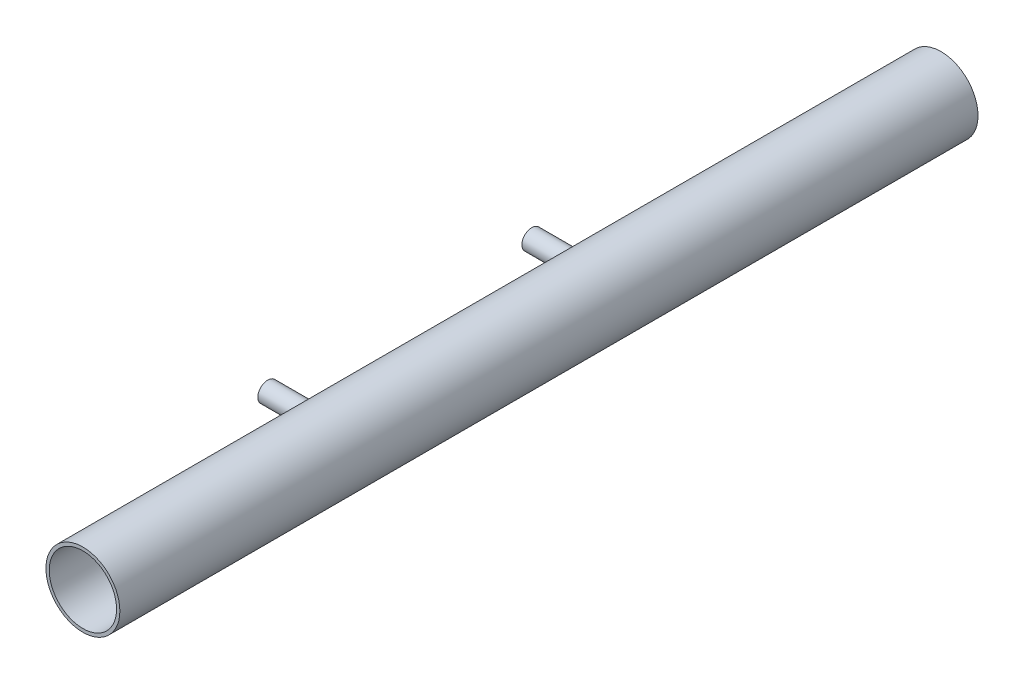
ISO-10303-21;
HEADER;
FILE_DESCRIPTION(('STEP AP214'),'2;1');
FILE_NAME('part.step','',(''),(''),'','','');
FILE_SCHEMA(('AUTOMOTIVE_DESIGN { 1 0 10303 214 1 1 1 1 }'));
ENDSEC;
DATA;
#1=APPLICATION_CONTEXT('core data for automotive mechanical design processes');
#2=APPLICATION_PROTOCOL_DEFINITION('international standard','automotive_design',2000,#1);
#3=PRODUCT_CONTEXT('',#1,'mechanical');
#4=PRODUCT('Part','Part','',(#3));
#5=PRODUCT_RELATED_PRODUCT_CATEGORY('part','',(#4));
#6=PRODUCT_DEFINITION_FORMATION('','',#4);
#7=PRODUCT_DEFINITION_CONTEXT('part definition',#1,'design');
#8=PRODUCT_DEFINITION('design','',#6,#7);
#9=PRODUCT_DEFINITION_SHAPE('','',#8);
#10=(LENGTH_UNIT() NAMED_UNIT(*) SI_UNIT(.MILLI.,.METRE.));
#11=(NAMED_UNIT(*) PLANE_ANGLE_UNIT() SI_UNIT($,.RADIAN.));
#12=(NAMED_UNIT(*) SI_UNIT($,.STERADIAN.) SOLID_ANGLE_UNIT());
#13=UNCERTAINTY_MEASURE_WITH_UNIT(LENGTH_MEASURE(1.E-05),#10,'distance_accuracy_value','');
#14=(GEOMETRIC_REPRESENTATION_CONTEXT(3) GLOBAL_UNCERTAINTY_ASSIGNED_CONTEXT((#13)) GLOBAL_UNIT_ASSIGNED_CONTEXT((#10,
#11,#12)) REPRESENTATION_CONTEXT('',''));
#15=CARTESIAN_POINT('',(0.,0.,0.));
#16=DIRECTION('',(0.,0.,1.));
#17=DIRECTION('',(1.,0.,0.));
#18=AXIS2_PLACEMENT_3D('',#15,#16,#17);
#19=CARTESIAN_POINT('',(-56.001,0.,500.));
#20=DIRECTION('',(1.,0.,0.));
#21=DIRECTION('',(0.,0.,-1.));
#22=AXIS2_PLACEMENT_3D('',#19,#20,#21);
#23=CYLINDRICAL_SURFACE('',#22,12.25);
#24=CARTESIAN_POINT('',(-112.,0.,500.));
#25=DIRECTION('',(-1.,0.,0.));
#26=DIRECTION('',(0.,0.,1.));
#27=AXIS2_PLACEMENT_3D('',#24,#25,#26);
#28=CIRCLE('',#27,12.25);
#29=CARTESIAN_POINT('',(-112.,-6.03548966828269,489.340011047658));
#30=VERTEX_POINT('',#29);
#31=CARTESIAN_POINT('',(-112.,-0.23251992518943,487.752206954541));
#32=VERTEX_POINT('',#31);
#33=EDGE_CURVE('E685',#30,#32,#28,.F.);
#34=ORIENTED_EDGE('',*,*,#33,.F.);
#35=DIRECTION('',(-1.,0.,0.));
#36=VECTOR('',#35,1.);
#37=CARTESIAN_POINT('',(-115.,-6.03548966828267,489.340011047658));
#38=LINE('',#37,#36);
#39=CARTESIAN_POINT('',(-110.,-6.03548966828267,489.340011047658));
#40=VERTEX_POINT('',#39);
#41=EDGE_CURVE('E457',#30,#40,#38,.F.);
#42=ORIENTED_EDGE('',*,*,#41,.T.);
#43=CARTESIAN_POINT('',(-110.,0.,500.));
#44=DIRECTION('',(-1.,0.,0.));
#45=DIRECTION('',(0.,0.,1.));
#46=AXIS2_PLACEMENT_3D('',#43,#44,#45);
#47=CIRCLE('',#46,12.25);
#48=CARTESIAN_POINT('',(-110.,-8.0508502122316,490.767107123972));
#49=VERTEX_POINT('',#48);
#50=EDGE_CURVE('E1170',#49,#40,#47,.F.);
#51=ORIENTED_EDGE('',*,*,#50,.F.);
#52=DIRECTION('',(-1.,0.,0.));
#53=VECTOR('',#52,1.);
#54=CARTESIAN_POINT('',(-115.,-8.0508502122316,490.767107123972));
#55=LINE('',#54,#53);
#56=CARTESIAN_POINT('',(-112.,-8.05085021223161,490.767107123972));
#57=VERTEX_POINT('',#56);
#58=EDGE_CURVE('E451',#49,#57,#55,.T.);
#59=ORIENTED_EDGE('',*,*,#58,.T.);
#60=CARTESIAN_POINT('',(-112.,-11.4755621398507,495.713512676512));
#61=VERTEX_POINT('',#60);
#62=EDGE_CURVE('E715',#61,#57,#28,.F.);
#63=ORIENTED_EDGE('',*,*,#62,.F.);
#64=DIRECTION('',(-1.,0.,0.));
#65=VECTOR('',#64,1.);
#66=CARTESIAN_POINT('',(-115.,-11.4755621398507,495.713512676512));
#67=LINE('',#66,#65);
#68=CARTESIAN_POINT('',(-110.,-11.4755621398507,495.713512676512));
#69=VERTEX_POINT('',#68);
#70=EDGE_CURVE('E477',#61,#69,#67,.F.);
#71=ORIENTED_EDGE('',*,*,#70,.T.);
#72=CARTESIAN_POINT('',(-110.,0.,500.));
#73=DIRECTION('',(-1.,0.,0.));
#74=DIRECTION('',(0.,0.,1.));
#75=AXIS2_PLACEMENT_3D('',#72,#73,#74);
#76=CIRCLE('',#75,12.25);
#77=CARTESIAN_POINT('',(-110.,-12.1020982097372,498.102180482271));
#78=VERTEX_POINT('',#77);
#79=EDGE_CURVE('E1165',#78,#69,#76,.F.);
#80=ORIENTED_EDGE('',*,*,#79,.F.);
#81=DIRECTION('',(-1.,0.,0.));
#82=VECTOR('',#81,1.);
#83=CARTESIAN_POINT('',(-115.,-12.1020982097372,498.102180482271));
#84=LINE('',#83,#82);
#85=CARTESIAN_POINT('',(-112.,-12.1020982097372,498.102180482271));
#86=VERTEX_POINT('',#85);
#87=EDGE_CURVE('E471',#78,#86,#84,.T.);
#88=ORIENTED_EDGE('',*,*,#87,.T.);
#89=CARTESIAN_POINT('',(-112.,-11.5460915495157,504.092709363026));
#90=VERTEX_POINT('',#89);
#91=EDGE_CURVE('E1108',#90,#86,#28,.F.);
#92=ORIENTED_EDGE('',*,*,#91,.F.);
#93=DIRECTION('',(-1.,0.,0.));
#94=VECTOR('',#93,1.);
#95=CARTESIAN_POINT('',(-115.,-11.5460915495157,504.092709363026));
#96=LINE('',#95,#94);
#97=CARTESIAN_POINT('',(-110.,-11.5460915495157,504.092709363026));
#98=VERTEX_POINT('',#97);
#99=EDGE_CURVE('E497',#90,#98,#96,.F.);
#100=ORIENTED_EDGE('',*,*,#99,.T.);
#101=CARTESIAN_POINT('',(-110.,0.,500.));
#102=DIRECTION('',(-1.,0.,0.));
#103=DIRECTION('',(0.,0.,1.));
#104=AXIS2_PLACEMENT_3D('',#101,#102,#103);
#105=CIRCLE('',#104,12.25);
#106=CARTESIAN_POINT('',(-110.,-10.4906399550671,506.325264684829));
#107=VERTEX_POINT('',#106);
#108=EDGE_CURVE('E1160',#107,#98,#105,.F.);
#109=ORIENTED_EDGE('',*,*,#108,.F.);
#110=DIRECTION('',(-1.,0.,0.));
#111=VECTOR('',#110,1.);
#112=CARTESIAN_POINT('',(-115.,-10.490639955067,506.325264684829));
#113=LINE('',#112,#111);
#114=CARTESIAN_POINT('',(-112.,-10.490639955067,506.32526468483));
#115=VERTEX_POINT('',#114);
#116=EDGE_CURVE('E491',#107,#115,#113,.T.);
#117=ORIENTED_EDGE('',*,*,#116,.T.);
#118=CARTESIAN_POINT('',(-112.,-6.21407640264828,510.556881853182));
#119=VERTEX_POINT('',#118);
#120=EDGE_CURVE('E1109',#119,#115,#28,.F.);
#121=ORIENTED_EDGE('',*,*,#120,.F.);
#122=DIRECTION('',(-1.,0.,0.));
#123=VECTOR('',#122,1.);
#124=CARTESIAN_POINT('',(-115.,-6.21407640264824,510.556881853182));
#125=LINE('',#124,#123);
#126=CARTESIAN_POINT('',(-110.,-6.21407640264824,510.556881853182));
#127=VERTEX_POINT('',#126);
#128=EDGE_CURVE('E517',#119,#127,#125,.F.);
#129=ORIENTED_EDGE('',*,*,#128,.T.);
#130=CARTESIAN_POINT('',(-110.,0.,500.));
#131=DIRECTION('',(-1.,0.,0.));
#132=DIRECTION('',(0.,0.,1.));
#133=AXIS2_PLACEMENT_3D('',#130,#131,#132);
#134=CIRCLE('',#133,12.25);
#135=CARTESIAN_POINT('',(-110.,-3.97049467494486,511.58868724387));
#136=VERTEX_POINT('',#135);
#137=EDGE_CURVE('E1153',#136,#127,#134,.F.);
#138=ORIENTED_EDGE('',*,*,#137,.F.);
#139=DIRECTION('',(-1.,0.,0.));
#140=VECTOR('',#139,1.);
#141=CARTESIAN_POINT('',(-115.,-3.97049467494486,511.58868724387));
#142=LINE('',#141,#140);
#143=CARTESIAN_POINT('',(-112.,-3.97049467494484,511.58868724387));
#144=VERTEX_POINT('',#143);
#145=EDGE_CURVE('E511',#136,#144,#142,.T.);
#146=ORIENTED_EDGE('',*,*,#145,.T.);
#147=CARTESIAN_POINT('',(-112.,2.02557415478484,512.081371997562));
#148=VERTEX_POINT('',#147);
#149=EDGE_CURVE('E1309',#148,#144,#28,.F.);
#150=ORIENTED_EDGE('',*,*,#149,.F.);
#151=DIRECTION('',(-1.,0.,0.));
#152=VECTOR('',#151,1.);
#153=CARTESIAN_POINT('',(-115.,2.02557415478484,512.081371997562));
#154=LINE('',#153,#152);
#155=CARTESIAN_POINT('',(-110.,2.02557415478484,512.081371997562));
#156=VERTEX_POINT('',#155);
#157=EDGE_CURVE('E537',#148,#156,#154,.F.);
#158=ORIENTED_EDGE('',*,*,#157,.T.);
#159=CARTESIAN_POINT('',(-110.,0.,500.));
#160=DIRECTION('',(-1.,0.,0.));
#161=DIRECTION('',(0.,0.,1.));
#162=AXIS2_PLACEMENT_3D('',#159,#160,#161);
#163=CIRCLE('',#162,12.25);
#164=CARTESIAN_POINT('',(-110.,4.40748919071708,511.429634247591));
#165=VERTEX_POINT('',#164);
#166=EDGE_CURVE('E1146',#165,#156,#163,.F.);
#167=ORIENTED_EDGE('',*,*,#166,.F.);
#168=DIRECTION('',(-1.,0.,0.));
#169=VECTOR('',#168,1.);
#170=CARTESIAN_POINT('',(-115.,4.40748919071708,511.429634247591));
#171=LINE('',#170,#169);
#172=CARTESIAN_POINT('',(-112.,4.40748919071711,511.429634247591));
#173=VERTEX_POINT('',#172);
#174=EDGE_CURVE('E531',#165,#173,#171,.T.);
#175=ORIENTED_EDGE('',*,*,#174,.T.);
#176=CARTESIAN_POINT('',(-112.,9.31743605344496,507.952853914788));
#177=VERTEX_POINT('',#176);
#178=EDGE_CURVE('E1311',#177,#173,#28,.F.);
#179=ORIENTED_EDGE('',*,*,#178,.F.);
#180=DIRECTION('',(-1.,0.,0.));
#181=VECTOR('',#180,1.);
#182=CARTESIAN_POINT('',(-115.,9.31743605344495,507.952853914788));
#183=LINE('',#182,#181);
#184=CARTESIAN_POINT('',(-110.,9.31743605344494,507.952853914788));
#185=VERTEX_POINT('',#184);
#186=EDGE_CURVE('E557',#177,#185,#183,.F.);
#187=ORIENTED_EDGE('',*,*,#186,.T.);
#188=CARTESIAN_POINT('',(-110.,0.,500.));
#189=DIRECTION('',(-1.,0.,0.));
#190=DIRECTION('',(0.,0.,1.));
#191=AXIS2_PLACEMENT_3D('',#188,#189,#190);
#192=CIRCLE('',#191,12.25);
#193=CARTESIAN_POINT('',(-110.,10.7231598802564,505.922528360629));
#194=VERTEX_POINT('',#193);
#195=EDGE_CURVE('E1139',#194,#185,#192,.F.);
#196=ORIENTED_EDGE('',*,*,#195,.F.);
#197=DIRECTION('',(-1.,0.,0.));
#198=VECTOR('',#197,1.);
#199=CARTESIAN_POINT('',(-115.,10.7231598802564,505.922528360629));
#200=LINE('',#199,#198);
#201=CARTESIAN_POINT('',(-112.,10.7231598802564,505.922528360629));
#202=VERTEX_POINT('',#201);
#203=EDGE_CURVE('E551',#194,#202,#200,.T.);
#204=ORIENTED_EDGE('',*,*,#203,.T.);
#205=CARTESIAN_POINT('',(-112.,12.2495660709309,500.10310709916));
#206=VERTEX_POINT('',#205);
#207=EDGE_CURVE('E1314',#206,#202,#28,.F.);
#208=ORIENTED_EDGE('',*,*,#207,.F.);
#209=DIRECTION('',(-1.,0.,0.));
#210=VECTOR('',#209,1.);
#211=CARTESIAN_POINT('',(-115.,12.2495660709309,500.10310709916));
#212=LINE('',#211,#210);
#213=CARTESIAN_POINT('',(-110.,12.249566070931,500.10310709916));
#214=VERTEX_POINT('',#213);
#215=EDGE_CURVE('E577',#206,#214,#212,.F.);
#216=ORIENTED_EDGE('',*,*,#215,.T.);
#217=CARTESIAN_POINT('',(-110.,0.,500.));
#218=DIRECTION('',(-1.,0.,0.));
#219=DIRECTION('',(0.,0.,1.));
#220=AXIS2_PLACEMENT_3D('',#217,#218,#219);
#221=CIRCLE('',#220,12.25);
#222=CARTESIAN_POINT('',(-110.,12.0213448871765,497.644205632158));
#223=VERTEX_POINT('',#222);
#224=EDGE_CURVE('E1132',#223,#214,#221,.F.);
#225=ORIENTED_EDGE('',*,*,#224,.F.);
#226=DIRECTION('',(-1.,0.,0.));
#227=VECTOR('',#226,1.);
#228=CARTESIAN_POINT('',(-115.,12.0213448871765,497.644205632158));
#229=LINE('',#228,#227);
#230=CARTESIAN_POINT('',(-112.,12.0213448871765,497.644205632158));
#231=VERTEX_POINT('',#230);
#232=EDGE_CURVE('E571',#223,#231,#229,.T.);
#233=ORIENTED_EDGE('',*,*,#232,.T.);
#234=CARTESIAN_POINT('',(-112.,9.4499879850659,492.205115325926));
#235=VERTEX_POINT('',#234);
#236=EDGE_CURVE('E1113',#235,#231,#28,.F.);
#237=ORIENTED_EDGE('',*,*,#236,.F.);
#238=DIRECTION('',(-1.,0.,0.));
#239=VECTOR('',#238,1.);
#240=CARTESIAN_POINT('',(-115.,9.4499879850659,492.205115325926));
#241=LINE('',#240,#239);
#242=CARTESIAN_POINT('',(-110.,9.4499879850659,492.205115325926));
#243=VERTEX_POINT('',#242);
#244=EDGE_CURVE('E597',#235,#243,#241,.F.);
#245=ORIENTED_EDGE('',*,*,#244,.T.);
#246=CARTESIAN_POINT('',(-110.,0.,500.));
#247=DIRECTION('',(-1.,0.,0.));
#248=DIRECTION('',(0.,0.,1.));
#249=AXIS2_PLACEMENT_3D('',#246,#247,#248);
#250=CIRCLE('',#249,12.25);
#251=CARTESIAN_POINT('',(-110.,7.69460901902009,490.468185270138));
#252=VERTEX_POINT('',#251);
#253=EDGE_CURVE('E1125',#252,#243,#250,.F.);
#254=ORIENTED_EDGE('',*,*,#253,.F.);
#255=DIRECTION('',(-1.,0.,0.));
#256=VECTOR('',#255,1.);
#257=CARTESIAN_POINT('',(-115.,7.6946090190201,490.468185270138));
#258=LINE('',#257,#256);
#259=CARTESIAN_POINT('',(-112.,7.69460901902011,490.468185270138));
#260=VERTEX_POINT('',#259);
#261=EDGE_CURVE('E591',#252,#260,#258,.T.);
#262=ORIENTED_EDGE('',*,*,#261,.T.);
#263=CARTESIAN_POINT('',(-112.,2.22865549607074,487.954436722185));
#264=VERTEX_POINT('',#263);
#265=EDGE_CURVE('E716',#264,#260,#28,.F.);
#266=ORIENTED_EDGE('',*,*,#265,.F.);
#267=DIRECTION('',(-1.,0.,0.));
#268=VECTOR('',#267,1.);
#269=CARTESIAN_POINT('',(-115.,2.22865549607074,487.954436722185));
#270=LINE('',#269,#268);
#271=CARTESIAN_POINT('',(-110.,2.22865549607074,487.954436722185));
#272=VERTEX_POINT('',#271);
#273=EDGE_CURVE('E617',#264,#272,#270,.F.);
#274=ORIENTED_EDGE('',*,*,#273,.T.);
#275=CARTESIAN_POINT('',(-110.,0.,500.));
#276=DIRECTION('',(-1.,0.,0.));
#277=DIRECTION('',(0.,0.,1.));
#278=AXIS2_PLACEMENT_3D('',#275,#276,#277);
#279=CIRCLE('',#278,12.25);
#280=CARTESIAN_POINT('',(-110.,-0.232519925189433,487.752206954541));
#281=VERTEX_POINT('',#280);
#282=EDGE_CURVE('E1118',#281,#272,#279,.F.);
#283=ORIENTED_EDGE('',*,*,#282,.F.);
#284=DIRECTION('',(-1.,0.,0.));
#285=VECTOR('',#284,1.);
#286=CARTESIAN_POINT('',(-115.,-0.232519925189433,487.752206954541));
#287=LINE('',#286,#285);
#288=EDGE_CURVE('E611',#281,#32,#287,.T.);
#289=ORIENTED_EDGE('',*,*,#288,.T.);
#290=EDGE_LOOP('',(#34,#42,#51,#59,#63,#71,#80,#88,#92,#100,#109,#117,#121,#129,#138,#146,#150,
#158,#167,#175,#179,#187,#196,#204,#208,#216,#225,#233,#237,#245,#254,#262,#266,#274,#283,#289));
#291=FACE_BOUND('',#290,.T.);
#292=CARTESIAN_POINT('',(-51.,0.,487.75));
#293=CARTESIAN_POINT('',(-50.9999991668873,0.338865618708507,487.750001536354));
#294=CARTESIAN_POINT('',(-50.9966141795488,0.677762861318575,487.764072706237));
#295=CARTESIAN_POINT('',(-50.983165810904,1.35311702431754,487.820245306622));
#296=CARTESIAN_POINT('',(-50.9731015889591,1.68957363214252,487.862350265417));
#297=CARTESIAN_POINT('',(-50.9465673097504,2.35778250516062,487.974270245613));
#298=CARTESIAN_POINT('',(-50.9300937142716,2.68953206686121,488.044100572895));
#299=CARTESIAN_POINT('',(-50.8911967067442,3.34576552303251,488.210896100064));
#300=CARTESIAN_POINT('',(-50.8687734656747,3.6702496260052,488.307860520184));
#301=CARTESIAN_POINT('',(-50.8186208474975,4.30933920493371,488.528025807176));
#302=CARTESIAN_POINT('',(-50.7908976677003,4.6239557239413,488.651196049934));
#303=CARTESIAN_POINT('',(-50.7308790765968,5.24158261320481,488.922900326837));
#304=CARTESIAN_POINT('',(-50.6985836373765,5.54459291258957,489.071434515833));
#305=CARTESIAN_POINT('',(-50.6302883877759,6.13700347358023,489.392774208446));
#306=CARTESIAN_POINT('',(-50.5942886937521,6.42640416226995,489.565578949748));
#307=CARTESIAN_POINT('',(-50.519541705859,6.98975407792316,489.934257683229));
#308=CARTESIAN_POINT('',(-50.4807942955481,7.26370264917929,490.130132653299));
#309=CARTESIAN_POINT('',(-50.4009009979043,7.79895237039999,490.54717454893));
#310=CARTESIAN_POINT('',(-50.3597253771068,8.05995612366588,490.768717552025));
#311=CARTESIAN_POINT('',(-50.2767252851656,8.56246241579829,491.232804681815));
#312=CARTESIAN_POINT('',(-50.2349008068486,8.80396473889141,491.475349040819));
#313=CARTESIAN_POINT('',(-50.1517512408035,9.26590218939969,491.979866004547));
#314=CARTESIAN_POINT('',(-50.1104262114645,9.4863348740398,492.241840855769));
#315=CARTESIAN_POINT('',(-50.0294320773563,9.90461100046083,492.783473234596));
#316=CARTESIAN_POINT('',(-49.9897629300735,10.1024550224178,493.063130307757));
#317=CARTESIAN_POINT('',(-49.9126766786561,10.4767229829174,493.642229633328));
#318=CARTESIAN_POINT('',(-49.8752976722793,10.652817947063,493.941889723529));
#319=CARTESIAN_POINT('',(-49.8044942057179,10.9790819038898,494.555462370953));
#320=CARTESIAN_POINT('',(-49.7710697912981,11.1292505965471,494.869375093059));
#321=CARTESIAN_POINT('',(-49.7091864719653,11.402474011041,495.509222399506));
#322=CARTESIAN_POINT('',(-49.680727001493,11.5255318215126,495.835155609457));
#323=CARTESIAN_POINT('',(-49.6296446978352,11.7435479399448,496.496733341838));
#324=CARTESIAN_POINT('',(-49.6070217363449,11.8385068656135,496.832377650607));
#325=CARTESIAN_POINT('',(-49.5686801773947,11.9980229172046,497.504594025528));
#326=CARTESIAN_POINT('',(-49.5528411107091,12.06311210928,497.841032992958));
#327=CARTESIAN_POINT('',(-49.5279517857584,12.1648981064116,498.518428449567));
#328=CARTESIAN_POINT('',(-49.5189014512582,12.2015952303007,498.859384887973));
#329=CARTESIAN_POINT('',(-49.5078706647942,12.2462759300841,499.543243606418));
#330=CARTESIAN_POINT('',(-49.50588928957,12.2542632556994,499.886145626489));
#331=CARTESIAN_POINT('',(-49.5090556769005,12.241464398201,500.571376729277));
#332=CARTESIAN_POINT('',(-49.5142033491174,12.2206785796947,500.913705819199));
#333=CARTESIAN_POINT('',(-49.5312745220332,12.1512994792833,501.587642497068));
#334=CARTESIAN_POINT('',(-49.5430445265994,12.1033359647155,501.919319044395));
#335=CARTESIAN_POINT('',(-49.5728978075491,11.9804755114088,502.577349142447));
#336=CARTESIAN_POINT('',(-49.5909809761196,11.9055790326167,502.903702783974));
#337=CARTESIAN_POINT('',(-49.6329349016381,11.7294483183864,503.548853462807));
#338=CARTESIAN_POINT('',(-49.6568059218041,11.6282128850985,503.867650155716));
#339=CARTESIAN_POINT('',(-49.7096512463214,11.4001867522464,504.495531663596));
#340=CARTESIAN_POINT('',(-49.7386256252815,11.2733956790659,504.804616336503));
#341=CARTESIAN_POINT('',(-49.8011554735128,10.9938893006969,505.413897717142));
#342=CARTESIAN_POINT('',(-49.8347514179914,10.8409416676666,505.713983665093));
#343=CARTESIAN_POINT('',(-49.9053693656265,10.5110677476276,506.300245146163));
#344=CARTESIAN_POINT('',(-49.9423913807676,10.3341413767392,506.586420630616));
#345=CARTESIAN_POINT('',(-50.0188466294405,9.95750458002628,507.143076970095));
#346=CARTESIAN_POINT('',(-50.0582801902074,9.75779105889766,507.413555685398));
#347=CARTESIAN_POINT('',(-50.1384854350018,9.33692439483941,507.93707432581));
#348=CARTESIAN_POINT('',(-50.1792571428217,9.11577087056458,508.1901139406));
#349=CARTESIAN_POINT('',(-50.2621225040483,8.64737332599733,508.683557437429));
#350=CARTESIAN_POINT('',(-50.3042227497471,8.39959656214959,508.923454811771));
#351=CARTESIAN_POINT('',(-50.3875071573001,7.88461445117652,509.38158470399));
#352=CARTESIAN_POINT('',(-50.4286913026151,7.61740875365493,509.599816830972));
#353=CARTESIAN_POINT('',(-50.5089977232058,7.06533398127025,510.013114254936));
#354=CARTESIAN_POINT('',(-50.5481199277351,6.78046430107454,510.20817875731));
#355=CARTESIAN_POINT('',(-50.6232098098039,6.19497554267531,510.573735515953));
#356=CARTESIAN_POINT('',(-50.6591775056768,5.89435655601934,510.744227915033));
#357=CARTESIAN_POINT('',(-50.7270523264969,5.27848557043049,511.05984509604));
#358=CARTESIAN_POINT('',(-50.7589469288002,4.96319232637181,511.204892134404));
#359=CARTESIAN_POINT('',(-50.8176418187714,4.32102107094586,511.467853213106));
#360=CARTESIAN_POINT('',(-50.8444420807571,3.99414300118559,511.585767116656));
#361=CARTESIAN_POINT('',(-50.892175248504,3.3312030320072,511.793482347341));
#362=CARTESIAN_POINT('',(-50.9131089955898,2.99514245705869,511.883287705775));
#363=CARTESIAN_POINT('',(-50.9485070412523,2.31627716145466,512.034045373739));
#364=CARTESIAN_POINT('',(-50.9629714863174,1.97347259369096,512.094998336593));
#365=CARTESIAN_POINT('',(-50.9847476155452,1.29189670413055,512.186423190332));
#366=CARTESIAN_POINT('',(-50.9922209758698,0.953222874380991,512.217584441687));
#367=CARTESIAN_POINT('',(-51.000391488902,0.274377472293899,512.251641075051));
#368=CARTESIAN_POINT('',(-51.0010887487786,-0.0657940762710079,512.254536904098));
#369=CARTESIAN_POINT('',(-50.9956877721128,-0.74511858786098,512.232039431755));
#370=CARTESIAN_POINT('',(-50.9895900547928,-1.08427162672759,512.206648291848));
#371=CARTESIAN_POINT('',(-50.970770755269,-1.75911077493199,512.127795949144));
#372=CARTESIAN_POINT('',(-50.9580491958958,-2.09479689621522,512.074334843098));
#373=CARTESIAN_POINT('',(-50.9265526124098,-2.7557633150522,511.940703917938));
#374=CARTESIAN_POINT('',(-50.907862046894,-3.08112299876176,511.860906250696));
#375=CARTESIAN_POINT('',(-50.8648849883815,-3.72387229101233,511.675067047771));
#376=CARTESIAN_POINT('',(-50.8405985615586,-4.04126199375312,511.569025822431));
#377=CARTESIAN_POINT('',(-50.7870758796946,-4.66596418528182,511.331502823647));
#378=CARTESIAN_POINT('',(-50.757839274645,-4.97327595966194,511.200019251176));
#379=CARTESIAN_POINT('',(-50.6951901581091,-5.57579124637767,510.912583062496));
#380=CARTESIAN_POINT('',(-50.6617775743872,-5.87099454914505,510.756630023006));
#381=CARTESIAN_POINT('',(-50.5910682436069,-6.45220460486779,510.418562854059));
#382=CARTESIAN_POINT('',(-50.5537160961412,-6.73797645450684,510.236056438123));
#383=CARTESIAN_POINT('',(-50.4766063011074,-7.29320155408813,509.848167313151));
#384=CARTESIAN_POINT('',(-50.4368486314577,-7.56265465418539,509.642784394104));
#385=CARTESIAN_POINT('',(-50.3559894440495,-8.0835523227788,509.210496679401));
#386=CARTESIAN_POINT('',(-50.3148877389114,-8.33499436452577,508.983588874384));
#387=CARTESIAN_POINT('',(-50.2324509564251,-8.81821761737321,508.509761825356));
#388=CARTESIAN_POINT('',(-50.1911158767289,-9.04999863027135,508.262842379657));
#389=CARTESIAN_POINT('',(-50.1084079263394,-9.49738801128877,507.744796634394));
#390=CARTESIAN_POINT('',(-50.0670552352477,-9.71251363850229,507.473249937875));
#391=CARTESIAN_POINT('',(-49.9864587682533,-10.1191362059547,506.912703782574));
#392=CARTESIAN_POINT('',(-49.9472150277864,-10.3106327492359,506.62370403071));
#393=CARTESIAN_POINT('',(-49.871978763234,-10.6686082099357,506.030206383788));
#394=CARTESIAN_POINT('',(-49.8359861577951,-10.8350877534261,505.72570887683));
#395=CARTESIAN_POINT('',(-49.7683179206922,-11.1417775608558,505.103298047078));
#396=CARTESIAN_POINT('',(-49.7366422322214,-11.2819881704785,504.785384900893));
#397=CARTESIAN_POINT('',(-49.6787387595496,-11.5342784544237,504.140307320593));
#398=CARTESIAN_POINT('',(-49.6524795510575,-11.6465212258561,503.813209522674));
#399=CARTESIAN_POINT('',(-49.6059729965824,-11.8430423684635,503.15029549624));
#400=CARTESIAN_POINT('',(-49.5857256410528,-11.9273207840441,502.814479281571));
#401=CARTESIAN_POINT('',(-49.5518740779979,-12.0671852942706,502.136649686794));
#402=CARTESIAN_POINT('',(-49.5382687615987,-12.1227761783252,501.79463735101));
#403=CARTESIAN_POINT('',(-49.5181247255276,-12.2047989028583,501.106929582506));
#404=CARTESIAN_POINT('',(-49.5115858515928,-12.2312313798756,500.761234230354));
#405=CARTESIAN_POINT('',(-49.5058579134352,-12.2543936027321,500.077963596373));
#406=CARTESIAN_POINT('',(-49.506478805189,-12.251891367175,499.740415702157));
#407=CARTESIAN_POINT('',(-49.5145937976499,-12.2190542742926,499.066764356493));
#408=CARTESIAN_POINT('',(-49.522087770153,-12.1887199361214,498.73066087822));
#409=CARTESIAN_POINT('',(-49.5437234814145,-12.1004760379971,498.062321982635));
#410=CARTESIAN_POINT('',(-49.5578650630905,-12.0425671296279,497.730086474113));
#411=CARTESIAN_POINT('',(-49.592374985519,-11.8996528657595,497.071827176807));
#412=CARTESIAN_POINT('',(-49.6127433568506,-11.8146473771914,496.745803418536));
#413=CARTESIAN_POINT('',(-49.6589905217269,-11.6187231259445,496.10387143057));
#414=CARTESIAN_POINT('',(-49.6848406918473,-11.507938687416,495.787920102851));
#415=CARTESIAN_POINT('',(-49.7413742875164,-11.2610704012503,495.166516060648));
#416=CARTESIAN_POINT('',(-49.7720576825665,-11.1249867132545,494.861063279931));
#417=CARTESIAN_POINT('',(-49.8373962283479,-10.8285253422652,494.262663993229));
#418=CARTESIAN_POINT('',(-49.8720510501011,-10.668149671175,493.969716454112));
#419=CARTESIAN_POINT('',(-49.9443969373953,-10.3241515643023,493.398051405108));
#420=CARTESIAN_POINT('',(-49.982089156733,-10.1405202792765,493.119339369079));
#421=CARTESIAN_POINT('',(-50.0604033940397,-9.74665412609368,492.571560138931));
#422=CARTESIAN_POINT('',(-50.1010737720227,-9.53589040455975,492.302879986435));
#423=CARTESIAN_POINT('',(-50.1834067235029,-9.09266218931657,491.784011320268));
#424=CARTESIAN_POINT('',(-50.2250697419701,-8.86018782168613,491.533831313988));
#425=CARTESIAN_POINT('',(-50.308232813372,-8.37509799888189,491.053675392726));
#426=CARTESIAN_POINT('',(-50.3497328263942,-8.12247789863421,490.823704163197));
#427=CARTESIAN_POINT('',(-50.4314061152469,-7.59890987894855,490.385660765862));
#428=CARTESIAN_POINT('',(-50.4715799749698,-7.32797019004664,490.177578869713));
#429=CARTESIAN_POINT('',(-50.5501804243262,-6.76472109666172,489.781311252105));
#430=CARTESIAN_POINT('',(-50.5885662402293,-6.47212883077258,489.593519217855));
#431=CARTESIAN_POINT('',(-50.6617525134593,-5.87181512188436,489.24337496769));
#432=CARTESIAN_POINT('',(-50.6965543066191,-5.56409937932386,489.081013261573));
#433=CARTESIAN_POINT('',(-50.7615833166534,-4.93572490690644,488.78295976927));
#434=CARTESIAN_POINT('',(-50.7918126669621,-4.61507230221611,488.647255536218));
#435=CARTESIAN_POINT('',(-50.8468450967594,-3.96299554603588,488.403523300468));
#436=CARTESIAN_POINT('',(-50.8716490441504,-3.63157312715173,488.295490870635));
#437=CARTESIAN_POINT('',(-50.9107091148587,-3.02847070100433,488.12700309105));
#438=CARTESIAN_POINT('',(-50.9260841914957,-2.75830368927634,488.061342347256));
#439=CARTESIAN_POINT('',(-50.9526516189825,-2.21393822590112,487.94851779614));
#440=CARTESIAN_POINT('',(-50.963844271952,-1.93974006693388,487.901352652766));
#441=CARTESIAN_POINT('',(-50.9818380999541,-1.38859971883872,487.825778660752));
#442=CARTESIAN_POINT('',(-50.9886388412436,-1.11165726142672,487.797371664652));
#443=CARTESIAN_POINT('',(-50.9977195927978,-0.556483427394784,487.759483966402));
#444=CARTESIAN_POINT('',(-51.000000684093,-0.278252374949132,487.749998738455));
#445=CARTESIAN_POINT('',(-51.,0.,487.75));
#446=B_SPLINE_CURVE_WITH_KNOTS('',3,(#292,#293,#294,#295,#296,#297,#298,#299,#300,#301,#302,
#303,#304,#305,#306,#307,#308,#309,#310,#311,#312,#313,#314,#315,#316,#317,#318,#319,#320,#321,
#322,#323,#324,#325,#326,#327,#328,#329,#330,#331,#332,#333,#334,#335,#336,#337,#338,#339,#340,
#341,#342,#343,#344,#345,#346,#347,#348,#349,#350,#351,#352,#353,#354,#355,#356,#357,#358,#359,
#360,#361,#362,#363,#364,#365,#366,#367,#368,#369,#370,#371,#372,#373,#374,#375,#376,#377,#378,
#379,#380,#381,#382,#383,#384,#385,#386,#387,#388,#389,#390,#391,#392,#393,#394,#395,#396,#397,
#398,#399,#400,#401,#402,#403,#404,#405,#406,#407,#408,#409,#410,#411,#412,#413,#414,#415,#416,
#417,#418,#419,#420,#421,#422,#423,#424,#425,#426,#427,#428,#429,#430,#431,#432,#433,#434,#435,
#436,#437,#438,#439,#440,#441,#442,#443,#444,#445),.UNSPECIFIED.,.T.,.F.,(4,2,2,2,2,2,2,2,2,2,2,
2,2,2,2,2,2,2,2,2,2,2,2,2,2,2,2,2,2,2,2,2,2,2,2,2,2,2,2,2,2,2,2,2,2,2,2,2,2,2,2,2,2,2,2,2,2,2,2,
2,2,2,2,2,2,2,2,2,2,2,2,2,2,2,2,2,4),(0.,1.0163437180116,2.03281537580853,3.04984896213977,
4.06685332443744,5.08267568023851,6.09850423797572,7.11430089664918,8.13014062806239,
9.16339827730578,10.1966673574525,11.230056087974,12.2634182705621,13.3108753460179,
14.3583445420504,15.4056943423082,16.4530211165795,17.4808892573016,18.5087458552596,
19.5364682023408,20.5641775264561,21.5689930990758,22.5737915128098,23.5786356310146,
24.5834944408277,25.5977922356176,26.6120935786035,27.6265328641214,28.6409901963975,
29.6820950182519,30.7232186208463,31.7643779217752,32.8055311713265,33.8498120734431,
34.8940982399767,35.9382345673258,36.9823472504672,38.0016692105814,39.0209750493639,
40.040203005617,41.0594274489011,42.064825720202,43.0702121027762,44.0756696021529,
45.0811444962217,46.1033575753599,47.1255800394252,48.1479456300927,49.1703215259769,
50.21575916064,51.2612143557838,52.3066433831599,53.352058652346,54.3912267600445,
55.4303932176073,56.4693861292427,57.5083563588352,58.5198137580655,59.5312522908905,
60.5426669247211,61.5540865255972,62.5603495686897,63.5666062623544,64.5727796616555,
65.5793370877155,66.6098339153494,67.6408017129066,68.6720079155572,69.7027538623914,
70.7508432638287,71.7985405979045,72.8457475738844,73.8927869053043,74.7275137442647,
75.5621802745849,76.3969292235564,77.2314784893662),.UNSPECIFIED.);
#447=CARTESIAN_POINT('',(-51.,0.,487.75));
#448=VERTEX_POINT('',#447);
#449=EDGE_CURVE('E628',#448,#448,#446,.T.);
#450=ORIENTED_EDGE('',*,*,#449,.T.);
#451=EDGE_LOOP('',(#450));
#452=FACE_BOUND('',#451,.T.);
#453=ADVANCED_FACE('F31',(#291,#452),#23,.F.);
#454=CARTESIAN_POINT('',(-56.001,0.,900.));
#455=DIRECTION('',(1.,0.,0.));
#456=DIRECTION('',(0.,0.,-1.));
#457=AXIS2_PLACEMENT_3D('',#454,#455,#456);
#458=CYLINDRICAL_SURFACE('',#457,12.25);
#459=CARTESIAN_POINT('',(-112.,0.,900.));
#460=DIRECTION('',(-1.,0.,0.));
#461=DIRECTION('',(0.,0.,1.));
#462=AXIS2_PLACEMENT_3D('',#459,#460,#461);
#463=CIRCLE('',#462,12.25);
#464=CARTESIAN_POINT('',(-112.,-6.03548966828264,889.340011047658));
#465=VERTEX_POINT('',#464);
#466=CARTESIAN_POINT('',(-112.,-0.232519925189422,887.752206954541));
#467=VERTEX_POINT('',#466);
#468=EDGE_CURVE('E278',#465,#467,#463,.F.);
#469=ORIENTED_EDGE('',*,*,#468,.F.);
#470=DIRECTION('',(-1.,0.,0.));
#471=VECTOR('',#470,1.);
#472=CARTESIAN_POINT('',(-115.,-6.03548966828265,889.340011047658));
#473=LINE('',#472,#471);
#474=CARTESIAN_POINT('',(-110.,-6.03548966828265,889.340011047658));
#475=VERTEX_POINT('',#474);
#476=EDGE_CURVE('E47',#465,#475,#473,.F.);
#477=ORIENTED_EDGE('',*,*,#476,.T.);
#478=CARTESIAN_POINT('',(-110.,0.,900.));
#479=DIRECTION('',(-1.,0.,0.));
#480=DIRECTION('',(0.,0.,1.));
#481=AXIS2_PLACEMENT_3D('',#478,#479,#480);
#482=CIRCLE('',#481,12.25);
#483=CARTESIAN_POINT('',(-110.,-8.05085021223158,890.767107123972));
#484=VERTEX_POINT('',#483);
#485=EDGE_CURVE('E11',#484,#475,#482,.F.);
#486=ORIENTED_EDGE('',*,*,#485,.F.);
#487=DIRECTION('',(-1.,0.,0.));
#488=VECTOR('',#487,1.);
#489=CARTESIAN_POINT('',(-115.,-8.05085021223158,890.767107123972));
#490=LINE('',#489,#488);
#491=CARTESIAN_POINT('',(-112.,-8.05085021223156,890.767107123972));
#492=VERTEX_POINT('',#491);
#493=EDGE_CURVE('E271',#484,#492,#490,.T.);
#494=ORIENTED_EDGE('',*,*,#493,.T.);
#495=CARTESIAN_POINT('',(-112.,-11.4755621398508,895.713512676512));
#496=VERTEX_POINT('',#495);
#497=EDGE_CURVE('E703',#496,#492,#463,.F.);
#498=ORIENTED_EDGE('',*,*,#497,.F.);
#499=DIRECTION('',(-1.,0.,0.));
#500=VECTOR('',#499,1.);
#501=CARTESIAN_POINT('',(-115.,-11.4755621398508,895.713512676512));
#502=LINE('',#501,#500);
#503=CARTESIAN_POINT('',(-110.,-11.4755621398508,895.713512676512));
#504=VERTEX_POINT('',#503);
#505=EDGE_CURVE('E55',#496,#504,#502,.F.);
#506=ORIENTED_EDGE('',*,*,#505,.T.);
#507=CARTESIAN_POINT('',(-110.,0.,900.));
#508=DIRECTION('',(-1.,0.,0.));
#509=DIRECTION('',(0.,0.,1.));
#510=AXIS2_PLACEMENT_3D('',#507,#508,#509);
#511=CIRCLE('',#510,12.25);
#512=CARTESIAN_POINT('',(-110.,-12.1020982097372,898.102180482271));
#513=VERTEX_POINT('',#512);
#514=EDGE_CURVE('E743',#513,#504,#511,.F.);
#515=ORIENTED_EDGE('',*,*,#514,.F.);
#516=DIRECTION('',(-1.,0.,0.));
#517=VECTOR('',#516,1.);
#518=CARTESIAN_POINT('',(-115.,-12.1020982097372,898.102180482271));
#519=LINE('',#518,#517);
#520=CARTESIAN_POINT('',(-112.,-12.1020982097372,898.102180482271));
#521=VERTEX_POINT('',#520);
#522=EDGE_CURVE('E294',#513,#521,#519,.T.);
#523=ORIENTED_EDGE('',*,*,#522,.T.);
#524=CARTESIAN_POINT('',(-112.,-11.5460915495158,904.092709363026));
#525=VERTEX_POINT('',#524);
#526=EDGE_CURVE('E710',#525,#521,#463,.F.);
#527=ORIENTED_EDGE('',*,*,#526,.F.);
#528=DIRECTION('',(-1.,0.,0.));
#529=VECTOR('',#528,1.);
#530=CARTESIAN_POINT('',(-115.,-11.5460915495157,904.092709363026));
#531=LINE('',#530,#529);
#532=CARTESIAN_POINT('',(-110.,-11.5460915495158,904.092709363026));
#533=VERTEX_POINT('',#532);
#534=EDGE_CURVE('E318',#525,#533,#531,.F.);
#535=ORIENTED_EDGE('',*,*,#534,.T.);
#536=CARTESIAN_POINT('',(-110.,0.,900.));
#537=DIRECTION('',(-1.,0.,0.));
#538=DIRECTION('',(0.,0.,1.));
#539=AXIS2_PLACEMENT_3D('',#536,#537,#538);
#540=CIRCLE('',#539,12.25);
#541=CARTESIAN_POINT('',(-110.,-10.4906399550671,906.325264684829));
#542=VERTEX_POINT('',#541);
#543=EDGE_CURVE('E748',#542,#533,#540,.F.);
#544=ORIENTED_EDGE('',*,*,#543,.F.);
#545=DIRECTION('',(-1.,0.,0.));
#546=VECTOR('',#545,1.);
#547=CARTESIAN_POINT('',(-115.,-10.4906399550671,906.325264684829));
#548=LINE('',#547,#546);
#549=CARTESIAN_POINT('',(-112.,-10.4906399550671,906.325264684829));
#550=VERTEX_POINT('',#549);
#551=EDGE_CURVE('E312',#542,#550,#548,.T.);
#552=ORIENTED_EDGE('',*,*,#551,.T.);
#553=CARTESIAN_POINT('',(-112.,-6.21407640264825,910.556881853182));
#554=VERTEX_POINT('',#553);
#555=EDGE_CURVE('E730',#554,#550,#463,.F.);
#556=ORIENTED_EDGE('',*,*,#555,.F.);
#557=DIRECTION('',(-1.,0.,0.));
#558=VECTOR('',#557,1.);
#559=CARTESIAN_POINT('',(-115.,-6.21407640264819,910.556881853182));
#560=LINE('',#559,#558);
#561=CARTESIAN_POINT('',(-110.,-6.21407640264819,910.556881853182));
#562=VERTEX_POINT('',#561);
#563=EDGE_CURVE('E338',#554,#562,#560,.F.);
#564=ORIENTED_EDGE('',*,*,#563,.T.);
#565=CARTESIAN_POINT('',(-110.,0.,900.));
#566=DIRECTION('',(-1.,0.,0.));
#567=DIRECTION('',(0.,0.,1.));
#568=AXIS2_PLACEMENT_3D('',#565,#566,#567);
#569=CIRCLE('',#568,12.25);
#570=CARTESIAN_POINT('',(-110.,-3.97049467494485,911.58868724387));
#571=VERTEX_POINT('',#570);
#572=EDGE_CURVE('E1218',#571,#562,#569,.F.);
#573=ORIENTED_EDGE('',*,*,#572,.F.);
#574=DIRECTION('',(-1.,0.,0.));
#575=VECTOR('',#574,1.);
#576=CARTESIAN_POINT('',(-115.,-3.97049467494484,911.58868724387));
#577=LINE('',#576,#575);
#578=CARTESIAN_POINT('',(-112.,-3.97049467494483,911.58868724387));
#579=VERTEX_POINT('',#578);
#580=EDGE_CURVE('E332',#571,#579,#577,.T.);
#581=ORIENTED_EDGE('',*,*,#580,.T.);
#582=CARTESIAN_POINT('',(-112.,2.02557415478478,912.081371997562));
#583=VERTEX_POINT('',#582);
#584=EDGE_CURVE('E726',#583,#579,#463,.F.);
#585=ORIENTED_EDGE('',*,*,#584,.F.);
#586=DIRECTION('',(-1.,0.,0.));
#587=VECTOR('',#586,1.);
#588=CARTESIAN_POINT('',(-115.,2.02557415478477,912.081371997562));
#589=LINE('',#588,#587);
#590=CARTESIAN_POINT('',(-110.,2.02557415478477,912.081371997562));
#591=VERTEX_POINT('',#590);
#592=EDGE_CURVE('E358',#583,#591,#589,.F.);
#593=ORIENTED_EDGE('',*,*,#592,.T.);
#594=CARTESIAN_POINT('',(-110.,0.,900.));
#595=DIRECTION('',(-1.,0.,0.));
#596=DIRECTION('',(0.,0.,1.));
#597=AXIS2_PLACEMENT_3D('',#594,#595,#596);
#598=CIRCLE('',#597,12.25);
#599=CARTESIAN_POINT('',(-110.,4.40748919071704,911.429634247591));
#600=VERTEX_POINT('',#599);
#601=EDGE_CURVE('E1210',#600,#591,#598,.F.);
#602=ORIENTED_EDGE('',*,*,#601,.F.);
#603=DIRECTION('',(-1.,0.,0.));
#604=VECTOR('',#603,1.);
#605=CARTESIAN_POINT('',(-115.,4.40748919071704,911.429634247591));
#606=LINE('',#605,#604);
#607=CARTESIAN_POINT('',(-112.,4.40748919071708,911.429634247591));
#608=VERTEX_POINT('',#607);
#609=EDGE_CURVE('E352',#600,#608,#606,.T.);
#610=ORIENTED_EDGE('',*,*,#609,.T.);
#611=CARTESIAN_POINT('',(-112.,9.31743605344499,907.952853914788));
#612=VERTEX_POINT('',#611);
#613=EDGE_CURVE('E722',#612,#608,#463,.F.);
#614=ORIENTED_EDGE('',*,*,#613,.F.);
#615=DIRECTION('',(-1.,0.,0.));
#616=VECTOR('',#615,1.);
#617=CARTESIAN_POINT('',(-115.,9.317436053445,907.952853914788));
#618=LINE('',#617,#616);
#619=CARTESIAN_POINT('',(-110.,9.31743605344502,907.952853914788));
#620=VERTEX_POINT('',#619);
#621=EDGE_CURVE('E378',#612,#620,#618,.F.);
#622=ORIENTED_EDGE('',*,*,#621,.T.);
#623=CARTESIAN_POINT('',(-110.,0.,900.));
#624=DIRECTION('',(-1.,0.,0.));
#625=DIRECTION('',(0.,0.,1.));
#626=AXIS2_PLACEMENT_3D('',#623,#624,#625);
#627=CIRCLE('',#626,12.25);
#628=CARTESIAN_POINT('',(-110.,10.7231598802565,905.922528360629));
#629=VERTEX_POINT('',#628);
#630=EDGE_CURVE('E1202',#629,#620,#627,.F.);
#631=ORIENTED_EDGE('',*,*,#630,.F.);
#632=DIRECTION('',(-1.,0.,0.));
#633=VECTOR('',#632,1.);
#634=CARTESIAN_POINT('',(-115.,10.7231598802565,905.922528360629));
#635=LINE('',#634,#633);
#636=CARTESIAN_POINT('',(-112.,10.7231598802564,905.922528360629));
#637=VERTEX_POINT('',#636);
#638=EDGE_CURVE('E372',#629,#637,#635,.T.);
#639=ORIENTED_EDGE('',*,*,#638,.T.);
#640=CARTESIAN_POINT('',(-112.,12.2495660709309,900.10310709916));
#641=VERTEX_POINT('',#640);
#642=EDGE_CURVE('E718',#641,#637,#463,.F.);
#643=ORIENTED_EDGE('',*,*,#642,.F.);
#644=DIRECTION('',(-1.,0.,0.));
#645=VECTOR('',#644,1.);
#646=CARTESIAN_POINT('',(-115.,12.2495660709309,900.10310709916));
#647=LINE('',#646,#645);
#648=CARTESIAN_POINT('',(-110.,12.2495660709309,900.10310709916));
#649=VERTEX_POINT('',#648);
#650=EDGE_CURVE('E398',#641,#649,#647,.F.);
#651=ORIENTED_EDGE('',*,*,#650,.T.);
#652=CARTESIAN_POINT('',(-110.,0.,900.));
#653=DIRECTION('',(-1.,0.,0.));
#654=DIRECTION('',(0.,0.,1.));
#655=AXIS2_PLACEMENT_3D('',#652,#653,#654);
#656=CIRCLE('',#655,12.25);
#657=CARTESIAN_POINT('',(-110.,12.0213448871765,897.644205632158));
#658=VERTEX_POINT('',#657);
#659=EDGE_CURVE('E1194',#658,#649,#656,.F.);
#660=ORIENTED_EDGE('',*,*,#659,.F.);
#661=DIRECTION('',(-1.,0.,0.));
#662=VECTOR('',#661,1.);
#663=CARTESIAN_POINT('',(-115.,12.0213448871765,897.644205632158));
#664=LINE('',#663,#662);
#665=CARTESIAN_POINT('',(-112.,12.0213448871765,897.644205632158));
#666=VERTEX_POINT('',#665);
#667=EDGE_CURVE('E392',#658,#666,#664,.T.);
#668=ORIENTED_EDGE('',*,*,#667,.T.);
#669=CARTESIAN_POINT('',(-112.,9.44998798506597,892.205115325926));
#670=VERTEX_POINT('',#669);
#671=EDGE_CURVE('E712',#670,#666,#463,.F.);
#672=ORIENTED_EDGE('',*,*,#671,.F.);
#673=DIRECTION('',(-1.,0.,0.));
#674=VECTOR('',#673,1.);
#675=CARTESIAN_POINT('',(-115.,9.44998798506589,892.205115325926));
#676=LINE('',#675,#674);
#677=CARTESIAN_POINT('',(-110.,9.44998798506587,892.205115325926));
#678=VERTEX_POINT('',#677);
#679=EDGE_CURVE('E418',#670,#678,#676,.F.);
#680=ORIENTED_EDGE('',*,*,#679,.T.);
#681=CARTESIAN_POINT('',(-110.,0.,900.));
#682=DIRECTION('',(-1.,0.,0.));
#683=DIRECTION('',(0.,0.,1.));
#684=AXIS2_PLACEMENT_3D('',#681,#682,#683);
#685=CIRCLE('',#684,12.25);
#686=CARTESIAN_POINT('',(-110.,7.69460901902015,890.468185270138));
#687=VERTEX_POINT('',#686);
#688=EDGE_CURVE('E1186',#687,#678,#685,.F.);
#689=ORIENTED_EDGE('',*,*,#688,.F.);
#690=DIRECTION('',(-1.,0.,0.));
#691=VECTOR('',#690,1.);
#692=CARTESIAN_POINT('',(-115.,7.69460901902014,890.468185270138));
#693=LINE('',#692,#691);
#694=CARTESIAN_POINT('',(-112.,7.69460901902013,890.468185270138));
#695=VERTEX_POINT('',#694);
#696=EDGE_CURVE('E412',#687,#695,#693,.T.);
#697=ORIENTED_EDGE('',*,*,#696,.T.);
#698=CARTESIAN_POINT('',(-112.,2.22865549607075,887.954436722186));
#699=VERTEX_POINT('',#698);
#700=EDGE_CURVE('E657',#699,#695,#463,.F.);
#701=ORIENTED_EDGE('',*,*,#700,.F.);
#702=DIRECTION('',(-1.,0.,0.));
#703=VECTOR('',#702,1.);
#704=CARTESIAN_POINT('',(-115.,2.22865549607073,887.954436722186));
#705=LINE('',#704,#703);
#706=CARTESIAN_POINT('',(-110.,2.22865549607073,887.954436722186));
#707=VERTEX_POINT('',#706);
#708=EDGE_CURVE('E437',#699,#707,#705,.F.);
#709=ORIENTED_EDGE('',*,*,#708,.T.);
#710=CARTESIAN_POINT('',(-110.,0.,900.));
#711=DIRECTION('',(-1.,0.,0.));
#712=DIRECTION('',(0.,0.,1.));
#713=AXIS2_PLACEMENT_3D('',#710,#711,#712);
#714=CIRCLE('',#713,12.25);
#715=CARTESIAN_POINT('',(-110.,-0.232519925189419,887.752206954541));
#716=VERTEX_POINT('',#715);
#717=EDGE_CURVE('E1178',#716,#707,#714,.F.);
#718=ORIENTED_EDGE('',*,*,#717,.F.);
#719=DIRECTION('',(-1.,0.,0.));
#720=VECTOR('',#719,1.);
#721=CARTESIAN_POINT('',(-115.,-0.232519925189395,887.752206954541));
#722=LINE('',#721,#720);
#723=EDGE_CURVE('E432',#716,#467,#722,.T.);
#724=ORIENTED_EDGE('',*,*,#723,.T.);
#725=EDGE_LOOP('',(#469,#477,#486,#494,#498,#506,#515,#523,#527,#535,#544,#552,#556,#564,#573,
#581,#585,#593,#602,#610,#614,#622,#631,#639,#643,#651,#660,#668,#672,#680,#689,#697,#701,#709,
#718,#724));
#726=FACE_BOUND('',#725,.T.);
#727=CARTESIAN_POINT('',(-51.,0.,887.75));
#728=CARTESIAN_POINT('',(-50.9999991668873,0.338865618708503,887.750001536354));
#729=CARTESIAN_POINT('',(-50.9966141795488,0.67776286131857,887.764072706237));
#730=CARTESIAN_POINT('',(-50.983165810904,1.35311702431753,887.820245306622));
#731=CARTESIAN_POINT('',(-50.9731015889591,1.68957363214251,887.862350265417));
#732=CARTESIAN_POINT('',(-50.9465673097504,2.35778250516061,887.974270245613));
#733=CARTESIAN_POINT('',(-50.9300937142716,2.6895320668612,888.044100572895));
#734=CARTESIAN_POINT('',(-50.8911967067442,3.34576552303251,888.210896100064));
#735=CARTESIAN_POINT('',(-50.8687734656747,3.67024962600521,888.307860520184));
#736=CARTESIAN_POINT('',(-50.8186208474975,4.30933920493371,888.528025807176));
#737=CARTESIAN_POINT('',(-50.7908976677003,4.62395572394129,888.651196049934));
#738=CARTESIAN_POINT('',(-50.7308790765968,5.24158261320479,888.922900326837));
#739=CARTESIAN_POINT('',(-50.6985836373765,5.54459291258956,889.071434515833));
#740=CARTESIAN_POINT('',(-50.6302883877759,6.13700347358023,889.392774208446));
#741=CARTESIAN_POINT('',(-50.5942886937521,6.42640416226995,889.565578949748));
#742=CARTESIAN_POINT('',(-50.519541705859,6.98975407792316,889.934257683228));
#743=CARTESIAN_POINT('',(-50.4807942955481,7.26370264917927,890.130132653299));
#744=CARTESIAN_POINT('',(-50.4009009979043,7.79895237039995,890.54717454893));
#745=CARTESIAN_POINT('',(-50.3597253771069,8.05995612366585,890.768717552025));
#746=CARTESIAN_POINT('',(-50.2767252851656,8.56246241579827,891.232804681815));
#747=CARTESIAN_POINT('',(-50.2349008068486,8.80396473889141,891.475349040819));
#748=CARTESIAN_POINT('',(-50.1517512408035,9.2659021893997,891.979866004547));
#749=CARTESIAN_POINT('',(-50.1104262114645,9.48633487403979,892.241840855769));
#750=CARTESIAN_POINT('',(-50.0294320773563,9.90461100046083,892.783473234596));
#751=CARTESIAN_POINT('',(-49.9897629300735,10.1024550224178,893.063130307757));
#752=CARTESIAN_POINT('',(-49.9126766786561,10.4767229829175,893.642229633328));
#753=CARTESIAN_POINT('',(-49.8752976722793,10.6528179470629,893.941889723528));
#754=CARTESIAN_POINT('',(-49.8044942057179,10.9790819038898,894.555462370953));
#755=CARTESIAN_POINT('',(-49.7710697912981,11.129250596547,894.869375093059));
#756=CARTESIAN_POINT('',(-49.7091864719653,11.402474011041,895.509222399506));
#757=CARTESIAN_POINT('',(-49.680727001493,11.5255318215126,895.835155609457));
#758=CARTESIAN_POINT('',(-49.6296446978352,11.7435479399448,896.496733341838));
#759=CARTESIAN_POINT('',(-49.6070217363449,11.8385068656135,896.832377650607));
#760=CARTESIAN_POINT('',(-49.5686801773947,11.9980229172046,897.504594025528));
#761=CARTESIAN_POINT('',(-49.5528411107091,12.06311210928,897.841032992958));
#762=CARTESIAN_POINT('',(-49.5279517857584,12.1648981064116,898.518428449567));
#763=CARTESIAN_POINT('',(-49.5189014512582,12.2015952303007,898.859384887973));
#764=CARTESIAN_POINT('',(-49.5078706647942,12.2462759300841,899.543243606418));
#765=CARTESIAN_POINT('',(-49.50588928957,12.2542632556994,899.886145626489));
#766=CARTESIAN_POINT('',(-49.5090556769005,12.2414643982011,900.571376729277));
#767=CARTESIAN_POINT('',(-49.5142033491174,12.2206785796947,900.913705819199));
#768=CARTESIAN_POINT('',(-49.5312745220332,12.1512994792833,901.587642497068));
#769=CARTESIAN_POINT('',(-49.5430445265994,12.1033359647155,901.919319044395));
#770=CARTESIAN_POINT('',(-49.5728978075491,11.9804755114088,902.577349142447));
#771=CARTESIAN_POINT('',(-49.5909809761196,11.9055790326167,902.903702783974));
#772=CARTESIAN_POINT('',(-49.6329349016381,11.7294483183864,903.548853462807));
#773=CARTESIAN_POINT('',(-49.6568059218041,11.6282128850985,903.867650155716));
#774=CARTESIAN_POINT('',(-49.7096512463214,11.4001867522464,904.495531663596));
#775=CARTESIAN_POINT('',(-49.7386256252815,11.2733956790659,904.804616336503));
#776=CARTESIAN_POINT('',(-49.8011554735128,10.993889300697,905.413897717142));
#777=CARTESIAN_POINT('',(-49.8347514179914,10.8409416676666,905.713983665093));
#778=CARTESIAN_POINT('',(-49.9053693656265,10.5110677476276,906.300245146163));
#779=CARTESIAN_POINT('',(-49.9423913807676,10.3341413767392,906.586420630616));
#780=CARTESIAN_POINT('',(-50.0188466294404,9.95750458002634,907.143076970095));
#781=CARTESIAN_POINT('',(-50.0582801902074,9.75779105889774,907.413555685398));
#782=CARTESIAN_POINT('',(-50.1384854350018,9.33692439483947,907.93707432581));
#783=CARTESIAN_POINT('',(-50.1792571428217,9.11577087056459,908.1901139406));
#784=CARTESIAN_POINT('',(-50.2621225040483,8.6473733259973,908.683557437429));
#785=CARTESIAN_POINT('',(-50.3042227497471,8.39959656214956,908.923454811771));
#786=CARTESIAN_POINT('',(-50.3875071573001,7.88461445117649,909.38158470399));
#787=CARTESIAN_POINT('',(-50.4286913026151,7.61740875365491,909.599816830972));
#788=CARTESIAN_POINT('',(-50.5089977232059,7.06533398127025,910.013114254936));
#789=CARTESIAN_POINT('',(-50.5481199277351,6.78046430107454,910.20817875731));
#790=CARTESIAN_POINT('',(-50.6232098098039,6.19497554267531,910.573735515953));
#791=CARTESIAN_POINT('',(-50.6591775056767,5.89435655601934,910.744227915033));
#792=CARTESIAN_POINT('',(-50.7270523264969,5.2784855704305,911.05984509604));
#793=CARTESIAN_POINT('',(-50.7589469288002,4.96319232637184,911.204892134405));
#794=CARTESIAN_POINT('',(-50.8176418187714,4.32102107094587,911.467853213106));
#795=CARTESIAN_POINT('',(-50.8444420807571,3.99414300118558,911.585767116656));
#796=CARTESIAN_POINT('',(-50.892175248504,3.33120303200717,911.793482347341));
#797=CARTESIAN_POINT('',(-50.9131089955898,2.99514245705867,911.883287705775));
#798=CARTESIAN_POINT('',(-50.9485070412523,2.31627716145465,912.034045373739));
#799=CARTESIAN_POINT('',(-50.9629714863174,1.97347259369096,912.094998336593));
#800=CARTESIAN_POINT('',(-50.9847476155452,1.29189670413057,912.186423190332));
#801=CARTESIAN_POINT('',(-50.9922209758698,0.95322287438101,912.217584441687));
#802=CARTESIAN_POINT('',(-51.000391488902,0.27437747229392,912.251641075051));
#803=CARTESIAN_POINT('',(-51.0010887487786,-0.0657940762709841,912.254536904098));
#804=CARTESIAN_POINT('',(-50.9956877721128,-0.745118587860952,912.232039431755));
#805=CARTESIAN_POINT('',(-50.9895900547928,-1.08427162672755,912.206648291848));
#806=CARTESIAN_POINT('',(-50.970770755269,-1.75911077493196,912.127795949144));
#807=CARTESIAN_POINT('',(-50.9580491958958,-2.09479689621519,912.074334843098));
#808=CARTESIAN_POINT('',(-50.9265526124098,-2.75576331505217,911.940703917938));
#809=CARTESIAN_POINT('',(-50.907862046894,-3.08112299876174,911.860906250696));
#810=CARTESIAN_POINT('',(-50.8648849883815,-3.72387229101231,911.675067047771));
#811=CARTESIAN_POINT('',(-50.8405985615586,-4.0412619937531,911.569025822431));
#812=CARTESIAN_POINT('',(-50.7870758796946,-4.66596418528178,911.331502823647));
#813=CARTESIAN_POINT('',(-50.757839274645,-4.9732759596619,911.200019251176));
#814=CARTESIAN_POINT('',(-50.6951901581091,-5.57579124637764,910.912583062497));
#815=CARTESIAN_POINT('',(-50.6617775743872,-5.87099454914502,910.756630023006));
#816=CARTESIAN_POINT('',(-50.5910682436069,-6.45220460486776,910.418562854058));
#817=CARTESIAN_POINT('',(-50.5537160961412,-6.7379764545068,910.236056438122));
#818=CARTESIAN_POINT('',(-50.4766063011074,-7.29320155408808,909.848167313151));
#819=CARTESIAN_POINT('',(-50.4368486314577,-7.56265465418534,909.642784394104));
#820=CARTESIAN_POINT('',(-50.3559894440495,-8.08355232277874,909.210496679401));
#821=CARTESIAN_POINT('',(-50.3148877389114,-8.33499436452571,908.983588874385));
#822=CARTESIAN_POINT('',(-50.2324509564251,-8.81821761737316,908.509761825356));
#823=CARTESIAN_POINT('',(-50.1911158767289,-9.04999863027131,908.262842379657));
#824=CARTESIAN_POINT('',(-50.1084079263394,-9.49738801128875,907.744796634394));
#825=CARTESIAN_POINT('',(-50.0670552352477,-9.71251363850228,907.473249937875));
#826=CARTESIAN_POINT('',(-49.9864587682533,-10.1191362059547,906.912703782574));
#827=CARTESIAN_POINT('',(-49.9472150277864,-10.3106327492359,906.62370403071));
#828=CARTESIAN_POINT('',(-49.871978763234,-10.6686082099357,906.030206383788));
#829=CARTESIAN_POINT('',(-49.8359861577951,-10.8350877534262,905.72570887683));
#830=CARTESIAN_POINT('',(-49.7683179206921,-11.1417775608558,905.103298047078));
#831=CARTESIAN_POINT('',(-49.7366422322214,-11.2819881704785,904.785384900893));
#832=CARTESIAN_POINT('',(-49.6787387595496,-11.5342784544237,904.140307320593));
#833=CARTESIAN_POINT('',(-49.6524795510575,-11.6465212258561,903.813209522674));
#834=CARTESIAN_POINT('',(-49.6059729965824,-11.8430423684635,903.15029549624));
#835=CARTESIAN_POINT('',(-49.5857256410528,-11.9273207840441,902.81447928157));
#836=CARTESIAN_POINT('',(-49.5518740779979,-12.0671852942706,902.136649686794));
#837=CARTESIAN_POINT('',(-49.5382687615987,-12.1227761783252,901.79463735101));
#838=CARTESIAN_POINT('',(-49.5181247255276,-12.2047989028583,901.106929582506));
#839=CARTESIAN_POINT('',(-49.5115858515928,-12.2312313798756,900.761234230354));
#840=CARTESIAN_POINT('',(-49.5058579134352,-12.2543936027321,900.077963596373));
#841=CARTESIAN_POINT('',(-49.506478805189,-12.251891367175,899.740415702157));
#842=CARTESIAN_POINT('',(-49.5145937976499,-12.2190542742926,899.066764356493));
#843=CARTESIAN_POINT('',(-49.522087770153,-12.1887199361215,898.73066087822));
#844=CARTESIAN_POINT('',(-49.5437234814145,-12.1004760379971,898.062321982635));
#845=CARTESIAN_POINT('',(-49.5578650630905,-12.0425671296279,897.730086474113));
#846=CARTESIAN_POINT('',(-49.592374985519,-11.8996528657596,897.071827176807));
#847=CARTESIAN_POINT('',(-49.6127433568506,-11.8146473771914,896.745803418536));
#848=CARTESIAN_POINT('',(-49.6589905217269,-11.6187231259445,896.10387143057));
#849=CARTESIAN_POINT('',(-49.6848406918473,-11.507938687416,895.787920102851));
#850=CARTESIAN_POINT('',(-49.7413742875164,-11.2610704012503,895.166516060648));
#851=CARTESIAN_POINT('',(-49.7720576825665,-11.1249867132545,894.861063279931));
#852=CARTESIAN_POINT('',(-49.8373962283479,-10.8285253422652,894.262663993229));
#853=CARTESIAN_POINT('',(-49.8720510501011,-10.668149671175,893.969716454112));
#854=CARTESIAN_POINT('',(-49.9443969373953,-10.3241515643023,893.398051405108));
#855=CARTESIAN_POINT('',(-49.982089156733,-10.1405202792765,893.119339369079));
#856=CARTESIAN_POINT('',(-50.0604033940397,-9.74665412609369,892.571560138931));
#857=CARTESIAN_POINT('',(-50.1010737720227,-9.53589040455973,892.302879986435));
#858=CARTESIAN_POINT('',(-50.1834067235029,-9.09266218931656,891.784011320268));
#859=CARTESIAN_POINT('',(-50.2250697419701,-8.86018782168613,891.533831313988));
#860=CARTESIAN_POINT('',(-50.308232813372,-8.37509799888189,891.053675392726));
#861=CARTESIAN_POINT('',(-50.3497328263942,-8.12247789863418,890.823704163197));
#862=CARTESIAN_POINT('',(-50.4314061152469,-7.59890987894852,890.385660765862));
#863=CARTESIAN_POINT('',(-50.4715799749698,-7.32797019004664,890.177578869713));
#864=CARTESIAN_POINT('',(-50.5501804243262,-6.76472109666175,889.781311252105));
#865=CARTESIAN_POINT('',(-50.5885662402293,-6.4721288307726,889.593519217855));
#866=CARTESIAN_POINT('',(-50.6617525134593,-5.87181512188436,889.24337496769));
#867=CARTESIAN_POINT('',(-50.6965543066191,-5.56409937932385,889.081013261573));
#868=CARTESIAN_POINT('',(-50.7615833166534,-4.93572490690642,888.78295976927));
#869=CARTESIAN_POINT('',(-50.7918126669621,-4.61507230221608,888.647255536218));
#870=CARTESIAN_POINT('',(-50.8468450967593,-3.96299554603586,888.403523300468));
#871=CARTESIAN_POINT('',(-50.8716490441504,-3.63157312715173,888.295490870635));
#872=CARTESIAN_POINT('',(-50.9107091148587,-3.02847070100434,888.12700309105));
#873=CARTESIAN_POINT('',(-50.9260841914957,-2.75830368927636,888.061342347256));
#874=CARTESIAN_POINT('',(-50.9526516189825,-2.21393822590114,887.94851779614));
#875=CARTESIAN_POINT('',(-50.963844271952,-1.9397400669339,887.901352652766));
#876=CARTESIAN_POINT('',(-50.9818380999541,-1.38859971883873,887.825778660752));
#877=CARTESIAN_POINT('',(-50.9886388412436,-1.11165726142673,887.797371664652));
#878=CARTESIAN_POINT('',(-50.9977195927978,-0.556483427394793,887.759483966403));
#879=CARTESIAN_POINT('',(-51.000000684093,-0.278252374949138,887.749998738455));
#880=CARTESIAN_POINT('',(-51.,0.,887.75));
#881=B_SPLINE_CURVE_WITH_KNOTS('',3,(#727,#728,#729,#730,#731,#732,#733,#734,#735,#736,#737,
#738,#739,#740,#741,#742,#743,#744,#745,#746,#747,#748,#749,#750,#751,#752,#753,#754,#755,#756,
#757,#758,#759,#760,#761,#762,#763,#764,#765,#766,#767,#768,#769,#770,#771,#772,#773,#774,#775,
#776,#777,#778,#779,#780,#781,#782,#783,#784,#785,#786,#787,#788,#789,#790,#791,#792,#793,#794,
#795,#796,#797,#798,#799,#800,#801,#802,#803,#804,#805,#806,#807,#808,#809,#810,#811,#812,#813,
#814,#815,#816,#817,#818,#819,#820,#821,#822,#823,#824,#825,#826,#827,#828,#829,#830,#831,#832,
#833,#834,#835,#836,#837,#838,#839,#840,#841,#842,#843,#844,#845,#846,#847,#848,#849,#850,#851,
#852,#853,#854,#855,#856,#857,#858,#859,#860,#861,#862,#863,#864,#865,#866,#867,#868,#869,#870,
#871,#872,#873,#874,#875,#876,#877,#878,#879,#880),.UNSPECIFIED.,.T.,.F.,(4,2,2,2,2,2,2,2,2,2,2,
2,2,2,2,2,2,2,2,2,2,2,2,2,2,2,2,2,2,2,2,2,2,2,2,2,2,2,2,2,2,2,2,2,2,2,2,2,2,2,2,2,2,2,2,2,2,2,2,
2,2,2,2,2,2,2,2,2,2,2,2,2,2,2,2,2,4),(0.,1.01634371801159,2.03281537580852,3.04984896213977,
4.06685332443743,5.08267568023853,6.09850423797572,7.11430089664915,8.13014062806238,
9.16339827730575,10.1966673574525,11.2300560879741,12.2634182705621,13.3108753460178,
14.3583445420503,15.4056943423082,16.4530211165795,17.4808892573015,18.5087458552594,
19.5364682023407,20.564177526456,21.5689930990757,22.5737915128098,23.5786356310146,
24.5834944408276,25.5977922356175,26.6120935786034,27.6265328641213,28.6409901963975,
29.682095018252,30.7232186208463,31.7643779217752,32.8055311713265,33.849812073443,
34.8940982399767,35.9382345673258,36.9823472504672,38.0016692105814,39.0209750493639,
40.040203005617,41.0594274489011,42.064825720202,43.0702121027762,44.0756696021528,
45.0811444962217,46.1033575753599,47.1255800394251,48.1479456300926,49.1703215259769,
50.21575916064,51.2612143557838,52.3066433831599,53.352058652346,54.3912267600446,
55.4303932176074,56.4693861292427,57.5083563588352,58.5198137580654,59.5312522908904,
60.542666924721,61.5540865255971,62.5603495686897,63.5666062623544,64.5727796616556,
65.5793370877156,66.6098339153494,67.6408017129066,68.6720079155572,69.7027538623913,
70.7508432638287,71.7985405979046,72.8457475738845,73.8927869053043,74.7275137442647,
75.5621802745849,76.3969292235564,77.2314784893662),.UNSPECIFIED.);
#882=CARTESIAN_POINT('',(-51.,0.,887.75));
#883=VERTEX_POINT('',#882);
#884=EDGE_CURVE('E636',#883,#883,#881,.T.);
#885=ORIENTED_EDGE('',*,*,#884,.T.);
#886=EDGE_LOOP('',(#885));
#887=FACE_BOUND('',#886,.T.);
#888=ADVANCED_FACE('F275',(#726,#887),#458,.F.);
#889=CARTESIAN_POINT('',(0.,0.,1300.));
#890=DIRECTION('',(0.,0.,1.));
#891=DIRECTION('',(1.,0.,0.));
#892=AXIS2_PLACEMENT_3D('',#889,#890,#891);
#893=PLANE('',#892);
#894=CARTESIAN_POINT('',(0.,0.,1300.));
#895=DIRECTION('',(0.,0.,1.));
#896=DIRECTION('',(1.,0.,0.));
#897=AXIS2_PLACEMENT_3D('',#894,#895,#896);
#898=CIRCLE('',#897,56.);
#899=CARTESIAN_POINT('',(56.,0.,1300.));
#900=VERTEX_POINT('',#899);
#901=EDGE_CURVE('E700',#900,#900,#898,.T.);
#902=ORIENTED_EDGE('',*,*,#901,.T.);
#903=EDGE_LOOP('',(#902));
#904=FACE_BOUND('',#903,.T.);
#905=CARTESIAN_POINT('',(0.,0.,1300.));
#906=DIRECTION('',(0.,0.,1.));
#907=DIRECTION('',(1.,0.,0.));
#908=AXIS2_PLACEMENT_3D('',#905,#906,#907);
#909=CIRCLE('',#908,51.);
#910=CARTESIAN_POINT('',(51.,0.,1300.));
#911=VERTEX_POINT('',#910);
#912=EDGE_CURVE('E692',#911,#911,#909,.T.);
#913=ORIENTED_EDGE('',*,*,#912,.F.);
#914=EDGE_LOOP('',(#913));
#915=FACE_BOUND('',#914,.T.);
#916=ADVANCED_FACE('F662',(#904,#915),#893,.T.);
#917=CARTESIAN_POINT('',(0.,0.,0.));
#918=DIRECTION('',(0.,0.,1.));
#919=DIRECTION('',(1.,0.,0.));
#920=AXIS2_PLACEMENT_3D('',#917,#918,#919);
#921=PLANE('',#920);
#922=CARTESIAN_POINT('',(0.,0.,0.));
#923=DIRECTION('',(0.,0.,1.));
#924=DIRECTION('',(1.,0.,0.));
#925=AXIS2_PLACEMENT_3D('',#922,#923,#924);
#926=CIRCLE('',#925,56.);
#927=CARTESIAN_POINT('',(56.,0.,0.));
#928=VERTEX_POINT('',#927);
#929=EDGE_CURVE('E655',#928,#928,#926,.T.);
#930=ORIENTED_EDGE('',*,*,#929,.F.);
#931=EDGE_LOOP('',(#930));
#932=FACE_BOUND('',#931,.T.);
#933=CARTESIAN_POINT('',(0.,0.,0.));
#934=DIRECTION('',(0.,0.,1.));
#935=DIRECTION('',(1.,0.,0.));
#936=AXIS2_PLACEMENT_3D('',#933,#934,#935);
#937=CIRCLE('',#936,51.);
#938=CARTESIAN_POINT('',(51.,0.,0.));
#939=VERTEX_POINT('',#938);
#940=EDGE_CURVE('E691',#939,#939,#937,.T.);
#941=ORIENTED_EDGE('',*,*,#940,.T.);
#942=EDGE_LOOP('',(#941));
#943=FACE_BOUND('',#942,.T.);
#944=ADVANCED_FACE('F669',(#932,#943),#921,.F.);
#945=CARTESIAN_POINT('',(0.,0.,1300.));
#946=DIRECTION('',(0.,0.,-1.));
#947=DIRECTION('',(-1.,0.,0.));
#948=AXIS2_PLACEMENT_3D('',#945,#946,#947);
#949=CYLINDRICAL_SURFACE('',#948,56.);
#950=CARTESIAN_POINT('',(-56.,0.,915.));
#951=CARTESIAN_POINT('',(-55.9999991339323,-0.413414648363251,914.999998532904));
#952=CARTESIAN_POINT('',(-55.9954107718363,-0.826857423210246,914.982894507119));
#953=CARTESIAN_POINT('',(-55.977181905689,-1.65074001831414,914.914622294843));
#954=CARTESIAN_POINT('',(-55.9635405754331,-2.06117956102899,914.863450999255));
#955=CARTESIAN_POINT('',(-55.9275757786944,-2.87623688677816,914.727458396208));
#956=CARTESIAN_POINT('',(-55.9052486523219,-3.28085214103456,914.642622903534));
#957=CARTESIAN_POINT('',(-55.8525260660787,-4.08119852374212,914.440021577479));
#958=CARTESIAN_POINT('',(-55.8221307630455,-4.47692982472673,914.322256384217));
#959=CARTESIAN_POINT('',(-55.7541425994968,-5.25627225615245,914.054931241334));
#960=CARTESIAN_POINT('',(-55.7165592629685,-5.63989865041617,913.905413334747));
#961=CARTESIAN_POINT('',(-55.6351758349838,-6.39301831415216,913.575651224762));
#962=CARTESIAN_POINT('',(-55.591375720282,-6.76251153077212,913.395406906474));
#963=CARTESIAN_POINT('',(-55.4987178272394,-7.48498353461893,913.005518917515));
#964=CARTESIAN_POINT('',(-55.4498599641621,-7.83796204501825,912.795874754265));
#965=CARTESIAN_POINT('',(-55.3483670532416,-8.52519442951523,912.34864970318));
#966=CARTESIAN_POINT('',(-55.2957318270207,-8.85944741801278,912.111067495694));
#967=CARTESIAN_POINT('',(-55.1869273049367,-9.51395943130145,911.60428606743));
#968=CARTESIAN_POINT('',(-55.1307069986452,-9.83377702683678,911.334527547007));
#969=CARTESIAN_POINT('',(-55.0172899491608,-10.4496834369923,910.769346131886));
#970=CARTESIAN_POINT('',(-54.9600931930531,-10.7457719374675,910.473922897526));
#971=CARTESIAN_POINT('',(-54.8462789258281,-11.3123477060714,909.859285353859));
#972=CARTESIAN_POINT('',(-54.7896614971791,-11.582831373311,909.540067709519));
#973=CARTESIAN_POINT('',(-54.6785819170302,-12.0963511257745,908.879930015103));
#974=CARTESIAN_POINT('',(-54.6241197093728,-12.3393879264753,908.539010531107));
#975=CARTESIAN_POINT('',(-54.5179646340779,-12.8003305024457,907.831530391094));
#976=CARTESIAN_POINT('',(-54.4663364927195,-13.0177250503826,907.46462664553));
#977=CARTESIAN_POINT('',(-54.3684333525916,-13.4207482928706,906.713071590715));
#978=CARTESIAN_POINT('',(-54.3221584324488,-13.6063765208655,906.328420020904));
#979=CARTESIAN_POINT('',(-54.2363818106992,-13.9443646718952,905.544096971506));
#980=CARTESIAN_POINT('',(-54.1968791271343,-14.0967294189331,905.144427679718));
#981=CARTESIAN_POINT('',(-54.1258775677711,-14.3669383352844,904.332893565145));
#982=CARTESIAN_POINT('',(-54.0943784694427,-14.484783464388,903.921029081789));
#983=CARTESIAN_POINT('',(-54.0410081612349,-14.6826326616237,903.097655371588));
#984=CARTESIAN_POINT('',(-54.0189340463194,-14.7634373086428,902.686351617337));
#985=CARTESIAN_POINT('',(-53.9840819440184,-14.8903742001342,901.858036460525));
#986=CARTESIAN_POINT('',(-53.9713038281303,-14.9365069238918,901.441025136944));
#987=CARTESIAN_POINT('',(-53.955449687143,-14.9936764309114,900.60448808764));
#988=CARTESIAN_POINT('',(-53.9523720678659,-15.0047189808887,900.18496278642));
#989=CARTESIAN_POINT('',(-53.9560127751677,-14.9916221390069,899.346508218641));
#990=CARTESIAN_POINT('',(-53.9627309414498,-14.96748332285,898.927578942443));
#991=CARTESIAN_POINT('',(-53.9854232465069,-14.8854229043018,898.105245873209));
#992=CARTESIAN_POINT('',(-54.0011311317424,-14.8284727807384,897.70173732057));
#993=CARTESIAN_POINT('',(-54.0411257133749,-14.68204628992,896.901109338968));
#994=CARTESIAN_POINT('',(-54.065412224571,-14.5925706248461,896.503989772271));
#995=CARTESIAN_POINT('',(-54.121853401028,-14.3818242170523,895.718835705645));
#996=CARTESIAN_POINT('',(-54.1540085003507,-14.2605517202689,895.330801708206));
#997=CARTESIAN_POINT('',(-54.2252620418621,-13.987168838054,894.566412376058));
#998=CARTESIAN_POINT('',(-54.2643606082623,-13.8350579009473,894.190057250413));
#999=CARTESIAN_POINT('',(-54.3488800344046,-13.4992421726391,893.447254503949));
#1000=CARTESIAN_POINT('',(-54.3943675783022,-13.315198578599,893.080967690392));
#1001=CARTESIAN_POINT('',(-54.490046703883,-12.9180689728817,892.365143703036));
#1002=CARTESIAN_POINT('',(-54.5402383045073,-12.7049828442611,892.015606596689));
#1003=CARTESIAN_POINT('',(-54.6439607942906,-12.2511920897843,891.335389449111));
#1004=CARTESIAN_POINT('',(-54.6974922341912,-12.010482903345,891.00471253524));
#1005=CARTESIAN_POINT('',(-54.8064525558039,-11.5030467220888,890.364293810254));
#1006=CARTESIAN_POINT('',(-54.8618814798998,-11.2363191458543,890.054552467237));
#1007=CARTESIAN_POINT('',(-54.9750098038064,-10.6693285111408,889.44806279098));
#1008=CARTESIAN_POINT('',(-55.0327238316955,-10.3682499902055,889.152078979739));
#1009=CARTESIAN_POINT('',(-55.1470108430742,-9.74209727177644,888.586431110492));
#1010=CARTESIAN_POINT('',(-55.2035838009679,-9.41702253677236,888.316767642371));
#1011=CARTESIAN_POINT('',(-55.3140240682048,-8.74498040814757,887.805593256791));
#1012=CARTESIAN_POINT('',(-55.3678912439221,-8.39801193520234,887.564083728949));
#1013=CARTESIAN_POINT('',(-55.4714227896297,-7.68447744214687,887.110957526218));
#1014=CARTESIAN_POINT('',(-55.5210871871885,-7.31791155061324,886.899340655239));
#1015=CARTESIAN_POINT('',(-55.6150366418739,-6.5659633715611,886.506712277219));
#1016=CARTESIAN_POINT('',(-55.6592967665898,-6.18050458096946,886.325841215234));
#1017=CARTESIAN_POINT('',(-55.7409203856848,-5.39497028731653,885.997302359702));
#1018=CARTESIAN_POINT('',(-55.7782838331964,-4.99489468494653,885.849634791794));
#1019=CARTESIAN_POINT('',(-55.8450323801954,-4.18308318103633,885.588769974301));
#1020=CARTESIAN_POINT('',(-55.8744189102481,-3.7713493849,885.475566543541));
#1021=CARTESIAN_POINT('',(-55.9243657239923,-2.9392209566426,885.284593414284));
#1022=CARTESIAN_POINT('',(-55.9449262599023,-2.51882657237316,885.206822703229));
#1023=CARTESIAN_POINT('',(-55.9761560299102,-1.68492059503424,885.089159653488));
#1024=CARTESIAN_POINT('',(-55.9870959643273,-1.27156526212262,885.048229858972));
#1025=CARTESIAN_POINT('',(-55.9997833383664,-0.442746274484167,885.000791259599));
#1026=CARTESIAN_POINT('',(-56.0015309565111,-0.0272826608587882,884.994281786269));
#1027=CARTESIAN_POINT('',(-55.9957851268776,0.802647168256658,885.015739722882));
#1028=CARTESIAN_POINT('',(-55.9882925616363,1.2171134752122,885.043703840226));
#1029=CARTESIAN_POINT('',(-55.9642774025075,2.04203954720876,885.133856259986));
#1030=CARTESIAN_POINT('',(-55.9477548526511,2.45249933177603,885.196044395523));
#1031=CARTESIAN_POINT('',(-55.906502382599,3.25934692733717,885.352727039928));
#1032=CARTESIAN_POINT('',(-55.8819202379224,3.65585532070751,885.446640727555));
#1033=CARTESIAN_POINT('',(-55.8251372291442,4.43940947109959,885.666222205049));
#1034=CARTESIAN_POINT('',(-55.7929364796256,4.82645537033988,885.791889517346));
#1035=CARTESIAN_POINT('',(-55.7217610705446,5.58854488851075,886.074007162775));
#1036=CARTESIAN_POINT('',(-55.6827858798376,5.96358756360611,886.230459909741));
#1037=CARTESIAN_POINT('',(-55.5990772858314,6.69922927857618,886.572976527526));
#1038=CARTESIAN_POINT('',(-55.5543437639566,7.05982802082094,886.759041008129));
#1039=CARTESIAN_POINT('',(-55.459342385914,7.77127230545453,887.163410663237));
#1040=CARTESIAN_POINT('',(-55.4089828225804,8.12178550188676,887.382279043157));
#1041=CARTESIAN_POINT('',(-55.3048103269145,8.80322576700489,887.847900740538));
#1042=CARTESIAN_POINT('',(-55.2509973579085,9.13415262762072,888.094654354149));
#1043=CARTESIAN_POINT('',(-55.1413310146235,9.77441253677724,888.614442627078));
#1044=CARTESIAN_POINT('',(-55.0854772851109,10.0837417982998,888.887481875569));
#1045=CARTESIAN_POINT('',(-54.9732164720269,10.6788189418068,889.458048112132));
#1046=CARTESIAN_POINT('',(-54.9168093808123,10.9645664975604,889.755575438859));
#1047=CARTESIAN_POINT('',(-54.8033495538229,11.5184668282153,890.382064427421));
#1048=CARTESIAN_POINT('',(-54.7463242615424,11.7858856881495,890.711680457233));
#1049=CARTESIAN_POINT('',(-54.6349075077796,12.2920323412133,891.392681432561));
#1050=CARTESIAN_POINT('',(-54.5805161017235,12.530759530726,891.744066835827));
#1051=CARTESIAN_POINT('',(-54.4759524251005,12.9778012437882,892.466274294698));
#1052=CARTESIAN_POINT('',(-54.4257800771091,13.186116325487,892.837095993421));
#1053=CARTESIAN_POINT('',(-54.3311492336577,13.5707580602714,893.595676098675));
#1054=CARTESIAN_POINT('',(-54.2866906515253,13.747085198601,893.983434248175));
#1055=CARTESIAN_POINT('',(-54.2050842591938,14.0654079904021,894.770889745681));
#1056=CARTESIAN_POINT('',(-54.1678953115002,14.2075979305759,895.170504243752));
#1057=CARTESIAN_POINT('',(-54.1016592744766,14.457774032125,895.980967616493));
#1058=CARTESIAN_POINT('',(-54.072612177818,14.5657602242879,896.391816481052));
#1059=CARTESIAN_POINT('',(-54.0235862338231,14.7465561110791,897.221626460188));
#1060=CARTESIAN_POINT('',(-54.0036054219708,14.8193734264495,897.640585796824));
#1061=CARTESIAN_POINT('',(-53.9733485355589,14.9291965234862,898.483516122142));
#1062=CARTESIAN_POINT('',(-53.963072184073,14.9662033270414,898.907486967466));
#1063=CARTESIAN_POINT('',(-53.9527319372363,15.0034350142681,899.743077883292));
#1064=CARTESIAN_POINT('',(-53.9523410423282,15.0048376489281,900.15464188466));
#1065=CARTESIAN_POINT('',(-53.9609539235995,14.9738342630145,900.976388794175));
#1066=CARTESIAN_POINT('',(-53.9699574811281,14.941429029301,901.386571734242));
#1067=CARTESIAN_POINT('',(-53.9970836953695,14.8430974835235,902.202575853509));
#1068=CARTESIAN_POINT('',(-54.0152060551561,14.7771722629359,902.608397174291));
#1069=CARTESIAN_POINT('',(-54.0600219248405,14.6123683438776,903.412807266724));
#1070=CARTESIAN_POINT('',(-54.0867154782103,14.5134894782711,903.811396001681));
#1071=CARTESIAN_POINT('',(-54.1476379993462,14.2845092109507,904.595463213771));
#1072=CARTESIAN_POINT('',(-54.1818057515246,14.1546607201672,904.981020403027));
#1073=CARTESIAN_POINT('',(-54.2568170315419,13.8643522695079,905.739749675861));
#1074=CARTESIAN_POINT('',(-54.2976604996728,13.7038925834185,906.112921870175));
#1075=CARTESIAN_POINT('',(-54.3848862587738,13.353528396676,906.844545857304));
#1076=CARTESIAN_POINT('',(-54.43126914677,13.1636207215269,907.202996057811));
#1077=CARTESIAN_POINT('',(-54.5283065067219,12.7556939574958,907.902934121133));
#1078=CARTESIAN_POINT('',(-54.578961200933,12.5376734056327,908.244421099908));
#1079=CARTESIAN_POINT('',(-54.6847371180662,12.0681039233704,908.918208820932));
#1080=CARTESIAN_POINT('',(-54.7399462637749,11.8157522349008,909.249936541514));
#1081=CARTESIAN_POINT('',(-54.8519302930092,11.284477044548,909.891103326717));
#1082=CARTESIAN_POINT('',(-54.9087052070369,11.00555302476,910.200541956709));
#1083=CARTESIAN_POINT('',(-55.0222845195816,10.4228743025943,910.795231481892));
#1084=CARTESIAN_POINT('',(-55.0790889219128,10.1191135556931,911.080476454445));
#1085=CARTESIAN_POINT('',(-55.1911750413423,9.48876459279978,911.624833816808));
#1086=CARTESIAN_POINT('',(-55.246456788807,9.16217683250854,911.883946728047));
#1087=CARTESIAN_POINT('',(-55.3551755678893,8.48092305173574,912.379629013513));
#1088=CARTESIAN_POINT('',(-55.4085465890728,8.12580168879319,912.615587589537));
#1089=CARTESIAN_POINT('',(-55.510640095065,7.39624796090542,913.056692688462));
#1090=CARTESIAN_POINT('',(-55.5593623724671,7.0218147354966,913.261837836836));
#1091=CARTESIAN_POINT('',(-55.6507447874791,6.2564406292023,913.639610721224));
#1092=CARTESIAN_POINT('',(-55.6934083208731,5.86550915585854,913.812256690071));
#1093=CARTESIAN_POINT('',(-55.7714761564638,5.06973334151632,914.123750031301));
#1094=CARTESIAN_POINT('',(-55.8068814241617,4.66489085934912,914.262601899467));
#1095=CARTESIAN_POINT('',(-55.8643646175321,3.91049148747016,914.485747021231));
#1096=CARTESIAN_POINT('',(-55.8876711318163,3.56255213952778,914.57522823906));
#1097=CARTESIAN_POINT('',(-55.9279896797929,2.86068670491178,914.729071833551));
#1098=CARTESIAN_POINT('',(-55.9449999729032,2.50675899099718,914.793427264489));
#1099=CARTESIAN_POINT('',(-55.9723585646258,1.79496833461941,914.896556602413));
#1100=CARTESIAN_POINT('',(-55.9827073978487,1.43710571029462,914.935332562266));
#1101=CARTESIAN_POINT('',(-55.9965274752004,0.719502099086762,914.987051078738));
#1102=CARTESIAN_POINT('',(-56.0000007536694,0.359761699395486,915.000001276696));
#1103=CARTESIAN_POINT('',(-56.,0.,915.));
#1104=B_SPLINE_CURVE_WITH_KNOTS('',3,(#950,#951,#952,#953,#954,#955,#956,#957,#958,#959,#960,
#961,#962,#963,#964,#965,#966,#967,#968,#969,#970,#971,#972,#973,#974,#975,#976,#977,#978,#979,
#980,#981,#982,#983,#984,#985,#986,#987,#988,#989,#990,#991,#992,#993,#994,#995,#996,#997,#998,
#999,#1000,#1001,#1002,#1003,#1004,#1005,#1006,#1007,#1008,#1009,#1010,#1011,#1012,#1013,#1014,
#1015,#1016,#1017,#1018,#1019,#1020,#1021,#1022,#1023,#1024,#1025,#1026,#1027,#1028,#1029,#1030,
#1031,#1032,#1033,#1034,#1035,#1036,#1037,#1038,#1039,#1040,#1041,#1042,#1043,#1044,#1045,#1046,
#1047,#1048,#1049,#1050,#1051,#1052,#1053,#1054,#1055,#1056,#1057,#1058,#1059,#1060,#1061,#1062,
#1063,#1064,#1065,#1066,#1067,#1068,#1069,#1070,#1071,#1072,#1073,#1074,#1075,#1076,#1077,#1078,
#1079,#1080,#1081,#1082,#1083,#1084,#1085,#1086,#1087,#1088,#1089,#1090,#1091,#1092,#1093,#1094,
#1095,#1096,#1097,#1098,#1099,#1100,#1101,#1102,#1103),.UNSPECIFIED.,.T.,.F.,(4,2,2,2,2,2,2,2,2,
2,2,2,2,2,2,2,2,2,2,2,2,2,2,2,2,2,2,2,2,2,2,2,2,2,2,2,2,2,2,2,2,2,2,2,2,2,2,2,2,2,2,2,2,2,2,2,2,
2,2,2,2,2,2,2,2,2,2,2,2,2,2,2,2,2,2,2,4),(0.,1.23991492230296,2.4799430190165,3.72049418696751,
4.96102124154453,6.19991587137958,7.43881513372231,8.67773515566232,9.91671372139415,
11.1817174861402,12.4467379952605,13.7119361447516,14.9771013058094,16.2642941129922,
17.5515058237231,18.8385307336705,20.125519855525,21.3832027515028,22.6408682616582,
23.8983270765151,25.1557653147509,26.3777578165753,27.5997239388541,28.8217574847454,
30.0438128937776,31.2797302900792,32.5156526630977,33.7517793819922,34.9879337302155,
36.2648236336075,37.5417421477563,38.8187236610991,40.0956967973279,41.3783548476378,
42.6610216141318,43.943458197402,45.225858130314,46.4708997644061,47.7159172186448,
48.960815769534,50.2057082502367,51.4289445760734,52.6521625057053,53.8754763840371,
55.0988154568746,56.3462677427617,57.5937332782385,58.8414170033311,60.0891179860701,
61.3723918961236,62.655692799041,63.9389701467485,65.2222280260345,66.4979994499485,
67.7737697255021,69.0492634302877,70.3247207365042,71.557930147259,72.7911108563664,
74.0242514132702,75.2573982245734,76.480800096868,77.7041910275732,78.9277139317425,
80.1513005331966,81.4111847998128,82.6710936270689,83.9313099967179,85.1915012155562,
86.4790232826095,87.7666027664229,89.0534577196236,90.3401413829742,91.4192480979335,
92.4986529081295,93.5779710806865,94.6569698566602),.UNSPECIFIED.);
#1105=CARTESIAN_POINT('',(-56.,0.,915.));
#1106=VERTEX_POINT('',#1105);
#1107=EDGE_CURVE('E1424',#1106,#1106,#1104,.T.);
#1108=ORIENTED_EDGE('',*,*,#1107,.T.);
#1109=EDGE_LOOP('',(#1108));
#1110=FACE_BOUND('',#1109,.T.);
#1111=CARTESIAN_POINT('',(-56.,0.,515.));
#1112=CARTESIAN_POINT('',(-55.9999991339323,-0.413414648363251,514.999998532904));
#1113=CARTESIAN_POINT('',(-55.9954107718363,-0.826857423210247,514.982894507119));
#1114=CARTESIAN_POINT('',(-55.977181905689,-1.65074001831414,514.914622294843));
#1115=CARTESIAN_POINT('',(-55.9635405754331,-2.06117956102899,514.863450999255));
#1116=CARTESIAN_POINT('',(-55.9275757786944,-2.87623688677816,514.727458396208));
#1117=CARTESIAN_POINT('',(-55.9052486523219,-3.28085214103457,514.642622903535));
#1118=CARTESIAN_POINT('',(-55.8525260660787,-4.08119852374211,514.440021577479));
#1119=CARTESIAN_POINT('',(-55.8221307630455,-4.47692982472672,514.322256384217));
#1120=CARTESIAN_POINT('',(-55.7541425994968,-5.25627225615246,514.054931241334));
#1121=CARTESIAN_POINT('',(-55.7165592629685,-5.6398986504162,513.905413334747));
#1122=CARTESIAN_POINT('',(-55.6351758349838,-6.39301831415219,513.575651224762));
#1123=CARTESIAN_POINT('',(-55.591375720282,-6.76251153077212,513.395406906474));
#1124=CARTESIAN_POINT('',(-55.4987178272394,-7.48498353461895,513.005518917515));
#1125=CARTESIAN_POINT('',(-55.4498599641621,-7.83796204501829,512.795874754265));
#1126=CARTESIAN_POINT('',(-55.3483670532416,-8.52519442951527,512.34864970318));
#1127=CARTESIAN_POINT('',(-55.2957318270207,-8.8594474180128,512.111067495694));
#1128=CARTESIAN_POINT('',(-55.1869273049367,-9.51395943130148,511.60428606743));
#1129=CARTESIAN_POINT('',(-55.1307069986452,-9.83377702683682,511.334527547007));
#1130=CARTESIAN_POINT('',(-55.0172899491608,-10.4496834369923,510.769346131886));
#1131=CARTESIAN_POINT('',(-54.9600931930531,-10.7457719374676,510.473922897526));
#1132=CARTESIAN_POINT('',(-54.8462789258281,-11.3123477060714,509.859285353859));
#1133=CARTESIAN_POINT('',(-54.789661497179,-11.5828313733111,509.540067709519));
#1134=CARTESIAN_POINT('',(-54.6785819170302,-12.0963511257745,508.879930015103));
#1135=CARTESIAN_POINT('',(-54.6241197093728,-12.3393879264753,508.539010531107));
#1136=CARTESIAN_POINT('',(-54.517964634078,-12.8003305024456,507.831530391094));
#1137=CARTESIAN_POINT('',(-54.4663364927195,-13.0177250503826,507.46462664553));
#1138=CARTESIAN_POINT('',(-54.3684333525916,-13.4207482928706,506.713071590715));
#1139=CARTESIAN_POINT('',(-54.3221584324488,-13.6063765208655,506.328420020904));
#1140=CARTESIAN_POINT('',(-54.2363818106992,-13.9443646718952,505.544096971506));
#1141=CARTESIAN_POINT('',(-54.1968791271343,-14.0967294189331,505.144427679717));
#1142=CARTESIAN_POINT('',(-54.1258775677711,-14.3669383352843,504.332893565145));
#1143=CARTESIAN_POINT('',(-54.0943784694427,-14.484783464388,503.921029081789));
#1144=CARTESIAN_POINT('',(-54.0410081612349,-14.6826326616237,503.097655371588));
#1145=CARTESIAN_POINT('',(-54.0189340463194,-14.7634373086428,502.686351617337));
#1146=CARTESIAN_POINT('',(-53.9840819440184,-14.8903742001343,501.858036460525));
#1147=CARTESIAN_POINT('',(-53.9713038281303,-14.9365069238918,501.441025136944));
#1148=CARTESIAN_POINT('',(-53.955449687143,-14.9936764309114,500.60448808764));
#1149=CARTESIAN_POINT('',(-53.9523720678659,-15.0047189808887,500.18496278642));
#1150=CARTESIAN_POINT('',(-53.9560127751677,-14.9916221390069,499.346508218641));
#1151=CARTESIAN_POINT('',(-53.9627309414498,-14.96748332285,498.927578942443));
#1152=CARTESIAN_POINT('',(-53.9854232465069,-14.8854229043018,498.105245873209));
#1153=CARTESIAN_POINT('',(-54.0011311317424,-14.8284727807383,497.70173732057));
#1154=CARTESIAN_POINT('',(-54.0411257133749,-14.68204628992,496.901109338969));
#1155=CARTESIAN_POINT('',(-54.065412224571,-14.5925706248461,496.503989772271));
#1156=CARTESIAN_POINT('',(-54.121853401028,-14.3818242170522,495.718835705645));
#1157=CARTESIAN_POINT('',(-54.1540085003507,-14.2605517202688,495.330801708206));
#1158=CARTESIAN_POINT('',(-54.2252620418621,-13.987168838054,494.566412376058));
#1159=CARTESIAN_POINT('',(-54.2643606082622,-13.8350579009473,494.190057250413));
#1160=CARTESIAN_POINT('',(-54.3488800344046,-13.4992421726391,493.447254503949));
#1161=CARTESIAN_POINT('',(-54.3943675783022,-13.315198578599,493.080967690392));
#1162=CARTESIAN_POINT('',(-54.490046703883,-12.9180689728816,492.365143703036));
#1163=CARTESIAN_POINT('',(-54.5402383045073,-12.7049828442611,492.015606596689));
#1164=CARTESIAN_POINT('',(-54.6439607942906,-12.2511920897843,491.335389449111));
#1165=CARTESIAN_POINT('',(-54.6974922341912,-12.010482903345,491.00471253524));
#1166=CARTESIAN_POINT('',(-54.8064525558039,-11.5030467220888,490.364293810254));
#1167=CARTESIAN_POINT('',(-54.8618814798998,-11.2363191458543,490.054552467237));
#1168=CARTESIAN_POINT('',(-54.9750098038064,-10.6693285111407,489.44806279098));
#1169=CARTESIAN_POINT('',(-55.0327238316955,-10.3682499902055,489.152078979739));
#1170=CARTESIAN_POINT('',(-55.1470108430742,-9.74209727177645,488.586431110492));
#1171=CARTESIAN_POINT('',(-55.2035838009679,-9.41702253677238,488.316767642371));
#1172=CARTESIAN_POINT('',(-55.3140240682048,-8.74498040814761,487.805593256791));
#1173=CARTESIAN_POINT('',(-55.3678912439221,-8.3980119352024,487.564083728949));
#1174=CARTESIAN_POINT('',(-55.4714227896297,-7.68447744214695,487.110957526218));
#1175=CARTESIAN_POINT('',(-55.5210871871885,-7.31791155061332,486.899340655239));
#1176=CARTESIAN_POINT('',(-55.6150366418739,-6.56596337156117,486.506712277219));
#1177=CARTESIAN_POINT('',(-55.6592967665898,-6.18050458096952,486.325841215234));
#1178=CARTESIAN_POINT('',(-55.7409203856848,-5.3949702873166,485.997302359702));
#1179=CARTESIAN_POINT('',(-55.7782838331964,-4.9948946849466,485.849634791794));
#1180=CARTESIAN_POINT('',(-55.8450323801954,-4.18308318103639,485.588769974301));
#1181=CARTESIAN_POINT('',(-55.8744189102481,-3.77134938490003,485.475566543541));
#1182=CARTESIAN_POINT('',(-55.9243657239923,-2.9392209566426,485.284593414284));
#1183=CARTESIAN_POINT('',(-55.9449262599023,-2.51882657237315,485.206822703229));
#1184=CARTESIAN_POINT('',(-55.9761560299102,-1.68492059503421,485.089159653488));
#1185=CARTESIAN_POINT('',(-55.9870959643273,-1.2715652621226,485.048229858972));
#1186=CARTESIAN_POINT('',(-55.9997833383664,-0.442746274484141,485.000791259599));
#1187=CARTESIAN_POINT('',(-56.0015309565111,-0.027282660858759,484.994281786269));
#1188=CARTESIAN_POINT('',(-55.9957851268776,0.802647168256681,485.015739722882));
#1189=CARTESIAN_POINT('',(-55.9882925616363,1.21711347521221,485.043703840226));
#1190=CARTESIAN_POINT('',(-55.9642774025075,2.04203954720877,485.133856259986));
#1191=CARTESIAN_POINT('',(-55.9477548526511,2.45249933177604,485.196044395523));
#1192=CARTESIAN_POINT('',(-55.906502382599,3.25934692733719,485.352727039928));
#1193=CARTESIAN_POINT('',(-55.8819202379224,3.65585532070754,485.446640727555));
#1194=CARTESIAN_POINT('',(-55.8251372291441,4.43940947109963,485.666222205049));
#1195=CARTESIAN_POINT('',(-55.7929364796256,4.82645537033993,485.791889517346));
#1196=CARTESIAN_POINT('',(-55.7217610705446,5.58854488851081,486.074007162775));
#1197=CARTESIAN_POINT('',(-55.6827858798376,5.96358756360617,486.230459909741));
#1198=CARTESIAN_POINT('',(-55.5990772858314,6.69922927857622,486.572976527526));
#1199=CARTESIAN_POINT('',(-55.5543437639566,7.05982802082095,486.759041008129));
#1200=CARTESIAN_POINT('',(-55.459342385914,7.77127230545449,487.163410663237));
#1201=CARTESIAN_POINT('',(-55.4089828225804,8.12178550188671,487.382279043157));
#1202=CARTESIAN_POINT('',(-55.3048103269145,8.80322576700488,487.847900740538));
#1203=CARTESIAN_POINT('',(-55.2509973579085,9.13415262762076,488.094654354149));
#1204=CARTESIAN_POINT('',(-55.1413310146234,9.77441253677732,488.614442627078));
#1205=CARTESIAN_POINT('',(-55.0854772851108,10.0837417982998,488.887481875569));
#1206=CARTESIAN_POINT('',(-54.9732164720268,10.6788189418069,489.458048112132));
#1207=CARTESIAN_POINT('',(-54.9168093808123,10.9645664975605,489.755575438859));
#1208=CARTESIAN_POINT('',(-54.8033495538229,11.5184668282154,490.382064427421));
#1209=CARTESIAN_POINT('',(-54.7463242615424,11.7858856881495,490.711680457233));
#1210=CARTESIAN_POINT('',(-54.6349075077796,12.2920323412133,491.392681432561));
#1211=CARTESIAN_POINT('',(-54.5805161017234,12.530759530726,491.744066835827));
#1212=CARTESIAN_POINT('',(-54.4759524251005,12.9778012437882,492.466274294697));
#1213=CARTESIAN_POINT('',(-54.4257800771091,13.186116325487,492.837095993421));
#1214=CARTESIAN_POINT('',(-54.3311492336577,13.5707580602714,493.595676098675));
#1215=CARTESIAN_POINT('',(-54.2866906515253,13.7470851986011,493.983434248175));
#1216=CARTESIAN_POINT('',(-54.2050842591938,14.0654079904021,494.770889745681));
#1217=CARTESIAN_POINT('',(-54.1678953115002,14.2075979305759,495.170504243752));
#1218=CARTESIAN_POINT('',(-54.1016592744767,14.457774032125,495.980967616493));
#1219=CARTESIAN_POINT('',(-54.072612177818,14.5657602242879,496.391816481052));
#1220=CARTESIAN_POINT('',(-54.0235862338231,14.7465561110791,497.221626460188));
#1221=CARTESIAN_POINT('',(-54.0036054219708,14.8193734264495,497.640585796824));
#1222=CARTESIAN_POINT('',(-53.9733485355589,14.9291965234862,498.483516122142));
#1223=CARTESIAN_POINT('',(-53.963072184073,14.9662033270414,498.907486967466));
#1224=CARTESIAN_POINT('',(-53.9527319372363,15.0034350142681,499.743077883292));
#1225=CARTESIAN_POINT('',(-53.9523410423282,15.0048376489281,500.15464188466));
#1226=CARTESIAN_POINT('',(-53.9609539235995,14.9738342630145,500.976388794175));
#1227=CARTESIAN_POINT('',(-53.9699574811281,14.941429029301,501.386571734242));
#1228=CARTESIAN_POINT('',(-53.9970836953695,14.8430974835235,502.202575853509));
#1229=CARTESIAN_POINT('',(-54.0152060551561,14.7771722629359,502.608397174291));
#1230=CARTESIAN_POINT('',(-54.0600219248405,14.6123683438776,503.412807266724));
#1231=CARTESIAN_POINT('',(-54.0867154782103,14.5134894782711,503.811396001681));
#1232=CARTESIAN_POINT('',(-54.1476379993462,14.2845092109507,504.595463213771));
#1233=CARTESIAN_POINT('',(-54.1818057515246,14.1546607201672,504.981020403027));
#1234=CARTESIAN_POINT('',(-54.2568170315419,13.8643522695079,505.739749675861));
#1235=CARTESIAN_POINT('',(-54.2976604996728,13.7038925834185,506.112921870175));
#1236=CARTESIAN_POINT('',(-54.3848862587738,13.3535283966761,506.844545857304));
#1237=CARTESIAN_POINT('',(-54.43126914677,13.163620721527,507.202996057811));
#1238=CARTESIAN_POINT('',(-54.5283065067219,12.7556939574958,507.902934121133));
#1239=CARTESIAN_POINT('',(-54.578961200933,12.5376734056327,508.244421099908));
#1240=CARTESIAN_POINT('',(-54.6847371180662,12.0681039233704,508.918208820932));
#1241=CARTESIAN_POINT('',(-54.7399462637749,11.8157522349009,509.249936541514));
#1242=CARTESIAN_POINT('',(-54.8519302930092,11.284477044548,509.891103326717));
#1243=CARTESIAN_POINT('',(-54.9087052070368,11.0055530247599,510.200541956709));
#1244=CARTESIAN_POINT('',(-55.0222845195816,10.4228743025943,510.795231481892));
#1245=CARTESIAN_POINT('',(-55.0790889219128,10.1191135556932,511.080476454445));
#1246=CARTESIAN_POINT('',(-55.1911750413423,9.48876459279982,511.624833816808));
#1247=CARTESIAN_POINT('',(-55.246456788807,9.16217683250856,511.883946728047));
#1248=CARTESIAN_POINT('',(-55.3551755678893,8.48092305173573,512.379629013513));
#1249=CARTESIAN_POINT('',(-55.4085465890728,8.12580168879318,512.615587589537));
#1250=CARTESIAN_POINT('',(-55.510640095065,7.3962479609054,513.056692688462));
#1251=CARTESIAN_POINT('',(-55.5593623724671,7.02181473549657,513.261837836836));
#1252=CARTESIAN_POINT('',(-55.6507447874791,6.25644062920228,513.639610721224));
#1253=CARTESIAN_POINT('',(-55.6934083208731,5.86550915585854,513.812256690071));
#1254=CARTESIAN_POINT('',(-55.7714761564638,5.06973334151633,514.123750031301));
#1255=CARTESIAN_POINT('',(-55.8068814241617,4.66489085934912,514.262601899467));
#1256=CARTESIAN_POINT('',(-55.8643646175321,3.91049148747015,514.485747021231));
#1257=CARTESIAN_POINT('',(-55.8876711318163,3.56255213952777,514.57522823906));
#1258=CARTESIAN_POINT('',(-55.9279896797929,2.86068670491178,514.72907183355));
#1259=CARTESIAN_POINT('',(-55.9449999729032,2.50675899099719,514.793427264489));
#1260=CARTESIAN_POINT('',(-55.9723585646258,1.79496833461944,514.896556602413));
#1261=CARTESIAN_POINT('',(-55.9827073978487,1.43710571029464,514.935332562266));
#1262=CARTESIAN_POINT('',(-55.9965274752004,0.719502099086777,514.987051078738));
#1263=CARTESIAN_POINT('',(-56.0000007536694,0.359761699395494,515.000001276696));
#1264=CARTESIAN_POINT('',(-56.,0.,515.));
#1265=B_SPLINE_CURVE_WITH_KNOTS('',3,(#1111,#1112,#1113,#1114,#1115,#1116,#1117,#1118,#1119,
#1120,#1121,#1122,#1123,#1124,#1125,#1126,#1127,#1128,#1129,#1130,#1131,#1132,#1133,#1134,#1135,
#1136,#1137,#1138,#1139,#1140,#1141,#1142,#1143,#1144,#1145,#1146,#1147,#1148,#1149,#1150,#1151,
#1152,#1153,#1154,#1155,#1156,#1157,#1158,#1159,#1160,#1161,#1162,#1163,#1164,#1165,#1166,#1167,
#1168,#1169,#1170,#1171,#1172,#1173,#1174,#1175,#1176,#1177,#1178,#1179,#1180,#1181,#1182,#1183,
#1184,#1185,#1186,#1187,#1188,#1189,#1190,#1191,#1192,#1193,#1194,#1195,#1196,#1197,#1198,#1199,
#1200,#1201,#1202,#1203,#1204,#1205,#1206,#1207,#1208,#1209,#1210,#1211,#1212,#1213,#1214,#1215,
#1216,#1217,#1218,#1219,#1220,#1221,#1222,#1223,#1224,#1225,#1226,#1227,#1228,#1229,#1230,#1231,
#1232,#1233,#1234,#1235,#1236,#1237,#1238,#1239,#1240,#1241,#1242,#1243,#1244,#1245,#1246,#1247,
#1248,#1249,#1250,#1251,#1252,#1253,#1254,#1255,#1256,#1257,#1258,#1259,#1260,#1261,#1262,#1263,
#1264),.UNSPECIFIED.,.T.,.F.,(4,2,2,2,2,2,2,2,2,2,2,2,2,2,2,2,2,2,2,2,2,2,2,2,2,2,2,2,2,2,2,2,2,
2,2,2,2,2,2,2,2,2,2,2,2,2,2,2,2,2,2,2,2,2,2,2,2,2,2,2,2,2,2,2,2,2,2,2,2,2,2,2,2,2,2,2,4),(0.,
1.23991492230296,2.47994301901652,3.72049418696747,4.96102124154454,6.19991587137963,
7.43881513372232,8.67773515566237,9.91671372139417,11.1817174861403,12.4467379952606,
13.7119361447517,14.9771013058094,16.2642941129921,17.5515058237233,18.8385307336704,
20.125519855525,21.3832027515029,22.6408682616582,23.8983270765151,25.155765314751,
26.3777578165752,27.5997239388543,28.8217574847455,30.0438128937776,31.2797302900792,
32.5156526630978,33.7517793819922,34.9879337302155,36.2648236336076,37.5417421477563,
38.8187236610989,40.0956967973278,41.3783548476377,42.6610216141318,43.943458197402,
45.225858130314,46.4708997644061,47.7159172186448,48.960815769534,50.2057082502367,
51.4289445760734,52.6521625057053,53.8754763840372,55.0988154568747,56.3462677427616,
57.5937332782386,58.8414170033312,60.0891179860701,61.3723918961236,62.6556927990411,
63.9389701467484,65.2222280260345,66.4979994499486,67.7737697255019,69.0492634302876,
70.3247207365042,71.5579301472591,72.7911108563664,74.0242514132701,75.2573982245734,
76.480800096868,77.704191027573,78.9277139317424,80.1513005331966,81.4111847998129,
82.6710936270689,83.9313099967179,85.1915012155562,86.4790232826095,87.7666027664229,
89.0534577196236,90.3401413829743,91.4192480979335,92.4986529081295,93.5779710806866,
94.6569698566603),.UNSPECIFIED.);
#1266=CARTESIAN_POINT('',(-56.,0.,515.));
#1267=VERTEX_POINT('',#1266);
#1268=EDGE_CURVE('E693',#1267,#1267,#1265,.T.);
#1269=ORIENTED_EDGE('',*,*,#1268,.T.);
#1270=EDGE_LOOP('',(#1269));
#1271=FACE_BOUND('',#1270,.T.);
#1272=ORIENTED_EDGE('',*,*,#901,.F.);
#1273=EDGE_LOOP('',(#1272));
#1274=FACE_BOUND('',#1273,.T.);
#1275=ORIENTED_EDGE('',*,*,#929,.T.);
#1276=EDGE_LOOP('',(#1275));
#1277=FACE_BOUND('',#1276,.T.);
#1278=ADVANCED_FACE('F33',(#1110,#1271,#1274,#1277),#949,.T.);
#1279=CARTESIAN_POINT('',(0.,0.,1300.));
#1280=DIRECTION('',(0.,0.,-1.));
#1281=DIRECTION('',(-1.,0.,0.));
#1282=AXIS2_PLACEMENT_3D('',#1279,#1280,#1281);
#1283=CYLINDRICAL_SURFACE('',#1282,51.);
#1284=ORIENTED_EDGE('',*,*,#912,.T.);
#1285=EDGE_LOOP('',(#1284));
#1286=FACE_BOUND('',#1285,.T.);
#1287=ORIENTED_EDGE('',*,*,#884,.F.);
#1288=EDGE_LOOP('',(#1287));
#1289=FACE_BOUND('',#1288,.T.);
#1290=ORIENTED_EDGE('',*,*,#449,.F.);
#1291=EDGE_LOOP('',(#1290));
#1292=FACE_BOUND('',#1291,.T.);
#1293=ORIENTED_EDGE('',*,*,#940,.F.);
#1294=EDGE_LOOP('',(#1293));
#1295=FACE_BOUND('',#1294,.T.);
#1296=ADVANCED_FACE('F663',(#1286,#1289,#1292,#1295),#1283,.F.);
#1297=CARTESIAN_POINT('',(-120.,0.,500.));
#1298=DIRECTION('',(1.,0.,0.));
#1299=DIRECTION('',(0.,0.,-1.));
#1300=AXIS2_PLACEMENT_3D('',#1297,#1298,#1299);
#1301=CYLINDRICAL_SURFACE('',#1300,15.);
#1302=CARTESIAN_POINT('',(-120.,0.,500.));
#1303=DIRECTION('',(1.,0.,0.));
#1304=DIRECTION('',(0.,0.,-1.));
#1305=AXIS2_PLACEMENT_3D('',#1302,#1303,#1304);
#1306=CIRCLE('',#1305,15.);
#1307=CARTESIAN_POINT('',(-120.,0.,485.));
#1308=VERTEX_POINT('',#1307);
#1309=EDGE_CURVE('E698',#1308,#1308,#1306,.T.);
#1310=ORIENTED_EDGE('',*,*,#1309,.T.);
#1311=EDGE_LOOP('',(#1310));
#1312=FACE_BOUND('',#1311,.T.);
#1313=ORIENTED_EDGE('',*,*,#1268,.F.);
#1314=EDGE_LOOP('',(#1313));
#1315=FACE_BOUND('',#1314,.T.);
#1316=ADVANCED_FACE('F666',(#1312,#1315),#1301,.T.);
#1317=CARTESIAN_POINT('',(-120.,0.,500.));
#1318=DIRECTION('',(1.,0.,0.));
#1319=DIRECTION('',(0.,0.,-1.));
#1320=AXIS2_PLACEMENT_3D('',#1317,#1318,#1319);
#1321=PLANE('',#1320);
#1322=CARTESIAN_POINT('',(-120.,-6.93062162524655,490.212501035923));
#1323=DIRECTION('',(-1.,0.,0.));
#1324=DIRECTION('',(0.,0.64278760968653,0.766044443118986));
#1325=AXIS2_PLACEMENT_3D('',#1322,#1323,#1324);
#1326=CIRCLE('',#1325,1.24999999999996);
#1327=CARTESIAN_POINT('',(-120.,-6.12713711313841,491.170056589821));
#1328=VERTEX_POINT('',#1327);
#1329=EDGE_CURVE('E452',#1328,#1328,#1326,.T.);
#1330=ORIENTED_EDGE('',*,*,#1329,.F.);
#1331=EDGE_LOOP('',(#1330));
#1332=FACE_BOUND('',#1331,.T.);
#1333=CARTESIAN_POINT('',(-120.,-4.75983947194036,493.572219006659));
#1334=DIRECTION('',(-1.,0.,0.));
#1335=DIRECTION('',(0.,0.64278760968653,0.766044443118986));
#1336=AXIS2_PLACEMENT_3D('',#1333,#1334,#1335);
#1337=CIRCLE('',#1336,1.24999999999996);
#1338=CARTESIAN_POINT('',(-120.,-3.95635495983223,494.529774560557));
#1339=VERTEX_POINT('',#1338);
#1340=EDGE_CURVE('E460',#1339,#1339,#1337,.T.);
#1341=ORIENTED_EDGE('',*,*,#1340,.F.);
#1342=EDGE_LOOP('',(#1341));
#1343=FACE_BOUND('',#1342,.T.);
#1344=CARTESIAN_POINT('',(-120.,-2.44662680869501,496.835506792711));
#1345=DIRECTION('',(-1.,0.,0.));
#1346=DIRECTION('',(0.,0.64278760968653,0.766044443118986));
#1347=AXIS2_PLACEMENT_3D('',#1344,#1345,#1346);
#1348=CIRCLE('',#1347,1.24999999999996);
#1349=CARTESIAN_POINT('',(-120.,-1.64314229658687,497.79306234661));
#1350=VERTEX_POINT('',#1349);
#1351=EDGE_CURVE('E464',#1350,#1350,#1348,.T.);
#1352=ORIENTED_EDGE('',*,*,#1351,.F.);
#1353=EDGE_LOOP('',(#1352));
#1354=FACE_BOUND('',#1353,.T.);
#1355=CARTESIAN_POINT('',(-120.,-11.6004472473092,496.95725851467));
#1356=DIRECTION('',(-1.,0.,0.));
#1357=DIRECTION('',(0.,0.984807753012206,0.17364817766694));
#1358=AXIS2_PLACEMENT_3D('',#1355,#1356,#1357);
#1359=CIRCLE('',#1358,1.24999999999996);
#1360=CARTESIAN_POINT('',(-120.,-10.369437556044,497.174318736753));
#1361=VERTEX_POINT('',#1360);
#1362=EDGE_CURVE('E472',#1361,#1361,#1359,.T.);
#1363=ORIENTED_EDGE('',*,*,#1362,.F.);
#1364=EDGE_LOOP('',(#1363));
#1365=FACE_BOUND('',#1364,.T.);
#1366=CARTESIAN_POINT('',(-120.,-7.77794655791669,498.135599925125));
#1367=DIRECTION('',(-1.,0.,0.));
#1368=DIRECTION('',(0.,0.984807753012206,0.17364817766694));
#1369=AXIS2_PLACEMENT_3D('',#1366,#1367,#1368);
#1370=CIRCLE('',#1369,1.24999999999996);
#1371=CARTESIAN_POINT('',(-120.,-6.54693686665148,498.352660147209));
#1372=VERTEX_POINT('',#1371);
#1373=EDGE_CURVE('E480',#1372,#1372,#1370,.T.);
#1374=ORIENTED_EDGE('',*,*,#1373,.F.);
#1375=EDGE_LOOP('',(#1374));
#1376=FACE_BOUND('',#1375,.T.);
#1377=CARTESIAN_POINT('',(-120.,-3.90832189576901,499.148518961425));
#1378=DIRECTION('',(-1.,0.,0.));
#1379=DIRECTION('',(0.,0.984807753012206,0.17364817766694));
#1380=AXIS2_PLACEMENT_3D('',#1377,#1378,#1379);
#1381=CIRCLE('',#1380,1.24999999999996);
#1382=CARTESIAN_POINT('',(-120.,-2.67731220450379,499.365579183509));
#1383=VERTEX_POINT('',#1382);
#1384=EDGE_CURVE('E484',#1383,#1383,#1381,.T.);
#1385=ORIENTED_EDGE('',*,*,#1384,.F.);
#1386=EDGE_LOOP('',(#1385));
#1387=FACE_BOUND('',#1386,.T.);
#1388=CARTESIAN_POINT('',(-120.,-10.8422946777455,505.125748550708));
#1389=DIRECTION('',(-1.,0.,0.));
#1390=DIRECTION('',(0.,0.866025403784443,-0.499999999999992));
#1391=AXIS2_PLACEMENT_3D('',#1388,#1389,#1390);
#1392=CIRCLE('',#1391,1.24999999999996);
#1393=CARTESIAN_POINT('',(-120.,-9.75976292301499,504.500748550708));
#1394=VERTEX_POINT('',#1393);
#1395=EDGE_CURVE('E492',#1394,#1394,#1392,.T.);
#1396=ORIENTED_EDGE('',*,*,#1395,.F.);
#1397=EDGE_LOOP('',(#1396));
#1398=FACE_BOUND('',#1397,.T.);
#1399=CARTESIAN_POINT('',(-120.,-7.15666600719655,503.571354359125));
#1400=DIRECTION('',(-1.,0.,0.));
#1401=DIRECTION('',(0.,0.866025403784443,-0.499999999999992));
#1402=AXIS2_PLACEMENT_3D('',#1399,#1400,#1401);
#1403=CIRCLE('',#1402,1.24999999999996);
#1404=CARTESIAN_POINT('',(-120.,-6.07413425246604,502.946354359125));
#1405=VERTEX_POINT('',#1404);
#1406=EDGE_CURVE('E500',#1405,#1405,#1403,.T.);
#1407=ORIENTED_EDGE('',*,*,#1406,.F.);
#1408=EDGE_LOOP('',(#1407));
#1409=FACE_BOUND('',#1408,.T.);
#1410=CARTESIAN_POINT('',(-120.,-3.54126973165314,501.859948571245));
#1411=DIRECTION('',(-1.,0.,0.));
#1412=DIRECTION('',(0.,0.866025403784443,-0.499999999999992));
#1413=AXIS2_PLACEMENT_3D('',#1410,#1411,#1412);
#1414=CIRCLE('',#1413,1.24999999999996);
#1415=CARTESIAN_POINT('',(-120.,-2.45873797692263,501.234948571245));
#1416=VERTEX_POINT('',#1415);
#1417=EDGE_CURVE('E504',#1416,#1416,#1414,.T.);
#1418=ORIENTED_EDGE('',*,*,#1417,.F.);
#1419=EDGE_LOOP('',(#1418));
#1420=FACE_BOUND('',#1419,.T.);
#1421=CARTESIAN_POINT('',(-120.,-5.01091192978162,510.89584387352));
#1422=DIRECTION('',(-1.,0.,0.));
#1423=DIRECTION('',(0.,0.342020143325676,-0.939692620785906));
#1424=AXIS2_PLACEMENT_3D('',#1421,#1422,#1423);
#1425=CIRCLE('',#1424,1.24999999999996);
#1426=CARTESIAN_POINT('',(-120.,-4.58338675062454,509.721228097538));
#1427=VERTEX_POINT('',#1426);
#1428=EDGE_CURVE('E512',#1427,#1427,#1425,.T.);
#1429=ORIENTED_EDGE('',*,*,#1428,.F.);
#1430=EDGE_LOOP('',(#1429));
#1431=FACE_BOUND('',#1430,.T.);
#1432=CARTESIAN_POINT('',(-120.,-3.18670189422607,507.336032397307));
#1433=DIRECTION('',(-1.,0.,0.));
#1434=DIRECTION('',(0.,0.342020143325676,-0.939692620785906));
#1435=AXIS2_PLACEMENT_3D('',#1432,#1433,#1434);
#1436=CIRCLE('',#1435,1.24999999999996);
#1437=CARTESIAN_POINT('',(-120.,-2.75917671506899,506.161416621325));
#1438=VERTEX_POINT('',#1437);
#1439=EDGE_CURVE('E520',#1438,#1438,#1436,.T.);
#1440=ORIENTED_EDGE('',*,*,#1439,.F.);
#1441=EDGE_LOOP('',(#1440));
#1442=FACE_BOUND('',#1441,.T.);
#1443=CARTESIAN_POINT('',(-120.,-1.5172181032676,503.701087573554));
#1444=DIRECTION('',(-1.,0.,0.));
#1445=DIRECTION('',(0.,0.342020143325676,-0.939692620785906));
#1446=AXIS2_PLACEMENT_3D('',#1443,#1444,#1445);
#1447=CIRCLE('',#1446,1.24999999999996);
#1448=CARTESIAN_POINT('',(-120.,-1.08969292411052,502.526471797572));
#1449=VERTEX_POINT('',#1448);
#1450=EDGE_CURVE('E524',#1449,#1449,#1447,.T.);
#1451=ORIENTED_EDGE('',*,*,#1450,.F.);
#1452=EDGE_LOOP('',(#1451));
#1453=FACE_BOUND('',#1452,.T.);
#1454=CARTESIAN_POINT('',(-120.,3.16513220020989,511.567652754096));
#1455=DIRECTION('',(-1.,0.,0.));
#1456=DIRECTION('',(0.,-0.342020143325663,-0.939692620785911));
#1457=AXIS2_PLACEMENT_3D('',#1454,#1455,#1456);
#1458=CIRCLE('',#1457,1.24999999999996);
#1459=CARTESIAN_POINT('',(-120.,2.73760702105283,510.393036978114));
#1460=VERTEX_POINT('',#1459);
#1461=EDGE_CURVE('E532',#1460,#1460,#1458,.T.);
#1462=ORIENTED_EDGE('',*,*,#1461,.F.);
#1463=EDGE_LOOP('',(#1462));
#1464=FACE_BOUND('',#1463,.T.);
#1465=CARTESIAN_POINT('',(-120.,2.27435545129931,507.668099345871));
#1466=DIRECTION('',(-1.,0.,0.));
#1467=DIRECTION('',(0.,-0.342020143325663,-0.939692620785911));
#1468=AXIS2_PLACEMENT_3D('',#1465,#1466,#1467);
#1469=CIRCLE('',#1468,1.24999999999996);
#1470=CARTESIAN_POINT('',(-120.,1.84683027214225,506.493483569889));
#1471=VERTEX_POINT('',#1470);
#1472=EDGE_CURVE('E540',#1471,#1471,#1469,.T.);
#1473=ORIENTED_EDGE('',*,*,#1472,.F.);
#1474=EDGE_LOOP('',(#1473));
#1475=FACE_BOUND('',#1474,.T.);
#1476=CARTESIAN_POINT('',(-120.,1.21675673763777,503.81044656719));
#1477=DIRECTION('',(-1.,0.,0.));
#1478=DIRECTION('',(0.,-0.342020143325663,-0.939692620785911));
#1479=AXIS2_PLACEMENT_3D('',#1476,#1477,#1478);
#1480=CIRCLE('',#1479,1.24999999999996);
#1481=CARTESIAN_POINT('',(-120.,0.789231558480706,502.635830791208));
#1482=VERTEX_POINT('',#1481);
#1483=EDGE_CURVE('E544',#1482,#1482,#1480,.T.);
#1484=ORIENTED_EDGE('',*,*,#1483,.F.);
#1485=EDGE_LOOP('',(#1484));
#1486=FACE_BOUND('',#1485,.T.);
#1487=CARTESIAN_POINT('',(-120.,9.86017579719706,506.82682835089));
#1488=DIRECTION('',(-1.,0.,0.));
#1489=DIRECTION('',(0.,-0.866025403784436,-0.500000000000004));
#1490=AXIS2_PLACEMENT_3D('',#1487,#1488,#1489);
#1491=CIRCLE('',#1490,1.24999999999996);
#1492=CARTESIAN_POINT('',(-120.,8.77764404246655,506.20182835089));
#1493=VERTEX_POINT('',#1492);
#1494=EDGE_CURVE('E552',#1493,#1493,#1491,.T.);
#1495=ORIENTED_EDGE('',*,*,#1494,.F.);
#1496=EDGE_LOOP('',(#1495));
#1497=FACE_BOUND('',#1496,.T.);
#1498=CARTESIAN_POINT('',(-120.,6.67121660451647,504.41217738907));
#1499=DIRECTION('',(-1.,0.,0.));
#1500=DIRECTION('',(0.,-0.866025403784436,-0.500000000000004));
#1501=AXIS2_PLACEMENT_3D('',#1498,#1499,#1500);
#1502=CIRCLE('',#1501,1.24999999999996);
#1503=CARTESIAN_POINT('',(-120.,5.58868484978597,503.78717738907));
#1504=VERTEX_POINT('',#1503);
#1505=EDGE_CURVE('E560',#1504,#1504,#1502,.T.);
#1506=ORIENTED_EDGE('',*,*,#1505,.F.);
#1507=EDGE_LOOP('',(#1506));
#1508=FACE_BOUND('',#1507,.T.);
#1509=CARTESIAN_POINT('',(-120.,3.38139757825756,502.136855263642));
#1510=DIRECTION('',(-1.,0.,0.));
#1511=DIRECTION('',(0.,-0.866025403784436,-0.500000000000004));
#1512=AXIS2_PLACEMENT_3D('',#1509,#1510,#1511);
#1513=CIRCLE('',#1512,1.24999999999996);
#1514=CARTESIAN_POINT('',(-120.,2.29886582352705,501.511855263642));
#1515=VERTEX_POINT('',#1514);
#1516=EDGE_CURVE('E564',#1515,#1515,#1513,.T.);
#1517=ORIENTED_EDGE('',*,*,#1516,.F.);
#1518=EDGE_LOOP('',(#1517));
#1519=FACE_BOUND('',#1518,.T.);
#1520=CARTESIAN_POINT('',(-120.,11.9415335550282,498.891655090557));
#1521=DIRECTION('',(-1.,0.,0.));
#1522=DIRECTION('',(0.,-0.984807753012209,0.173648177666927));
#1523=AXIS2_PLACEMENT_3D('',#1520,#1521,#1522);
#1524=CIRCLE('',#1523,1.24999999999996);
#1525=CARTESIAN_POINT('',(-120.,10.710523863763,499.108715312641));
#1526=VERTEX_POINT('',#1525);
#1527=EDGE_CURVE('E572',#1526,#1526,#1524,.T.);
#1528=ORIENTED_EDGE('',*,*,#1527,.F.);
#1529=EDGE_LOOP('',(#1528));
#1530=FACE_BOUND('',#1529,.T.);
#1531=CARTESIAN_POINT('',(-120.,7.94654136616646,499.091748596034));
#1532=DIRECTION('',(-1.,0.,0.));
#1533=DIRECTION('',(0.,-0.984807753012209,0.173648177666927));
#1534=AXIS2_PLACEMENT_3D('',#1531,#1532,#1533);
#1535=CIRCLE('',#1534,1.24999999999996);
#1536=CARTESIAN_POINT('',(-120.,6.71553167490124,499.308808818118));
#1537=VERTEX_POINT('',#1536);
#1538=EDGE_CURVE('E580',#1537,#1537,#1535,.T.);
#1539=ORIENTED_EDGE('',*,*,#1538,.F.);
#1540=EDGE_LOOP('',(#1539));
#1541=FACE_BOUND('',#1540,.T.);
#1542=CARTESIAN_POINT('',(-120.,3.96384491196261,499.463405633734));
#1543=DIRECTION('',(-1.,0.,0.));
#1544=DIRECTION('',(0.,-0.984807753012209,0.173648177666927));
#1545=AXIS2_PLACEMENT_3D('',#1542,#1543,#1544);
#1546=CIRCLE('',#1545,1.24999999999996);
#1547=CARTESIAN_POINT('',(-120.,2.73283522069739,499.680465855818));
#1548=VERTEX_POINT('',#1547);
#1549=EDGE_CURVE('E584',#1548,#1548,#1546,.T.);
#1550=ORIENTED_EDGE('',*,*,#1549,.F.);
#1551=EDGE_LOOP('',(#1550));
#1552=FACE_BOUND('',#1551,.T.);
#1553=CARTESIAN_POINT('',(-120.,8.43531504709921,491.475088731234));
#1554=DIRECTION('',(-1.,0.,0.));
#1555=DIRECTION('',(0.,-0.642787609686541,0.766044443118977));
#1556=AXIS2_PLACEMENT_3D('',#1553,#1554,#1555);
#1557=CIRCLE('',#1556,1.24999999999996);
#1558=CARTESIAN_POINT('',(-120.,7.63183053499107,492.432644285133));
#1559=VERTEX_POINT('',#1558);
#1560=EDGE_CURVE('E592',#1559,#1559,#1557,.T.);
#1561=ORIENTED_EDGE('',*,*,#1560,.F.);
#1562=EDGE_LOOP('',(#1561));
#1563=FACE_BOUND('',#1562,.T.);
#1564=CARTESIAN_POINT('',(-120.,5.50359110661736,494.196300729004));
#1565=DIRECTION('',(-1.,0.,0.));
#1566=DIRECTION('',(0.,-0.642787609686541,0.766044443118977));
#1567=AXIS2_PLACEMENT_3D('',#1564,#1565,#1566);
#1568=CIRCLE('',#1567,1.24999999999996);
#1569=CARTESIAN_POINT('',(-120.,4.70010659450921,495.153856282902));
#1570=VERTEX_POINT('',#1569);
#1571=EDGE_CURVE('E600',#1570,#1570,#1568,.T.);
#1572=ORIENTED_EDGE('',*,*,#1571,.F.);
#1573=EDGE_LOOP('',(#1572));
#1574=FACE_BOUND('',#1573,.T.);
#1575=CARTESIAN_POINT('',(-120.,2.69156515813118,497.041034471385));
#1576=DIRECTION('',(-1.,0.,0.));
#1577=DIRECTION('',(0.,-0.642787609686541,0.766044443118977));
#1578=AXIS2_PLACEMENT_3D('',#1575,#1576,#1577);
#1579=CIRCLE('',#1578,1.24999999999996);
#1580=CARTESIAN_POINT('',(-120.,1.88808064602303,497.998590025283));
#1581=VERTEX_POINT('',#1580);
#1582=EDGE_CURVE('E604',#1581,#1581,#1579,.T.);
#1583=ORIENTED_EDGE('',*,*,#1582,.F.);
#1584=EDGE_LOOP('',(#1583));
#1585=FACE_BOUND('',#1584,.T.);
#1586=CARTESIAN_POINT('',(-120.,0.982118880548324,488.047423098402));
#1587=DIRECTION('',(-1.,0.,0.));
#1588=DIRECTION('',(0.,0.,1.));
#1589=AXIS2_PLACEMENT_3D('',#1586,#1587,#1588);
#1590=CIRCLE('',#1589,1.24999999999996);
#1591=CARTESIAN_POINT('',(-120.,0.982118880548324,489.297423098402));
#1592=VERTEX_POINT('',#1591);
#1593=EDGE_CURVE('E612',#1592,#1592,#1590,.T.);
#1594=ORIENTED_EDGE('',*,*,#1593,.F.);
#1595=EDGE_LOOP('',(#1594));
#1596=FACE_BOUND('',#1595,.T.);
#1597=CARTESIAN_POINT('',(-120.,0.485449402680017,492.016468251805));
#1598=DIRECTION('',(-1.,0.,0.));
#1599=DIRECTION('',(0.,0.,1.));
#1600=AXIS2_PLACEMENT_3D('',#1597,#1598,#1599);
#1601=CIRCLE('',#1600,1.24999999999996);
#1602=CARTESIAN_POINT('',(-120.,0.485449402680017,493.266468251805));
#1603=VERTEX_POINT('',#1602);
#1604=EDGE_CURVE('E620',#1603,#1603,#1601,.T.);
#1605=ORIENTED_EDGE('',*,*,#1604,.F.);
#1606=EDGE_LOOP('',(#1605));
#1607=FACE_BOUND('',#1606,.T.);
#1608=CARTESIAN_POINT('',(-120.,0.159872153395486,496.003196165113));
#1609=DIRECTION('',(-1.,0.,0.));
#1610=DIRECTION('',(0.,0.,1.));
#1611=AXIS2_PLACEMENT_3D('',#1608,#1609,#1610);
#1612=CIRCLE('',#1611,1.24999999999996);
#1613=CARTESIAN_POINT('',(-120.,0.159872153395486,497.253196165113));
#1614=VERTEX_POINT('',#1613);
#1615=EDGE_CURVE('E624',#1614,#1614,#1612,.T.);
#1616=ORIENTED_EDGE('',*,*,#1615,.F.);
#1617=EDGE_LOOP('',(#1616));
#1618=FACE_BOUND('',#1617,.T.);
#1619=ORIENTED_EDGE('',*,*,#1309,.F.);
#1620=EDGE_LOOP('',(#1619));
#1621=FACE_BOUND('',#1620,.T.);
#1622=ADVANCED_FACE('F1365',(#1332,#1343,#1354,#1365,#1376,#1387,#1398,#1409,#1420,#1431,#1442,
#1453,#1464,#1475,#1486,#1497,#1508,#1519,#1530,#1541,#1552,#1563,#1574,#1585,#1596,#1607,#1618,
#1621),#1321,.F.);
#1623=CARTESIAN_POINT('',(-120.,0.,900.));
#1624=DIRECTION('',(1.,0.,0.));
#1625=DIRECTION('',(0.,0.,-1.));
#1626=AXIS2_PLACEMENT_3D('',#1623,#1624,#1625);
#1627=CYLINDRICAL_SURFACE('',#1626,15.);
#1628=CARTESIAN_POINT('',(-120.,0.,900.));
#1629=DIRECTION('',(1.,0.,0.));
#1630=DIRECTION('',(0.,0.,-1.));
#1631=AXIS2_PLACEMENT_3D('',#1628,#1629,#1630);
#1632=CIRCLE('',#1631,15.);
#1633=CARTESIAN_POINT('',(-120.,0.,885.));
#1634=VERTEX_POINT('',#1633);
#1635=EDGE_CURVE('E635',#1634,#1634,#1632,.T.);
#1636=ORIENTED_EDGE('',*,*,#1635,.T.);
#1637=EDGE_LOOP('',(#1636));
#1638=FACE_BOUND('',#1637,.T.);
#1639=ORIENTED_EDGE('',*,*,#1107,.F.);
#1640=EDGE_LOOP('',(#1639));
#1641=FACE_BOUND('',#1640,.T.);
#1642=ADVANCED_FACE('F1360',(#1638,#1641),#1627,.T.);
#1643=CARTESIAN_POINT('',(-120.,0.,900.));
#1644=DIRECTION('',(1.,0.,0.));
#1645=DIRECTION('',(0.,0.,-1.));
#1646=AXIS2_PLACEMENT_3D('',#1643,#1644,#1645);
#1647=PLANE('',#1646);
#1648=CARTESIAN_POINT('',(-120.,-6.93062162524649,890.212501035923));
#1649=DIRECTION('',(-1.,0.,0.));
#1650=DIRECTION('',(0.,0.64278760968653,0.766044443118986));
#1651=AXIS2_PLACEMENT_3D('',#1648,#1649,#1650);
#1652=CIRCLE('',#1651,1.24999999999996);
#1653=CARTESIAN_POINT('',(-120.,-6.12713711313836,891.170056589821));
#1654=VERTEX_POINT('',#1653);
#1655=EDGE_CURVE('E272',#1654,#1654,#1652,.T.);
#1656=ORIENTED_EDGE('',*,*,#1655,.F.);
#1657=EDGE_LOOP('',(#1656));
#1658=FACE_BOUND('',#1657,.T.);
#1659=CARTESIAN_POINT('',(-120.,-4.75983947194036,893.572219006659));
#1660=DIRECTION('',(-1.,0.,0.));
#1661=DIRECTION('',(0.,0.64278760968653,0.766044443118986));
#1662=AXIS2_PLACEMENT_3D('',#1659,#1660,#1661);
#1663=CIRCLE('',#1662,1.24999999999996);
#1664=CARTESIAN_POINT('',(-120.,-3.95635495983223,894.529774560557));
#1665=VERTEX_POINT('',#1664);
#1666=EDGE_CURVE('E279',#1665,#1665,#1663,.T.);
#1667=ORIENTED_EDGE('',*,*,#1666,.F.);
#1668=EDGE_LOOP('',(#1667));
#1669=FACE_BOUND('',#1668,.T.);
#1670=CARTESIAN_POINT('',(-120.,-2.44662680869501,896.835506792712));
#1671=DIRECTION('',(-1.,0.,0.));
#1672=DIRECTION('',(0.,0.64278760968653,0.766044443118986));
#1673=AXIS2_PLACEMENT_3D('',#1670,#1671,#1672);
#1674=CIRCLE('',#1673,1.24999999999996);
#1675=CARTESIAN_POINT('',(-120.,-1.64314229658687,897.79306234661));
#1676=VERTEX_POINT('',#1675);
#1677=EDGE_CURVE('E287',#1676,#1676,#1674,.T.);
#1678=ORIENTED_EDGE('',*,*,#1677,.F.);
#1679=EDGE_LOOP('',(#1678));
#1680=FACE_BOUND('',#1679,.T.);
#1681=CARTESIAN_POINT('',(-120.,-11.600447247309,896.95725851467));
#1682=DIRECTION('',(-1.,0.,0.));
#1683=DIRECTION('',(0.,0.984807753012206,0.17364817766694));
#1684=AXIS2_PLACEMENT_3D('',#1681,#1682,#1683);
#1685=CIRCLE('',#1684,1.24999999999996);
#1686=CARTESIAN_POINT('',(-120.,-10.3694375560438,897.174318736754));
#1687=VERTEX_POINT('',#1686);
#1688=EDGE_CURVE('E295',#1687,#1687,#1685,.T.);
#1689=ORIENTED_EDGE('',*,*,#1688,.F.);
#1690=EDGE_LOOP('',(#1689));
#1691=FACE_BOUND('',#1690,.T.);
#1692=CARTESIAN_POINT('',(-120.,-7.77794655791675,898.135599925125));
#1693=DIRECTION('',(-1.,0.,0.));
#1694=DIRECTION('',(0.,0.984807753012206,0.17364817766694));
#1695=AXIS2_PLACEMENT_3D('',#1692,#1693,#1694);
#1696=CIRCLE('',#1695,1.24999999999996);
#1697=CARTESIAN_POINT('',(-120.,-6.54693686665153,898.352660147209));
#1698=VERTEX_POINT('',#1697);
#1699=EDGE_CURVE('E301',#1698,#1698,#1696,.T.);
#1700=ORIENTED_EDGE('',*,*,#1699,.F.);
#1701=EDGE_LOOP('',(#1700));
#1702=FACE_BOUND('',#1701,.T.);
#1703=CARTESIAN_POINT('',(-120.,-3.90832189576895,899.148518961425));
#1704=DIRECTION('',(-1.,0.,0.));
#1705=DIRECTION('',(0.,0.984807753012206,0.17364817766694));
#1706=AXIS2_PLACEMENT_3D('',#1703,#1704,#1705);
#1707=CIRCLE('',#1706,1.24999999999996);
#1708=CARTESIAN_POINT('',(-120.,-2.67731220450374,899.365579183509));
#1709=VERTEX_POINT('',#1708);
#1710=EDGE_CURVE('E305',#1709,#1709,#1707,.T.);
#1711=ORIENTED_EDGE('',*,*,#1710,.F.);
#1712=EDGE_LOOP('',(#1711));
#1713=FACE_BOUND('',#1712,.T.);
#1714=CARTESIAN_POINT('',(-120.,-10.8422946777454,905.125748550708));
#1715=DIRECTION('',(-1.,0.,0.));
#1716=DIRECTION('',(0.,0.866025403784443,-0.499999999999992));
#1717=AXIS2_PLACEMENT_3D('',#1714,#1715,#1716);
#1718=CIRCLE('',#1717,1.24999999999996);
#1719=CARTESIAN_POINT('',(-120.,-9.75976292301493,904.500748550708));
#1720=VERTEX_POINT('',#1719);
#1721=EDGE_CURVE('E313',#1720,#1720,#1718,.T.);
#1722=ORIENTED_EDGE('',*,*,#1721,.F.);
#1723=EDGE_LOOP('',(#1722));
#1724=FACE_BOUND('',#1723,.T.);
#1725=CARTESIAN_POINT('',(-120.,-7.15666600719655,903.571354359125));
#1726=DIRECTION('',(-1.,0.,0.));
#1727=DIRECTION('',(0.,0.866025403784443,-0.499999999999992));
#1728=AXIS2_PLACEMENT_3D('',#1725,#1726,#1727);
#1729=CIRCLE('',#1728,1.24999999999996);
#1730=CARTESIAN_POINT('',(-120.,-6.07413425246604,902.946354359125));
#1731=VERTEX_POINT('',#1730);
#1732=EDGE_CURVE('E321',#1731,#1731,#1729,.T.);
#1733=ORIENTED_EDGE('',*,*,#1732,.F.);
#1734=EDGE_LOOP('',(#1733));
#1735=FACE_BOUND('',#1734,.T.);
#1736=CARTESIAN_POINT('',(-120.,-3.54126973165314,901.859948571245));
#1737=DIRECTION('',(-1.,0.,0.));
#1738=DIRECTION('',(0.,0.866025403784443,-0.499999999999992));
#1739=AXIS2_PLACEMENT_3D('',#1736,#1737,#1738);
#1740=CIRCLE('',#1739,1.24999999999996);
#1741=CARTESIAN_POINT('',(-120.,-2.45873797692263,901.234948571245));
#1742=VERTEX_POINT('',#1741);
#1743=EDGE_CURVE('E325',#1742,#1742,#1740,.T.);
#1744=ORIENTED_EDGE('',*,*,#1743,.F.);
#1745=EDGE_LOOP('',(#1744));
#1746=FACE_BOUND('',#1745,.T.);
#1747=CARTESIAN_POINT('',(-120.,-5.01091192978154,910.89584387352));
#1748=DIRECTION('',(-1.,0.,0.));
#1749=DIRECTION('',(0.,0.342020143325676,-0.939692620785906));
#1750=AXIS2_PLACEMENT_3D('',#1747,#1748,#1749);
#1751=CIRCLE('',#1750,1.24999999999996);
#1752=CARTESIAN_POINT('',(-120.,-4.58338675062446,909.721228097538));
#1753=VERTEX_POINT('',#1752);
#1754=EDGE_CURVE('E333',#1753,#1753,#1751,.T.);
#1755=ORIENTED_EDGE('',*,*,#1754,.F.);
#1756=EDGE_LOOP('',(#1755));
#1757=FACE_BOUND('',#1756,.T.);
#1758=CARTESIAN_POINT('',(-120.,-3.18670189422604,907.336032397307));
#1759=DIRECTION('',(-1.,0.,0.));
#1760=DIRECTION('',(0.,0.342020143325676,-0.939692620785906));
#1761=AXIS2_PLACEMENT_3D('',#1758,#1759,#1760);
#1762=CIRCLE('',#1761,1.24999999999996);
#1763=CARTESIAN_POINT('',(-120.,-2.75917671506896,906.161416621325));
#1764=VERTEX_POINT('',#1763);
#1765=EDGE_CURVE('E341',#1764,#1764,#1762,.T.);
#1766=ORIENTED_EDGE('',*,*,#1765,.F.);
#1767=EDGE_LOOP('',(#1766));
#1768=FACE_BOUND('',#1767,.T.);
#1769=CARTESIAN_POINT('',(-120.,-1.51721810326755,903.701087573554));
#1770=DIRECTION('',(-1.,0.,0.));
#1771=DIRECTION('',(0.,0.342020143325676,-0.939692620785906));
#1772=AXIS2_PLACEMENT_3D('',#1769,#1770,#1771);
#1773=CIRCLE('',#1772,1.24999999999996);
#1774=CARTESIAN_POINT('',(-120.,-1.08969292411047,902.526471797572));
#1775=VERTEX_POINT('',#1774);
#1776=EDGE_CURVE('E345',#1775,#1775,#1773,.T.);
#1777=ORIENTED_EDGE('',*,*,#1776,.F.);
#1778=EDGE_LOOP('',(#1777));
#1779=FACE_BOUND('',#1778,.T.);
#1780=CARTESIAN_POINT('',(-120.,3.16513220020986,911.567652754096));
#1781=DIRECTION('',(-1.,0.,0.));
#1782=DIRECTION('',(0.,-0.342020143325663,-0.939692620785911));
#1783=AXIS2_PLACEMENT_3D('',#1780,#1781,#1782);
#1784=CIRCLE('',#1783,1.24999999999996);
#1785=CARTESIAN_POINT('',(-120.,2.7376070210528,910.393036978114));
#1786=VERTEX_POINT('',#1785);
#1787=EDGE_CURVE('E353',#1786,#1786,#1784,.T.);
#1788=ORIENTED_EDGE('',*,*,#1787,.F.);
#1789=EDGE_LOOP('',(#1788));
#1790=FACE_BOUND('',#1789,.T.);
#1791=CARTESIAN_POINT('',(-120.,2.27435545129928,907.668099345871));
#1792=DIRECTION('',(-1.,0.,0.));
#1793=DIRECTION('',(0.,-0.342020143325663,-0.939692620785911));
#1794=AXIS2_PLACEMENT_3D('',#1791,#1792,#1793);
#1795=CIRCLE('',#1794,1.24999999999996);
#1796=CARTESIAN_POINT('',(-120.,1.84683027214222,906.493483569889));
#1797=VERTEX_POINT('',#1796);
#1798=EDGE_CURVE('E361',#1797,#1797,#1795,.T.);
#1799=ORIENTED_EDGE('',*,*,#1798,.F.);
#1800=EDGE_LOOP('',(#1799));
#1801=FACE_BOUND('',#1800,.T.);
#1802=CARTESIAN_POINT('',(-120.,1.21675673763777,903.810446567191));
#1803=DIRECTION('',(-1.,0.,0.));
#1804=DIRECTION('',(0.,-0.342020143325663,-0.939692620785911));
#1805=AXIS2_PLACEMENT_3D('',#1802,#1803,#1804);
#1806=CIRCLE('',#1805,1.24999999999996);
#1807=CARTESIAN_POINT('',(-120.,0.789231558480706,902.635830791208));
#1808=VERTEX_POINT('',#1807);
#1809=EDGE_CURVE('E365',#1808,#1808,#1806,.T.);
#1810=ORIENTED_EDGE('',*,*,#1809,.F.);
#1811=EDGE_LOOP('',(#1810));
#1812=FACE_BOUND('',#1811,.T.);
#1813=CARTESIAN_POINT('',(-120.,9.860175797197,906.82682835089));
#1814=DIRECTION('',(-1.,0.,0.));
#1815=DIRECTION('',(0.,-0.866025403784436,-0.500000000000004));
#1816=AXIS2_PLACEMENT_3D('',#1813,#1814,#1815);
#1817=CIRCLE('',#1816,1.24999999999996);
#1818=CARTESIAN_POINT('',(-120.,8.77764404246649,906.20182835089));
#1819=VERTEX_POINT('',#1818);
#1820=EDGE_CURVE('E373',#1819,#1819,#1817,.T.);
#1821=ORIENTED_EDGE('',*,*,#1820,.F.);
#1822=EDGE_LOOP('',(#1821));
#1823=FACE_BOUND('',#1822,.T.);
#1824=CARTESIAN_POINT('',(-120.,6.67121660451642,904.41217738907));
#1825=DIRECTION('',(-1.,0.,0.));
#1826=DIRECTION('',(0.,-0.866025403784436,-0.500000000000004));
#1827=AXIS2_PLACEMENT_3D('',#1824,#1825,#1826);
#1828=CIRCLE('',#1827,1.24999999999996);
#1829=CARTESIAN_POINT('',(-120.,5.58868484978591,903.78717738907));
#1830=VERTEX_POINT('',#1829);
#1831=EDGE_CURVE('E381',#1830,#1830,#1828,.T.);
#1832=ORIENTED_EDGE('',*,*,#1831,.F.);
#1833=EDGE_LOOP('',(#1832));
#1834=FACE_BOUND('',#1833,.T.);
#1835=CARTESIAN_POINT('',(-120.,3.38139757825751,902.136855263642));
#1836=DIRECTION('',(-1.,0.,0.));
#1837=DIRECTION('',(0.,-0.866025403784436,-0.500000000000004));
#1838=AXIS2_PLACEMENT_3D('',#1835,#1836,#1837);
#1839=CIRCLE('',#1838,1.24999999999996);
#1840=CARTESIAN_POINT('',(-120.,2.298865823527,901.511855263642));
#1841=VERTEX_POINT('',#1840);
#1842=EDGE_CURVE('E385',#1841,#1841,#1839,.T.);
#1843=ORIENTED_EDGE('',*,*,#1842,.F.);
#1844=EDGE_LOOP('',(#1843));
#1845=FACE_BOUND('',#1844,.T.);
#1846=CARTESIAN_POINT('',(-120.,11.941533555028,898.891655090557));
#1847=DIRECTION('',(-1.,0.,0.));
#1848=DIRECTION('',(0.,-0.984807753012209,0.173648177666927));
#1849=AXIS2_PLACEMENT_3D('',#1846,#1847,#1848);
#1850=CIRCLE('',#1849,1.24999999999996);
#1851=CARTESIAN_POINT('',(-120.,10.7105238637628,899.108715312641));
#1852=VERTEX_POINT('',#1851);
#1853=EDGE_CURVE('E393',#1852,#1852,#1850,.T.);
#1854=ORIENTED_EDGE('',*,*,#1853,.F.);
#1855=EDGE_LOOP('',(#1854));
#1856=FACE_BOUND('',#1855,.T.);
#1857=CARTESIAN_POINT('',(-120.,7.94654136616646,899.091748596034));
#1858=DIRECTION('',(-1.,0.,0.));
#1859=DIRECTION('',(0.,-0.984807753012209,0.173648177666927));
#1860=AXIS2_PLACEMENT_3D('',#1857,#1858,#1859);
#1861=CIRCLE('',#1860,1.24999999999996);
#1862=CARTESIAN_POINT('',(-120.,6.71553167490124,899.308808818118));
#1863=VERTEX_POINT('',#1862);
#1864=EDGE_CURVE('E401',#1863,#1863,#1861,.T.);
#1865=ORIENTED_EDGE('',*,*,#1864,.F.);
#1866=EDGE_LOOP('',(#1865));
#1867=FACE_BOUND('',#1866,.T.);
#1868=CARTESIAN_POINT('',(-120.,3.96384491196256,899.463405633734));
#1869=DIRECTION('',(-1.,0.,0.));
#1870=DIRECTION('',(0.,-0.984807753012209,0.173648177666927));
#1871=AXIS2_PLACEMENT_3D('',#1868,#1869,#1870);
#1872=CIRCLE('',#1871,1.24999999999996);
#1873=CARTESIAN_POINT('',(-120.,2.73283522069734,899.680465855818));
#1874=VERTEX_POINT('',#1873);
#1875=EDGE_CURVE('E405',#1874,#1874,#1872,.T.);
#1876=ORIENTED_EDGE('',*,*,#1875,.F.);
#1877=EDGE_LOOP('',(#1876));
#1878=FACE_BOUND('',#1877,.T.);
#1879=CARTESIAN_POINT('',(-120.,8.43531504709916,891.475088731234));
#1880=DIRECTION('',(-1.,0.,0.));
#1881=DIRECTION('',(0.,-0.642787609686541,0.766044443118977));
#1882=AXIS2_PLACEMENT_3D('',#1879,#1880,#1881);
#1883=CIRCLE('',#1882,1.24999999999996);
#1884=CARTESIAN_POINT('',(-120.,7.63183053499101,892.432644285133));
#1885=VERTEX_POINT('',#1884);
#1886=EDGE_CURVE('E413',#1885,#1885,#1883,.T.);
#1887=ORIENTED_EDGE('',*,*,#1886,.F.);
#1888=EDGE_LOOP('',(#1887));
#1889=FACE_BOUND('',#1888,.T.);
#1890=CARTESIAN_POINT('',(-120.,5.50359110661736,894.196300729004));
#1891=DIRECTION('',(-1.,0.,0.));
#1892=DIRECTION('',(0.,-0.642787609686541,0.766044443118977));
#1893=AXIS2_PLACEMENT_3D('',#1890,#1891,#1892);
#1894=CIRCLE('',#1893,1.24999999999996);
#1895=CARTESIAN_POINT('',(-120.,4.70010659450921,895.153856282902));
#1896=VERTEX_POINT('',#1895);
#1897=EDGE_CURVE('E421',#1896,#1896,#1894,.T.);
#1898=ORIENTED_EDGE('',*,*,#1897,.F.);
#1899=EDGE_LOOP('',(#1898));
#1900=FACE_BOUND('',#1899,.T.);
#1901=CARTESIAN_POINT('',(-120.,2.69156515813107,897.041034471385));
#1902=DIRECTION('',(-1.,0.,0.));
#1903=DIRECTION('',(0.,-0.642787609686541,0.766044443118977));
#1904=AXIS2_PLACEMENT_3D('',#1901,#1902,#1903);
#1905=CIRCLE('',#1904,1.24999999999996);
#1906=CARTESIAN_POINT('',(-120.,1.88808064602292,897.998590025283));
#1907=VERTEX_POINT('',#1906);
#1908=EDGE_CURVE('E425',#1907,#1907,#1905,.T.);
#1909=ORIENTED_EDGE('',*,*,#1908,.F.);
#1910=EDGE_LOOP('',(#1909));
#1911=FACE_BOUND('',#1910,.T.);
#1912=CARTESIAN_POINT('',(-120.,0.982118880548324,888.047423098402));
#1913=DIRECTION('',(-1.,0.,0.));
#1914=DIRECTION('',(0.,0.,1.));
#1915=AXIS2_PLACEMENT_3D('',#1912,#1913,#1914);
#1916=CIRCLE('',#1915,1.24999999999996);
#1917=CARTESIAN_POINT('',(-120.,0.982118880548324,889.297423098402));
#1918=VERTEX_POINT('',#1917);
#1919=EDGE_CURVE('E433',#1918,#1918,#1916,.T.);
#1920=ORIENTED_EDGE('',*,*,#1919,.F.);
#1921=EDGE_LOOP('',(#1920));
#1922=FACE_BOUND('',#1921,.T.);
#1923=CARTESIAN_POINT('',(-120.,0.485449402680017,892.016468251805));
#1924=DIRECTION('',(-1.,0.,0.));
#1925=DIRECTION('',(0.,0.,1.));
#1926=AXIS2_PLACEMENT_3D('',#1923,#1924,#1925);
#1927=CIRCLE('',#1926,1.24999999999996);
#1928=CARTESIAN_POINT('',(-120.,0.485449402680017,893.266468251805));
#1929=VERTEX_POINT('',#1928);
#1930=EDGE_CURVE('E440',#1929,#1929,#1927,.T.);
#1931=ORIENTED_EDGE('',*,*,#1930,.F.);
#1932=EDGE_LOOP('',(#1931));
#1933=FACE_BOUND('',#1932,.T.);
#1934=CARTESIAN_POINT('',(-120.,0.159872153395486,896.003196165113));
#1935=DIRECTION('',(-1.,0.,0.));
#1936=DIRECTION('',(0.,0.,1.));
#1937=AXIS2_PLACEMENT_3D('',#1934,#1935,#1936);
#1938=CIRCLE('',#1937,1.24999999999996);
#1939=CARTESIAN_POINT('',(-120.,0.159872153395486,897.253196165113));
#1940=VERTEX_POINT('',#1939);
#1941=EDGE_CURVE('E444',#1940,#1940,#1938,.T.);
#1942=ORIENTED_EDGE('',*,*,#1941,.F.);
#1943=EDGE_LOOP('',(#1942));
#1944=FACE_BOUND('',#1943,.T.);
#1945=ORIENTED_EDGE('',*,*,#1635,.F.);
#1946=EDGE_LOOP('',(#1945));
#1947=FACE_BOUND('',#1946,.T.);
#1948=ADVANCED_FACE('F646',(#1658,#1669,#1680,#1691,#1702,#1713,#1724,#1735,#1746,#1757,#1768,
#1779,#1790,#1801,#1812,#1823,#1834,#1845,#1856,#1867,#1878,#1889,#1900,#1911,#1922,#1933,#1944,
#1947),#1647,.F.);
#1949=CARTESIAN_POINT('',(-112.,0.,900.));
#1950=DIRECTION('',(-1.,0.,0.));
#1951=DIRECTION('',(0.,0.,1.));
#1952=AXIS2_PLACEMENT_3D('',#1949,#1950,#1951);
#1953=PLANE('',#1952);
#1954=CARTESIAN_POINT('',(-112.,-4.75983947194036,893.572219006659));
#1955=DIRECTION('',(-1.,0.,0.));
#1956=DIRECTION('',(0.,0.,1.));
#1957=AXIS2_PLACEMENT_3D('',#1954,#1955,#1956);
#1958=CIRCLE('',#1957,1.24999999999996);
#1959=CARTESIAN_POINT('',(-112.,-4.75983947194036,894.822219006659));
#1960=VERTEX_POINT('',#1959);
#1961=EDGE_CURVE('E282',#1960,#1960,#1958,.T.);
#1962=ORIENTED_EDGE('',*,*,#1961,.T.);
#1963=EDGE_LOOP('',(#1962));
#1964=FACE_BOUND('',#1963,.T.);
#1965=CARTESIAN_POINT('',(-112.,-2.44662680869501,896.835506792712));
#1966=DIRECTION('',(-1.,0.,0.));
#1967=DIRECTION('',(0.,0.,1.));
#1968=AXIS2_PLACEMENT_3D('',#1965,#1966,#1967);
#1969=CIRCLE('',#1968,1.24999999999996);
#1970=CARTESIAN_POINT('',(-112.,-2.44662680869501,898.085506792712));
#1971=VERTEX_POINT('',#1970);
#1972=EDGE_CURVE('E290',#1971,#1971,#1969,.T.);
#1973=ORIENTED_EDGE('',*,*,#1972,.T.);
#1974=EDGE_LOOP('',(#1973));
#1975=FACE_BOUND('',#1974,.T.);
#1976=CARTESIAN_POINT('',(-112.,-7.77794655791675,898.135599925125));
#1977=DIRECTION('',(-1.,0.,0.));
#1978=DIRECTION('',(0.,0.,1.));
#1979=AXIS2_PLACEMENT_3D('',#1976,#1977,#1978);
#1980=CIRCLE('',#1979,1.24999999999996);
#1981=CARTESIAN_POINT('',(-112.,-7.77794655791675,899.385599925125));
#1982=VERTEX_POINT('',#1981);
#1983=EDGE_CURVE('E304',#1982,#1982,#1980,.T.);
#1984=ORIENTED_EDGE('',*,*,#1983,.T.);
#1985=EDGE_LOOP('',(#1984));
#1986=FACE_BOUND('',#1985,.T.);
#1987=CARTESIAN_POINT('',(-112.,-3.90832189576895,899.148518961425));
#1988=DIRECTION('',(-1.,0.,0.));
#1989=DIRECTION('',(0.,0.,1.));
#1990=AXIS2_PLACEMENT_3D('',#1987,#1988,#1989);
#1991=CIRCLE('',#1990,1.24999999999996);
#1992=CARTESIAN_POINT('',(-112.,-3.90832189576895,900.398518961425));
#1993=VERTEX_POINT('',#1992);
#1994=EDGE_CURVE('E308',#1993,#1993,#1991,.T.);
#1995=ORIENTED_EDGE('',*,*,#1994,.T.);
#1996=EDGE_LOOP('',(#1995));
#1997=FACE_BOUND('',#1996,.T.);
#1998=CARTESIAN_POINT('',(-112.,-7.15666600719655,903.571354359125));
#1999=DIRECTION('',(-1.,0.,0.));
#2000=DIRECTION('',(0.,0.,1.));
#2001=AXIS2_PLACEMENT_3D('',#1998,#1999,#2000);
#2002=CIRCLE('',#2001,1.24999999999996);
#2003=CARTESIAN_POINT('',(-112.,-7.15666600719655,904.821354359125));
#2004=VERTEX_POINT('',#2003);
#2005=EDGE_CURVE('E324',#2004,#2004,#2002,.T.);
#2006=ORIENTED_EDGE('',*,*,#2005,.T.);
#2007=EDGE_LOOP('',(#2006));
#2008=FACE_BOUND('',#2007,.T.);
#2009=CARTESIAN_POINT('',(-112.,-3.54126973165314,901.859948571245));
#2010=DIRECTION('',(-1.,0.,0.));
#2011=DIRECTION('',(0.,0.,1.));
#2012=AXIS2_PLACEMENT_3D('',#2009,#2010,#2011);
#2013=CIRCLE('',#2012,1.24999999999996);
#2014=CARTESIAN_POINT('',(-112.,-3.54126973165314,903.109948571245));
#2015=VERTEX_POINT('',#2014);
#2016=EDGE_CURVE('E328',#2015,#2015,#2013,.T.);
#2017=ORIENTED_EDGE('',*,*,#2016,.T.);
#2018=EDGE_LOOP('',(#2017));
#2019=FACE_BOUND('',#2018,.T.);
#2020=CARTESIAN_POINT('',(-112.,-3.18670189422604,907.336032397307));
#2021=DIRECTION('',(-1.,0.,0.));
#2022=DIRECTION('',(0.,0.,1.));
#2023=AXIS2_PLACEMENT_3D('',#2020,#2021,#2022);
#2024=CIRCLE('',#2023,1.24999999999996);
#2025=CARTESIAN_POINT('',(-112.,-3.18670189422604,908.586032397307));
#2026=VERTEX_POINT('',#2025);
#2027=EDGE_CURVE('E344',#2026,#2026,#2024,.T.);
#2028=ORIENTED_EDGE('',*,*,#2027,.T.);
#2029=EDGE_LOOP('',(#2028));
#2030=FACE_BOUND('',#2029,.T.);
#2031=CARTESIAN_POINT('',(-112.,-1.51721810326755,903.701087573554));
#2032=DIRECTION('',(-1.,0.,0.));
#2033=DIRECTION('',(0.,0.,1.));
#2034=AXIS2_PLACEMENT_3D('',#2031,#2032,#2033);
#2035=CIRCLE('',#2034,1.24999999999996);
#2036=CARTESIAN_POINT('',(-112.,-1.51721810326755,904.951087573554));
#2037=VERTEX_POINT('',#2036);
#2038=EDGE_CURVE('E348',#2037,#2037,#2035,.T.);
#2039=ORIENTED_EDGE('',*,*,#2038,.T.);
#2040=EDGE_LOOP('',(#2039));
#2041=FACE_BOUND('',#2040,.T.);
#2042=CARTESIAN_POINT('',(-112.,2.27435545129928,907.668099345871));
#2043=DIRECTION('',(-1.,0.,0.));
#2044=DIRECTION('',(0.,0.,1.));
#2045=AXIS2_PLACEMENT_3D('',#2042,#2043,#2044);
#2046=CIRCLE('',#2045,1.24999999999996);
#2047=CARTESIAN_POINT('',(-112.,2.27435545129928,908.918099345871));
#2048=VERTEX_POINT('',#2047);
#2049=EDGE_CURVE('E364',#2048,#2048,#2046,.T.);
#2050=ORIENTED_EDGE('',*,*,#2049,.T.);
#2051=EDGE_LOOP('',(#2050));
#2052=FACE_BOUND('',#2051,.T.);
#2053=CARTESIAN_POINT('',(-112.,1.21675673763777,903.810446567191));
#2054=DIRECTION('',(-1.,0.,0.));
#2055=DIRECTION('',(0.,0.,1.));
#2056=AXIS2_PLACEMENT_3D('',#2053,#2054,#2055);
#2057=CIRCLE('',#2056,1.24999999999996);
#2058=CARTESIAN_POINT('',(-112.,1.21675673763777,905.060446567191));
#2059=VERTEX_POINT('',#2058);
#2060=EDGE_CURVE('E368',#2059,#2059,#2057,.T.);
#2061=ORIENTED_EDGE('',*,*,#2060,.T.);
#2062=EDGE_LOOP('',(#2061));
#2063=FACE_BOUND('',#2062,.T.);
#2064=CARTESIAN_POINT('',(-112.,6.67121660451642,904.41217738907));
#2065=DIRECTION('',(-1.,0.,0.));
#2066=DIRECTION('',(0.,0.,1.));
#2067=AXIS2_PLACEMENT_3D('',#2064,#2065,#2066);
#2068=CIRCLE('',#2067,1.24999999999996);
#2069=CARTESIAN_POINT('',(-112.,6.67121660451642,905.66217738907));
#2070=VERTEX_POINT('',#2069);
#2071=EDGE_CURVE('E384',#2070,#2070,#2068,.T.);
#2072=ORIENTED_EDGE('',*,*,#2071,.T.);
#2073=EDGE_LOOP('',(#2072));
#2074=FACE_BOUND('',#2073,.T.);
#2075=CARTESIAN_POINT('',(-112.,3.38139757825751,902.136855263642));
#2076=DIRECTION('',(-1.,0.,0.));
#2077=DIRECTION('',(0.,0.,1.));
#2078=AXIS2_PLACEMENT_3D('',#2075,#2076,#2077);
#2079=CIRCLE('',#2078,1.24999999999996);
#2080=CARTESIAN_POINT('',(-112.,3.38139757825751,903.386855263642));
#2081=VERTEX_POINT('',#2080);
#2082=EDGE_CURVE('E388',#2081,#2081,#2079,.T.);
#2083=ORIENTED_EDGE('',*,*,#2082,.T.);
#2084=EDGE_LOOP('',(#2083));
#2085=FACE_BOUND('',#2084,.T.);
#2086=CARTESIAN_POINT('',(-112.,7.94654136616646,899.091748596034));
#2087=DIRECTION('',(-1.,0.,0.));
#2088=DIRECTION('',(0.,0.,1.));
#2089=AXIS2_PLACEMENT_3D('',#2086,#2087,#2088);
#2090=CIRCLE('',#2089,1.24999999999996);
#2091=CARTESIAN_POINT('',(-112.,7.94654136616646,900.341748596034));
#2092=VERTEX_POINT('',#2091);
#2093=EDGE_CURVE('E404',#2092,#2092,#2090,.T.);
#2094=ORIENTED_EDGE('',*,*,#2093,.T.);
#2095=EDGE_LOOP('',(#2094));
#2096=FACE_BOUND('',#2095,.T.);
#2097=CARTESIAN_POINT('',(-112.,3.96384491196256,899.463405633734));
#2098=DIRECTION('',(-1.,0.,0.));
#2099=DIRECTION('',(0.,0.,1.));
#2100=AXIS2_PLACEMENT_3D('',#2097,#2098,#2099);
#2101=CIRCLE('',#2100,1.24999999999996);
#2102=CARTESIAN_POINT('',(-112.,3.96384491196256,900.713405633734));
#2103=VERTEX_POINT('',#2102);
#2104=EDGE_CURVE('E408',#2103,#2103,#2101,.T.);
#2105=ORIENTED_EDGE('',*,*,#2104,.T.);
#2106=EDGE_LOOP('',(#2105));
#2107=FACE_BOUND('',#2106,.T.);
#2108=CARTESIAN_POINT('',(-112.,5.50359110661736,894.196300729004));
#2109=DIRECTION('',(-1.,0.,0.));
#2110=DIRECTION('',(0.,0.,1.));
#2111=AXIS2_PLACEMENT_3D('',#2108,#2109,#2110);
#2112=CIRCLE('',#2111,1.24999999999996);
#2113=CARTESIAN_POINT('',(-112.,5.50359110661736,895.446300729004));
#2114=VERTEX_POINT('',#2113);
#2115=EDGE_CURVE('E424',#2114,#2114,#2112,.T.);
#2116=ORIENTED_EDGE('',*,*,#2115,.T.);
#2117=EDGE_LOOP('',(#2116));
#2118=FACE_BOUND('',#2117,.T.);
#2119=CARTESIAN_POINT('',(-112.,2.69156515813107,897.041034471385));
#2120=DIRECTION('',(-1.,0.,0.));
#2121=DIRECTION('',(0.,0.,1.));
#2122=AXIS2_PLACEMENT_3D('',#2119,#2120,#2121);
#2123=CIRCLE('',#2122,1.24999999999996);
#2124=CARTESIAN_POINT('',(-112.,2.69156515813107,898.291034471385));
#2125=VERTEX_POINT('',#2124);
#2126=EDGE_CURVE('E428',#2125,#2125,#2123,.T.);
#2127=ORIENTED_EDGE('',*,*,#2126,.T.);
#2128=EDGE_LOOP('',(#2127));
#2129=FACE_BOUND('',#2128,.T.);
#2130=CARTESIAN_POINT('',(-112.,0.485449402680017,892.016468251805));
#2131=DIRECTION('',(-1.,0.,0.));
#2132=DIRECTION('',(0.,0.,1.));
#2133=AXIS2_PLACEMENT_3D('',#2130,#2131,#2132);
#2134=CIRCLE('',#2133,1.24999999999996);
#2135=CARTESIAN_POINT('',(-112.,0.485449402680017,893.266468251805));
#2136=VERTEX_POINT('',#2135);
#2137=EDGE_CURVE('E443',#2136,#2136,#2134,.T.);
#2138=ORIENTED_EDGE('',*,*,#2137,.T.);
#2139=EDGE_LOOP('',(#2138));
#2140=FACE_BOUND('',#2139,.T.);
#2141=CARTESIAN_POINT('',(-112.,0.159872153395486,896.003196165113));
#2142=DIRECTION('',(-1.,0.,0.));
#2143=DIRECTION('',(0.,0.,1.));
#2144=AXIS2_PLACEMENT_3D('',#2141,#2142,#2143);
#2145=CIRCLE('',#2144,1.24999999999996);
#2146=CARTESIAN_POINT('',(-112.,0.159872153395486,897.253196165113));
#2147=VERTEX_POINT('',#2146);
#2148=EDGE_CURVE('E447',#2147,#2147,#2145,.T.);
#2149=ORIENTED_EDGE('',*,*,#2148,.T.);
#2150=EDGE_LOOP('',(#2149));
#2151=FACE_BOUND('',#2150,.T.);
#2152=ORIENTED_EDGE('',*,*,#497,.T.);
#2153=CARTESIAN_POINT('',(-112.,-6.93062162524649,890.212501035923));
#2154=DIRECTION('',(-1.,0.,0.));
#2155=DIRECTION('',(0.,0.,1.));
#2156=AXIS2_PLACEMENT_3D('',#2153,#2154,#2155);
#2157=CIRCLE('',#2156,1.24999999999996);
#2158=EDGE_CURVE('E40',#492,#465,#2157,.T.);
#2159=ORIENTED_EDGE('',*,*,#2158,.T.);
#2160=ORIENTED_EDGE('',*,*,#468,.T.);
#2161=CARTESIAN_POINT('',(-112.,0.982118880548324,888.047423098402));
#2162=DIRECTION('',(-1.,0.,0.));
#2163=DIRECTION('',(0.,0.,1.));
#2164=AXIS2_PLACEMENT_3D('',#2161,#2162,#2163);
#2165=CIRCLE('',#2164,1.24999999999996);
#2166=EDGE_CURVE('E1172',#467,#699,#2165,.T.);
#2167=ORIENTED_EDGE('',*,*,#2166,.T.);
#2168=ORIENTED_EDGE('',*,*,#700,.T.);
#2169=CARTESIAN_POINT('',(-112.,8.43531504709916,891.475088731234));
#2170=DIRECTION('',(-1.,0.,0.));
#2171=DIRECTION('',(0.,0.,1.));
#2172=AXIS2_PLACEMENT_3D('',#2169,#2170,#2171);
#2173=CIRCLE('',#2172,1.24999999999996);
#2174=EDGE_CURVE('E1180',#695,#670,#2173,.T.);
#2175=ORIENTED_EDGE('',*,*,#2174,.T.);
#2176=ORIENTED_EDGE('',*,*,#671,.T.);
#2177=CARTESIAN_POINT('',(-112.,11.941533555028,898.891655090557));
#2178=DIRECTION('',(-1.,0.,0.));
#2179=DIRECTION('',(0.,0.,1.));
#2180=AXIS2_PLACEMENT_3D('',#2177,#2178,#2179);
#2181=CIRCLE('',#2180,1.24999999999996);
#2182=EDGE_CURVE('E1188',#666,#641,#2181,.T.);
#2183=ORIENTED_EDGE('',*,*,#2182,.T.);
#2184=ORIENTED_EDGE('',*,*,#642,.T.);
#2185=CARTESIAN_POINT('',(-112.,9.860175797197,906.82682835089));
#2186=DIRECTION('',(-1.,0.,0.));
#2187=DIRECTION('',(0.,0.,1.));
#2188=AXIS2_PLACEMENT_3D('',#2185,#2186,#2187);
#2189=CIRCLE('',#2188,1.24999999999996);
#2190=EDGE_CURVE('E1196',#637,#612,#2189,.T.);
#2191=ORIENTED_EDGE('',*,*,#2190,.T.);
#2192=ORIENTED_EDGE('',*,*,#613,.T.);
#2193=CARTESIAN_POINT('',(-112.,3.16513220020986,911.567652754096));
#2194=DIRECTION('',(-1.,0.,0.));
#2195=DIRECTION('',(0.,0.,1.));
#2196=AXIS2_PLACEMENT_3D('',#2193,#2194,#2195);
#2197=CIRCLE('',#2196,1.24999999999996);
#2198=EDGE_CURVE('E1204',#608,#583,#2197,.T.);
#2199=ORIENTED_EDGE('',*,*,#2198,.T.);
#2200=ORIENTED_EDGE('',*,*,#584,.T.);
#2201=CARTESIAN_POINT('',(-112.,-5.01091192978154,910.89584387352));
#2202=DIRECTION('',(-1.,0.,0.));
#2203=DIRECTION('',(0.,0.,1.));
#2204=AXIS2_PLACEMENT_3D('',#2201,#2202,#2203);
#2205=CIRCLE('',#2204,1.24999999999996);
#2206=EDGE_CURVE('E1212',#579,#554,#2205,.T.);
#2207=ORIENTED_EDGE('',*,*,#2206,.T.);
#2208=ORIENTED_EDGE('',*,*,#555,.T.);
#2209=CARTESIAN_POINT('',(-112.,-10.8422946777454,905.125748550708));
#2210=DIRECTION('',(-1.,0.,0.));
#2211=DIRECTION('',(0.,0.,1.));
#2212=AXIS2_PLACEMENT_3D('',#2209,#2210,#2211);
#2213=CIRCLE('',#2212,1.24999999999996);
#2214=EDGE_CURVE('E740',#550,#525,#2213,.T.);
#2215=ORIENTED_EDGE('',*,*,#2214,.T.);
#2216=ORIENTED_EDGE('',*,*,#526,.T.);
#2217=CARTESIAN_POINT('',(-112.,-11.600447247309,896.95725851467));
#2218=DIRECTION('',(-1.,0.,0.));
#2219=DIRECTION('',(0.,0.,1.));
#2220=AXIS2_PLACEMENT_3D('',#2217,#2218,#2219);
#2221=CIRCLE('',#2220,1.24999999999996);
#2222=EDGE_CURVE('E738',#521,#496,#2221,.T.);
#2223=ORIENTED_EDGE('',*,*,#2222,.T.);
#2224=EDGE_LOOP('',(#2152,#2159,#2160,#2167,#2168,#2175,#2176,#2183,#2184,#2191,#2192,#2199,
#2200,#2207,#2208,#2215,#2216,#2223));
#2225=FACE_BOUND('',#2224,.T.);
#2226=ADVANCED_FACE('F644',(#1964,#1975,#1986,#1997,#2008,#2019,#2030,#2041,#2052,#2063,#2074,
#2085,#2096,#2107,#2118,#2129,#2140,#2151,#2225),#1953,.F.);
#2227=CARTESIAN_POINT('',(-112.,0.,500.));
#2228=DIRECTION('',(-1.,0.,0.));
#2229=DIRECTION('',(0.,0.,1.));
#2230=AXIS2_PLACEMENT_3D('',#2227,#2228,#2229);
#2231=PLANE('',#2230);
#2232=CARTESIAN_POINT('',(-112.,-4.75983947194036,493.572219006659));
#2233=DIRECTION('',(-1.,0.,0.));
#2234=DIRECTION('',(0.,0.,1.));
#2235=AXIS2_PLACEMENT_3D('',#2232,#2233,#2234);
#2236=CIRCLE('',#2235,1.24999999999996);
#2237=CARTESIAN_POINT('',(-112.,-4.75983947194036,494.822219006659));
#2238=VERTEX_POINT('',#2237);
#2239=EDGE_CURVE('E463',#2238,#2238,#2236,.T.);
#2240=ORIENTED_EDGE('',*,*,#2239,.T.);
#2241=EDGE_LOOP('',(#2240));
#2242=FACE_BOUND('',#2241,.T.);
#2243=CARTESIAN_POINT('',(-112.,-2.44662680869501,496.835506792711));
#2244=DIRECTION('',(-1.,0.,0.));
#2245=DIRECTION('',(0.,0.,1.));
#2246=AXIS2_PLACEMENT_3D('',#2243,#2244,#2245);
#2247=CIRCLE('',#2246,1.24999999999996);
#2248=CARTESIAN_POINT('',(-112.,-2.44662680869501,498.085506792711));
#2249=VERTEX_POINT('',#2248);
#2250=EDGE_CURVE('E467',#2249,#2249,#2247,.T.);
#2251=ORIENTED_EDGE('',*,*,#2250,.T.);
#2252=EDGE_LOOP('',(#2251));
#2253=FACE_BOUND('',#2252,.T.);
#2254=CARTESIAN_POINT('',(-112.,-7.77794655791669,498.135599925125));
#2255=DIRECTION('',(-1.,0.,0.));
#2256=DIRECTION('',(0.,0.,1.));
#2257=AXIS2_PLACEMENT_3D('',#2254,#2255,#2256);
#2258=CIRCLE('',#2257,1.24999999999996);
#2259=CARTESIAN_POINT('',(-112.,-7.77794655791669,499.385599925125));
#2260=VERTEX_POINT('',#2259);
#2261=EDGE_CURVE('E483',#2260,#2260,#2258,.T.);
#2262=ORIENTED_EDGE('',*,*,#2261,.T.);
#2263=EDGE_LOOP('',(#2262));
#2264=FACE_BOUND('',#2263,.T.);
#2265=CARTESIAN_POINT('',(-112.,-3.90832189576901,499.148518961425));
#2266=DIRECTION('',(-1.,0.,0.));
#2267=DIRECTION('',(0.,0.,1.));
#2268=AXIS2_PLACEMENT_3D('',#2265,#2266,#2267);
#2269=CIRCLE('',#2268,1.24999999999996);
#2270=CARTESIAN_POINT('',(-112.,-3.90832189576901,500.398518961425));
#2271=VERTEX_POINT('',#2270);
#2272=EDGE_CURVE('E487',#2271,#2271,#2269,.T.);
#2273=ORIENTED_EDGE('',*,*,#2272,.T.);
#2274=EDGE_LOOP('',(#2273));
#2275=FACE_BOUND('',#2274,.T.);
#2276=CARTESIAN_POINT('',(-112.,-7.15666600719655,503.571354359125));
#2277=DIRECTION('',(-1.,0.,0.));
#2278=DIRECTION('',(0.,0.,1.));
#2279=AXIS2_PLACEMENT_3D('',#2276,#2277,#2278);
#2280=CIRCLE('',#2279,1.24999999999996);
#2281=CARTESIAN_POINT('',(-112.,-7.15666600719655,504.821354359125));
#2282=VERTEX_POINT('',#2281);
#2283=EDGE_CURVE('E503',#2282,#2282,#2280,.T.);
#2284=ORIENTED_EDGE('',*,*,#2283,.T.);
#2285=EDGE_LOOP('',(#2284));
#2286=FACE_BOUND('',#2285,.T.);
#2287=CARTESIAN_POINT('',(-112.,-3.54126973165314,501.859948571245));
#2288=DIRECTION('',(-1.,0.,0.));
#2289=DIRECTION('',(0.,0.,1.));
#2290=AXIS2_PLACEMENT_3D('',#2287,#2288,#2289);
#2291=CIRCLE('',#2290,1.24999999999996);
#2292=CARTESIAN_POINT('',(-112.,-3.54126973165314,503.109948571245));
#2293=VERTEX_POINT('',#2292);
#2294=EDGE_CURVE('E507',#2293,#2293,#2291,.T.);
#2295=ORIENTED_EDGE('',*,*,#2294,.T.);
#2296=EDGE_LOOP('',(#2295));
#2297=FACE_BOUND('',#2296,.T.);
#2298=CARTESIAN_POINT('',(-112.,-3.18670189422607,507.336032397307));
#2299=DIRECTION('',(-1.,0.,0.));
#2300=DIRECTION('',(0.,0.,1.));
#2301=AXIS2_PLACEMENT_3D('',#2298,#2299,#2300);
#2302=CIRCLE('',#2301,1.24999999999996);
#2303=CARTESIAN_POINT('',(-112.,-3.18670189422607,508.586032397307));
#2304=VERTEX_POINT('',#2303);
#2305=EDGE_CURVE('E523',#2304,#2304,#2302,.T.);
#2306=ORIENTED_EDGE('',*,*,#2305,.T.);
#2307=EDGE_LOOP('',(#2306));
#2308=FACE_BOUND('',#2307,.T.);
#2309=CARTESIAN_POINT('',(-112.,-1.5172181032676,503.701087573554));
#2310=DIRECTION('',(-1.,0.,0.));
#2311=DIRECTION('',(0.,0.,1.));
#2312=AXIS2_PLACEMENT_3D('',#2309,#2310,#2311);
#2313=CIRCLE('',#2312,1.24999999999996);
#2314=CARTESIAN_POINT('',(-112.,-1.5172181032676,504.951087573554));
#2315=VERTEX_POINT('',#2314);
#2316=EDGE_CURVE('E527',#2315,#2315,#2313,.T.);
#2317=ORIENTED_EDGE('',*,*,#2316,.T.);
#2318=EDGE_LOOP('',(#2317));
#2319=FACE_BOUND('',#2318,.T.);
#2320=CARTESIAN_POINT('',(-112.,2.27435545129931,507.668099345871));
#2321=DIRECTION('',(-1.,0.,0.));
#2322=DIRECTION('',(0.,0.,1.));
#2323=AXIS2_PLACEMENT_3D('',#2320,#2321,#2322);
#2324=CIRCLE('',#2323,1.24999999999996);
#2325=CARTESIAN_POINT('',(-112.,2.27435545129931,508.918099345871));
#2326=VERTEX_POINT('',#2325);
#2327=EDGE_CURVE('E543',#2326,#2326,#2324,.T.);
#2328=ORIENTED_EDGE('',*,*,#2327,.T.);
#2329=EDGE_LOOP('',(#2328));
#2330=FACE_BOUND('',#2329,.T.);
#2331=CARTESIAN_POINT('',(-112.,1.21675673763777,503.81044656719));
#2332=DIRECTION('',(-1.,0.,0.));
#2333=DIRECTION('',(0.,0.,1.));
#2334=AXIS2_PLACEMENT_3D('',#2331,#2332,#2333);
#2335=CIRCLE('',#2334,1.24999999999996);
#2336=CARTESIAN_POINT('',(-112.,1.21675673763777,505.06044656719));
#2337=VERTEX_POINT('',#2336);
#2338=EDGE_CURVE('E547',#2337,#2337,#2335,.T.);
#2339=ORIENTED_EDGE('',*,*,#2338,.T.);
#2340=EDGE_LOOP('',(#2339));
#2341=FACE_BOUND('',#2340,.T.);
#2342=CARTESIAN_POINT('',(-112.,6.67121660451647,504.41217738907));
#2343=DIRECTION('',(-1.,0.,0.));
#2344=DIRECTION('',(0.,0.,1.));
#2345=AXIS2_PLACEMENT_3D('',#2342,#2343,#2344);
#2346=CIRCLE('',#2345,1.24999999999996);
#2347=CARTESIAN_POINT('',(-112.,6.67121660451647,505.66217738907));
#2348=VERTEX_POINT('',#2347);
#2349=EDGE_CURVE('E563',#2348,#2348,#2346,.T.);
#2350=ORIENTED_EDGE('',*,*,#2349,.T.);
#2351=EDGE_LOOP('',(#2350));
#2352=FACE_BOUND('',#2351,.T.);
#2353=CARTESIAN_POINT('',(-112.,3.38139757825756,502.136855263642));
#2354=DIRECTION('',(-1.,0.,0.));
#2355=DIRECTION('',(0.,0.,1.));
#2356=AXIS2_PLACEMENT_3D('',#2353,#2354,#2355);
#2357=CIRCLE('',#2356,1.24999999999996);
#2358=CARTESIAN_POINT('',(-112.,3.38139757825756,503.386855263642));
#2359=VERTEX_POINT('',#2358);
#2360=EDGE_CURVE('E567',#2359,#2359,#2357,.T.);
#2361=ORIENTED_EDGE('',*,*,#2360,.T.);
#2362=EDGE_LOOP('',(#2361));
#2363=FACE_BOUND('',#2362,.T.);
#2364=CARTESIAN_POINT('',(-112.,7.94654136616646,499.091748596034));
#2365=DIRECTION('',(-1.,0.,0.));
#2366=DIRECTION('',(0.,0.,1.));
#2367=AXIS2_PLACEMENT_3D('',#2364,#2365,#2366);
#2368=CIRCLE('',#2367,1.24999999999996);
#2369=CARTESIAN_POINT('',(-112.,7.94654136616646,500.341748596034));
#2370=VERTEX_POINT('',#2369);
#2371=EDGE_CURVE('E583',#2370,#2370,#2368,.T.);
#2372=ORIENTED_EDGE('',*,*,#2371,.T.);
#2373=EDGE_LOOP('',(#2372));
#2374=FACE_BOUND('',#2373,.T.);
#2375=CARTESIAN_POINT('',(-112.,3.96384491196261,499.463405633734));
#2376=DIRECTION('',(-1.,0.,0.));
#2377=DIRECTION('',(0.,0.,1.));
#2378=AXIS2_PLACEMENT_3D('',#2375,#2376,#2377);
#2379=CIRCLE('',#2378,1.24999999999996);
#2380=CARTESIAN_POINT('',(-112.,3.96384491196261,500.713405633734));
#2381=VERTEX_POINT('',#2380);
#2382=EDGE_CURVE('E587',#2381,#2381,#2379,.T.);
#2383=ORIENTED_EDGE('',*,*,#2382,.T.);
#2384=EDGE_LOOP('',(#2383));
#2385=FACE_BOUND('',#2384,.T.);
#2386=CARTESIAN_POINT('',(-112.,5.50359110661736,494.196300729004));
#2387=DIRECTION('',(-1.,0.,0.));
#2388=DIRECTION('',(0.,0.,1.));
#2389=AXIS2_PLACEMENT_3D('',#2386,#2387,#2388);
#2390=CIRCLE('',#2389,1.24999999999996);
#2391=CARTESIAN_POINT('',(-112.,5.50359110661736,495.446300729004));
#2392=VERTEX_POINT('',#2391);
#2393=EDGE_CURVE('E603',#2392,#2392,#2390,.T.);
#2394=ORIENTED_EDGE('',*,*,#2393,.T.);
#2395=EDGE_LOOP('',(#2394));
#2396=FACE_BOUND('',#2395,.T.);
#2397=CARTESIAN_POINT('',(-112.,2.69156515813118,497.041034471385));
#2398=DIRECTION('',(-1.,0.,0.));
#2399=DIRECTION('',(0.,0.,1.));
#2400=AXIS2_PLACEMENT_3D('',#2397,#2398,#2399);
#2401=CIRCLE('',#2400,1.24999999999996);
#2402=CARTESIAN_POINT('',(-112.,2.69156515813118,498.291034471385));
#2403=VERTEX_POINT('',#2402);
#2404=EDGE_CURVE('E607',#2403,#2403,#2401,.T.);
#2405=ORIENTED_EDGE('',*,*,#2404,.T.);
#2406=EDGE_LOOP('',(#2405));
#2407=FACE_BOUND('',#2406,.T.);
#2408=CARTESIAN_POINT('',(-112.,0.485449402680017,492.016468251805));
#2409=DIRECTION('',(-1.,0.,0.));
#2410=DIRECTION('',(0.,0.,1.));
#2411=AXIS2_PLACEMENT_3D('',#2408,#2409,#2410);
#2412=CIRCLE('',#2411,1.24999999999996);
#2413=CARTESIAN_POINT('',(-112.,0.485449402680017,493.266468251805));
#2414=VERTEX_POINT('',#2413);
#2415=EDGE_CURVE('E623',#2414,#2414,#2412,.T.);
#2416=ORIENTED_EDGE('',*,*,#2415,.T.);
#2417=EDGE_LOOP('',(#2416));
#2418=FACE_BOUND('',#2417,.T.);
#2419=CARTESIAN_POINT('',(-112.,0.159872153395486,496.003196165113));
#2420=DIRECTION('',(-1.,0.,0.));
#2421=DIRECTION('',(0.,0.,1.));
#2422=AXIS2_PLACEMENT_3D('',#2419,#2420,#2421);
#2423=CIRCLE('',#2422,1.24999999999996);
#2424=CARTESIAN_POINT('',(-112.,0.159872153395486,497.253196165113));
#2425=VERTEX_POINT('',#2424);
#2426=EDGE_CURVE('E627',#2425,#2425,#2423,.T.);
#2427=ORIENTED_EDGE('',*,*,#2426,.T.);
#2428=EDGE_LOOP('',(#2427));
#2429=FACE_BOUND('',#2428,.T.);
#2430=ORIENTED_EDGE('',*,*,#62,.T.);
#2431=CARTESIAN_POINT('',(-112.,-6.93062162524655,490.212501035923));
#2432=DIRECTION('',(-1.,0.,0.));
#2433=DIRECTION('',(0.,0.,1.));
#2434=AXIS2_PLACEMENT_3D('',#2431,#2432,#2433);
#2435=CIRCLE('',#2434,1.24999999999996);
#2436=EDGE_CURVE('E1105',#57,#30,#2435,.T.);
#2437=ORIENTED_EDGE('',*,*,#2436,.T.);
#2438=ORIENTED_EDGE('',*,*,#33,.T.);
#2439=CARTESIAN_POINT('',(-112.,0.982118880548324,488.047423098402));
#2440=DIRECTION('',(-1.,0.,0.));
#2441=DIRECTION('',(0.,0.,1.));
#2442=AXIS2_PLACEMENT_3D('',#2439,#2440,#2441);
#2443=CIRCLE('',#2442,1.24999999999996);
#2444=EDGE_CURVE('E1112',#32,#264,#2443,.T.);
#2445=ORIENTED_EDGE('',*,*,#2444,.T.);
#2446=ORIENTED_EDGE('',*,*,#265,.T.);
#2447=CARTESIAN_POINT('',(-112.,8.43531504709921,491.475088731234));
#2448=DIRECTION('',(-1.,0.,0.));
#2449=DIRECTION('',(0.,0.,1.));
#2450=AXIS2_PLACEMENT_3D('',#2447,#2448,#2449);
#2451=CIRCLE('',#2450,1.24999999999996);
#2452=EDGE_CURVE('E1120',#260,#235,#2451,.T.);
#2453=ORIENTED_EDGE('',*,*,#2452,.T.);
#2454=ORIENTED_EDGE('',*,*,#236,.T.);
#2455=CARTESIAN_POINT('',(-112.,11.9415335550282,498.891655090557));
#2456=DIRECTION('',(-1.,0.,0.));
#2457=DIRECTION('',(0.,0.,1.));
#2458=AXIS2_PLACEMENT_3D('',#2455,#2456,#2457);
#2459=CIRCLE('',#2458,1.24999999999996);
#2460=EDGE_CURVE('E1127',#231,#206,#2459,.T.);
#2461=ORIENTED_EDGE('',*,*,#2460,.T.);
#2462=ORIENTED_EDGE('',*,*,#207,.T.);
#2463=CARTESIAN_POINT('',(-112.,9.86017579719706,506.82682835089));
#2464=DIRECTION('',(-1.,0.,0.));
#2465=DIRECTION('',(0.,0.,1.));
#2466=AXIS2_PLACEMENT_3D('',#2463,#2464,#2465);
#2467=CIRCLE('',#2466,1.24999999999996);
#2468=EDGE_CURVE('E1134',#202,#177,#2467,.T.);
#2469=ORIENTED_EDGE('',*,*,#2468,.T.);
#2470=ORIENTED_EDGE('',*,*,#178,.T.);
#2471=CARTESIAN_POINT('',(-112.,3.16513220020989,511.567652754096));
#2472=DIRECTION('',(-1.,0.,0.));
#2473=DIRECTION('',(0.,0.,1.));
#2474=AXIS2_PLACEMENT_3D('',#2471,#2472,#2473);
#2475=CIRCLE('',#2474,1.24999999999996);
#2476=EDGE_CURVE('E1141',#173,#148,#2475,.T.);
#2477=ORIENTED_EDGE('',*,*,#2476,.T.);
#2478=ORIENTED_EDGE('',*,*,#149,.T.);
#2479=CARTESIAN_POINT('',(-112.,-5.01091192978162,510.89584387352));
#2480=DIRECTION('',(-1.,0.,0.));
#2481=DIRECTION('',(0.,0.,1.));
#2482=AXIS2_PLACEMENT_3D('',#2479,#2480,#2481);
#2483=CIRCLE('',#2482,1.24999999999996);
#2484=EDGE_CURVE('E1148',#144,#119,#2483,.T.);
#2485=ORIENTED_EDGE('',*,*,#2484,.T.);
#2486=ORIENTED_EDGE('',*,*,#120,.T.);
#2487=CARTESIAN_POINT('',(-112.,-10.8422946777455,505.125748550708));
#2488=DIRECTION('',(-1.,0.,0.));
#2489=DIRECTION('',(0.,0.,1.));
#2490=AXIS2_PLACEMENT_3D('',#2487,#2488,#2489);
#2491=CIRCLE('',#2490,1.24999999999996);
#2492=EDGE_CURVE('E1155',#115,#90,#2491,.T.);
#2493=ORIENTED_EDGE('',*,*,#2492,.T.);
#2494=ORIENTED_EDGE('',*,*,#91,.T.);
#2495=CARTESIAN_POINT('',(-112.,-11.6004472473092,496.95725851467));
#2496=DIRECTION('',(-1.,0.,0.));
#2497=DIRECTION('',(0.,0.,1.));
#2498=AXIS2_PLACEMENT_3D('',#2495,#2496,#2497);
#2499=CIRCLE('',#2498,1.24999999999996);
#2500=EDGE_CURVE('E1107',#86,#61,#2499,.T.);
#2501=ORIENTED_EDGE('',*,*,#2500,.T.);
#2502=EDGE_LOOP('',(#2430,#2437,#2438,#2445,#2446,#2453,#2454,#2461,#2462,#2469,#2470,#2477,
#2478,#2485,#2486,#2493,#2494,#2501));
#2503=FACE_BOUND('',#2502,.T.);
#2504=ADVANCED_FACE('F1040',(#2242,#2253,#2264,#2275,#2286,#2297,#2308,#2319,#2330,#2341,#2352,
#2363,#2374,#2385,#2396,#2407,#2418,#2429,#2503),#2231,.F.);
#2505=CARTESIAN_POINT('',(-110.,0.159872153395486,496.003196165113));
#2506=DIRECTION('',(-1.,0.,0.));
#2507=DIRECTION('',(0.,0.,1.));
#2508=AXIS2_PLACEMENT_3D('',#2505,#2506,#2507);
#2509=CYLINDRICAL_SURFACE('',#2508,1.24999999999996);
#2510=ORIENTED_EDGE('',*,*,#1615,.T.);
#2511=EDGE_LOOP('',(#2510));
#2512=FACE_BOUND('',#2511,.T.);
#2513=ORIENTED_EDGE('',*,*,#2426,.F.);
#2514=EDGE_LOOP('',(#2513));
#2515=FACE_BOUND('',#2514,.T.);
#2516=ADVANCED_FACE('F1037',(#2512,#2515),#2509,.F.);
#2517=CARTESIAN_POINT('',(-110.,0.485449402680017,492.016468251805));
#2518=DIRECTION('',(-1.,0.,0.));
#2519=DIRECTION('',(0.,0.,1.));
#2520=AXIS2_PLACEMENT_3D('',#2517,#2518,#2519);
#2521=CYLINDRICAL_SURFACE('',#2520,1.24999999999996);
#2522=ORIENTED_EDGE('',*,*,#1604,.T.);
#2523=EDGE_LOOP('',(#2522));
#2524=FACE_BOUND('',#2523,.T.);
#2525=ORIENTED_EDGE('',*,*,#2415,.F.);
#2526=EDGE_LOOP('',(#2525));
#2527=FACE_BOUND('',#2526,.T.);
#2528=ADVANCED_FACE('F1030',(#2524,#2527),#2521,.F.);
#2529=CARTESIAN_POINT('',(-110.,0.982118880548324,488.047423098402));
#2530=DIRECTION('',(-1.,0.,0.));
#2531=DIRECTION('',(0.,0.,1.));
#2532=AXIS2_PLACEMENT_3D('',#2529,#2530,#2531);
#2533=PLANE('',#2532);
#2534=ORIENTED_EDGE('',*,*,#282,.T.);
#2535=CARTESIAN_POINT('',(-110.,0.982118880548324,488.047423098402));
#2536=DIRECTION('',(-1.,0.,0.));
#2537=DIRECTION('',(0.,0.,1.));
#2538=AXIS2_PLACEMENT_3D('',#2535,#2536,#2537);
#2539=CIRCLE('',#2538,1.24999999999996);
#2540=EDGE_CURVE('E608',#272,#281,#2539,.T.);
#2541=ORIENTED_EDGE('',*,*,#2540,.T.);
#2542=EDGE_LOOP('',(#2534,#2541));
#2543=FACE_BOUND('',#2542,.T.);
#2544=ADVANCED_FACE('F1027',(#2543),#2533,.T.);
#2545=CARTESIAN_POINT('',(-110.,0.982118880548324,488.047423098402));
#2546=DIRECTION('',(-1.,0.,0.));
#2547=DIRECTION('',(0.,0.,1.));
#2548=AXIS2_PLACEMENT_3D('',#2545,#2546,#2547);
#2549=CYLINDRICAL_SURFACE('',#2548,1.24999999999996);
#2550=ORIENTED_EDGE('',*,*,#1593,.T.);
#2551=EDGE_LOOP('',(#2550));
#2552=FACE_BOUND('',#2551,.T.);
#2553=ORIENTED_EDGE('',*,*,#2444,.F.);
#2554=ORIENTED_EDGE('',*,*,#288,.F.);
#2555=ORIENTED_EDGE('',*,*,#2540,.F.);
#2556=ORIENTED_EDGE('',*,*,#273,.F.);
#2557=EDGE_LOOP('',(#2553,#2554,#2555,#2556));
#2558=FACE_BOUND('',#2557,.T.);
#2559=ADVANCED_FACE('F1025',(#2552,#2558),#2549,.F.);
#2560=CARTESIAN_POINT('',(-110.,2.69156515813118,497.041034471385));
#2561=DIRECTION('',(-1.,0.,0.));
#2562=DIRECTION('',(0.,0.,1.));
#2563=AXIS2_PLACEMENT_3D('',#2560,#2561,#2562);
#2564=CYLINDRICAL_SURFACE('',#2563,1.24999999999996);
#2565=ORIENTED_EDGE('',*,*,#1582,.T.);
#2566=EDGE_LOOP('',(#2565));
#2567=FACE_BOUND('',#2566,.T.);
#2568=ORIENTED_EDGE('',*,*,#2404,.F.);
#2569=EDGE_LOOP('',(#2568));
#2570=FACE_BOUND('',#2569,.T.);
#2571=ADVANCED_FACE('F1021',(#2567,#2570),#2564,.F.);
#2572=CARTESIAN_POINT('',(-110.,5.50359110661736,494.196300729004));
#2573=DIRECTION('',(-1.,0.,0.));
#2574=DIRECTION('',(0.,0.,1.));
#2575=AXIS2_PLACEMENT_3D('',#2572,#2573,#2574);
#2576=CYLINDRICAL_SURFACE('',#2575,1.24999999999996);
#2577=ORIENTED_EDGE('',*,*,#1571,.T.);
#2578=EDGE_LOOP('',(#2577));
#2579=FACE_BOUND('',#2578,.T.);
#2580=ORIENTED_EDGE('',*,*,#2393,.F.);
#2581=EDGE_LOOP('',(#2580));
#2582=FACE_BOUND('',#2581,.T.);
#2583=ADVANCED_FACE('F1014',(#2579,#2582),#2576,.F.);
#2584=CARTESIAN_POINT('',(-110.,8.43531504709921,491.475088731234));
#2585=DIRECTION('',(-1.,0.,0.));
#2586=DIRECTION('',(0.,-0.642787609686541,0.766044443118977));
#2587=AXIS2_PLACEMENT_3D('',#2584,#2585,#2586);
#2588=PLANE('',#2587);
#2589=ORIENTED_EDGE('',*,*,#253,.T.);
#2590=CARTESIAN_POINT('',(-110.,8.43531504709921,491.475088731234));
#2591=DIRECTION('',(-1.,0.,0.));
#2592=DIRECTION('',(0.,-0.642787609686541,0.766044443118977));
#2593=AXIS2_PLACEMENT_3D('',#2590,#2591,#2592);
#2594=CIRCLE('',#2593,1.24999999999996);
#2595=EDGE_CURVE('E588',#243,#252,#2594,.T.);
#2596=ORIENTED_EDGE('',*,*,#2595,.T.);
#2597=EDGE_LOOP('',(#2589,#2596));
#2598=FACE_BOUND('',#2597,.T.);
#2599=ADVANCED_FACE('F1011',(#2598),#2588,.T.);
#2600=CARTESIAN_POINT('',(-110.,8.43531504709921,491.475088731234));
#2601=DIRECTION('',(-1.,0.,0.));
#2602=DIRECTION('',(0.,0.,1.));
#2603=AXIS2_PLACEMENT_3D('',#2600,#2601,#2602);
#2604=CYLINDRICAL_SURFACE('',#2603,1.24999999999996);
#2605=ORIENTED_EDGE('',*,*,#1560,.T.);
#2606=EDGE_LOOP('',(#2605));
#2607=FACE_BOUND('',#2606,.T.);
#2608=ORIENTED_EDGE('',*,*,#2452,.F.);
#2609=ORIENTED_EDGE('',*,*,#261,.F.);
#2610=ORIENTED_EDGE('',*,*,#2595,.F.);
#2611=ORIENTED_EDGE('',*,*,#244,.F.);
#2612=EDGE_LOOP('',(#2608,#2609,#2610,#2611));
#2613=FACE_BOUND('',#2612,.T.);
#2614=ADVANCED_FACE('F1009',(#2607,#2613),#2604,.F.);
#2615=CARTESIAN_POINT('',(-110.,3.96384491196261,499.463405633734));
#2616=DIRECTION('',(-1.,0.,0.));
#2617=DIRECTION('',(0.,0.,1.));
#2618=AXIS2_PLACEMENT_3D('',#2615,#2616,#2617);
#2619=CYLINDRICAL_SURFACE('',#2618,1.24999999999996);
#2620=ORIENTED_EDGE('',*,*,#1549,.T.);
#2621=EDGE_LOOP('',(#2620));
#2622=FACE_BOUND('',#2621,.T.);
#2623=ORIENTED_EDGE('',*,*,#2382,.F.);
#2624=EDGE_LOOP('',(#2623));
#2625=FACE_BOUND('',#2624,.T.);
#2626=ADVANCED_FACE('F1005',(#2622,#2625),#2619,.F.);
#2627=CARTESIAN_POINT('',(-110.,7.94654136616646,499.091748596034));
#2628=DIRECTION('',(-1.,0.,0.));
#2629=DIRECTION('',(0.,0.,1.));
#2630=AXIS2_PLACEMENT_3D('',#2627,#2628,#2629);
#2631=CYLINDRICAL_SURFACE('',#2630,1.24999999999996);
#2632=ORIENTED_EDGE('',*,*,#1538,.T.);
#2633=EDGE_LOOP('',(#2632));
#2634=FACE_BOUND('',#2633,.T.);
#2635=ORIENTED_EDGE('',*,*,#2371,.F.);
#2636=EDGE_LOOP('',(#2635));
#2637=FACE_BOUND('',#2636,.T.);
#2638=ADVANCED_FACE('F998',(#2634,#2637),#2631,.F.);
#2639=CARTESIAN_POINT('',(-110.,11.9415335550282,498.891655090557));
#2640=DIRECTION('',(-1.,0.,0.));
#2641=DIRECTION('',(0.,-0.984807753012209,0.173648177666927));
#2642=AXIS2_PLACEMENT_3D('',#2639,#2640,#2641);
#2643=PLANE('',#2642);
#2644=ORIENTED_EDGE('',*,*,#224,.T.);
#2645=CARTESIAN_POINT('',(-110.,11.9415335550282,498.891655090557));
#2646=DIRECTION('',(-1.,0.,0.));
#2647=DIRECTION('',(0.,-0.984807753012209,0.173648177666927));
#2648=AXIS2_PLACEMENT_3D('',#2645,#2646,#2647);
#2649=CIRCLE('',#2648,1.24999999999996);
#2650=EDGE_CURVE('E568',#214,#223,#2649,.T.);
#2651=ORIENTED_EDGE('',*,*,#2650,.T.);
#2652=EDGE_LOOP('',(#2644,#2651));
#2653=FACE_BOUND('',#2652,.T.);
#2654=ADVANCED_FACE('F995',(#2653),#2643,.T.);
#2655=CARTESIAN_POINT('',(-110.,11.9415335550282,498.891655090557));
#2656=DIRECTION('',(-1.,0.,0.));
#2657=DIRECTION('',(0.,0.,1.));
#2658=AXIS2_PLACEMENT_3D('',#2655,#2656,#2657);
#2659=CYLINDRICAL_SURFACE('',#2658,1.24999999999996);
#2660=ORIENTED_EDGE('',*,*,#1527,.T.);
#2661=EDGE_LOOP('',(#2660));
#2662=FACE_BOUND('',#2661,.T.);
#2663=ORIENTED_EDGE('',*,*,#2460,.F.);
#2664=ORIENTED_EDGE('',*,*,#232,.F.);
#2665=ORIENTED_EDGE('',*,*,#2650,.F.);
#2666=ORIENTED_EDGE('',*,*,#215,.F.);
#2667=EDGE_LOOP('',(#2663,#2664,#2665,#2666));
#2668=FACE_BOUND('',#2667,.T.);
#2669=ADVANCED_FACE('F993',(#2662,#2668),#2659,.F.);
#2670=CARTESIAN_POINT('',(-110.,3.38139757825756,502.136855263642));
#2671=DIRECTION('',(-1.,0.,0.));
#2672=DIRECTION('',(0.,0.,1.));
#2673=AXIS2_PLACEMENT_3D('',#2670,#2671,#2672);
#2674=CYLINDRICAL_SURFACE('',#2673,1.24999999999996);
#2675=ORIENTED_EDGE('',*,*,#1516,.T.);
#2676=EDGE_LOOP('',(#2675));
#2677=FACE_BOUND('',#2676,.T.);
#2678=ORIENTED_EDGE('',*,*,#2360,.F.);
#2679=EDGE_LOOP('',(#2678));
#2680=FACE_BOUND('',#2679,.T.);
#2681=ADVANCED_FACE('F989',(#2677,#2680),#2674,.F.);
#2682=CARTESIAN_POINT('',(-110.,6.67121660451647,504.41217738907));
#2683=DIRECTION('',(-1.,0.,0.));
#2684=DIRECTION('',(0.,0.,1.));
#2685=AXIS2_PLACEMENT_3D('',#2682,#2683,#2684);
#2686=CYLINDRICAL_SURFACE('',#2685,1.24999999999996);
#2687=ORIENTED_EDGE('',*,*,#1505,.T.);
#2688=EDGE_LOOP('',(#2687));
#2689=FACE_BOUND('',#2688,.T.);
#2690=ORIENTED_EDGE('',*,*,#2349,.F.);
#2691=EDGE_LOOP('',(#2690));
#2692=FACE_BOUND('',#2691,.T.);
#2693=ADVANCED_FACE('F982',(#2689,#2692),#2686,.F.);
#2694=CARTESIAN_POINT('',(-110.,9.86017579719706,506.82682835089));
#2695=DIRECTION('',(-1.,0.,0.));
#2696=DIRECTION('',(0.,-0.866025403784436,-0.500000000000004));
#2697=AXIS2_PLACEMENT_3D('',#2694,#2695,#2696);
#2698=PLANE('',#2697);
#2699=ORIENTED_EDGE('',*,*,#195,.T.);
#2700=CARTESIAN_POINT('',(-110.,9.86017579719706,506.82682835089));
#2701=DIRECTION('',(-1.,0.,0.));
#2702=DIRECTION('',(0.,-0.866025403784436,-0.500000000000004));
#2703=AXIS2_PLACEMENT_3D('',#2700,#2701,#2702);
#2704=CIRCLE('',#2703,1.24999999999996);
#2705=EDGE_CURVE('E548',#185,#194,#2704,.T.);
#2706=ORIENTED_EDGE('',*,*,#2705,.T.);
#2707=EDGE_LOOP('',(#2699,#2706));
#2708=FACE_BOUND('',#2707,.T.);
#2709=ADVANCED_FACE('F979',(#2708),#2698,.T.);
#2710=CARTESIAN_POINT('',(-110.,9.86017579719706,506.82682835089));
#2711=DIRECTION('',(-1.,0.,0.));
#2712=DIRECTION('',(0.,0.,1.));
#2713=AXIS2_PLACEMENT_3D('',#2710,#2711,#2712);
#2714=CYLINDRICAL_SURFACE('',#2713,1.24999999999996);
#2715=ORIENTED_EDGE('',*,*,#1494,.T.);
#2716=EDGE_LOOP('',(#2715));
#2717=FACE_BOUND('',#2716,.T.);
#2718=ORIENTED_EDGE('',*,*,#2468,.F.);
#2719=ORIENTED_EDGE('',*,*,#203,.F.);
#2720=ORIENTED_EDGE('',*,*,#2705,.F.);
#2721=ORIENTED_EDGE('',*,*,#186,.F.);
#2722=EDGE_LOOP('',(#2718,#2719,#2720,#2721));
#2723=FACE_BOUND('',#2722,.T.);
#2724=ADVANCED_FACE('F977',(#2717,#2723),#2714,.F.);
#2725=CARTESIAN_POINT('',(-110.,1.21675673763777,503.81044656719));
#2726=DIRECTION('',(-1.,0.,0.));
#2727=DIRECTION('',(0.,0.,1.));
#2728=AXIS2_PLACEMENT_3D('',#2725,#2726,#2727);
#2729=CYLINDRICAL_SURFACE('',#2728,1.24999999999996);
#2730=ORIENTED_EDGE('',*,*,#1483,.T.);
#2731=EDGE_LOOP('',(#2730));
#2732=FACE_BOUND('',#2731,.T.);
#2733=ORIENTED_EDGE('',*,*,#2338,.F.);
#2734=EDGE_LOOP('',(#2733));
#2735=FACE_BOUND('',#2734,.T.);
#2736=ADVANCED_FACE('F973',(#2732,#2735),#2729,.F.);
#2737=CARTESIAN_POINT('',(-110.,2.27435545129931,507.668099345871));
#2738=DIRECTION('',(-1.,0.,0.));
#2739=DIRECTION('',(0.,0.,1.));
#2740=AXIS2_PLACEMENT_3D('',#2737,#2738,#2739);
#2741=CYLINDRICAL_SURFACE('',#2740,1.24999999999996);
#2742=ORIENTED_EDGE('',*,*,#1472,.T.);
#2743=EDGE_LOOP('',(#2742));
#2744=FACE_BOUND('',#2743,.T.);
#2745=ORIENTED_EDGE('',*,*,#2327,.F.);
#2746=EDGE_LOOP('',(#2745));
#2747=FACE_BOUND('',#2746,.T.);
#2748=ADVANCED_FACE('F966',(#2744,#2747),#2741,.F.);
#2749=CARTESIAN_POINT('',(-110.,3.16513220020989,511.567652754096));
#2750=DIRECTION('',(-1.,0.,0.));
#2751=DIRECTION('',(0.,-0.342020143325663,-0.939692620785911));
#2752=AXIS2_PLACEMENT_3D('',#2749,#2750,#2751);
#2753=PLANE('',#2752);
#2754=ORIENTED_EDGE('',*,*,#166,.T.);
#2755=CARTESIAN_POINT('',(-110.,3.16513220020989,511.567652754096));
#2756=DIRECTION('',(-1.,0.,0.));
#2757=DIRECTION('',(0.,-0.342020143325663,-0.939692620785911));
#2758=AXIS2_PLACEMENT_3D('',#2755,#2756,#2757);
#2759=CIRCLE('',#2758,1.24999999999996);
#2760=EDGE_CURVE('E528',#156,#165,#2759,.T.);
#2761=ORIENTED_EDGE('',*,*,#2760,.T.);
#2762=EDGE_LOOP('',(#2754,#2761));
#2763=FACE_BOUND('',#2762,.T.);
#2764=ADVANCED_FACE('F963',(#2763),#2753,.T.);
#2765=CARTESIAN_POINT('',(-110.,3.16513220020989,511.567652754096));
#2766=DIRECTION('',(-1.,0.,0.));
#2767=DIRECTION('',(0.,0.,1.));
#2768=AXIS2_PLACEMENT_3D('',#2765,#2766,#2767);
#2769=CYLINDRICAL_SURFACE('',#2768,1.24999999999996);
#2770=ORIENTED_EDGE('',*,*,#1461,.T.);
#2771=EDGE_LOOP('',(#2770));
#2772=FACE_BOUND('',#2771,.T.);
#2773=ORIENTED_EDGE('',*,*,#2476,.F.);
#2774=ORIENTED_EDGE('',*,*,#174,.F.);
#2775=ORIENTED_EDGE('',*,*,#2760,.F.);
#2776=ORIENTED_EDGE('',*,*,#157,.F.);
#2777=EDGE_LOOP('',(#2773,#2774,#2775,#2776));
#2778=FACE_BOUND('',#2777,.T.);
#2779=ADVANCED_FACE('F961',(#2772,#2778),#2769,.F.);
#2780=CARTESIAN_POINT('',(-110.,-1.5172181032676,503.701087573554));
#2781=DIRECTION('',(-1.,0.,0.));
#2782=DIRECTION('',(0.,0.,1.));
#2783=AXIS2_PLACEMENT_3D('',#2780,#2781,#2782);
#2784=CYLINDRICAL_SURFACE('',#2783,1.24999999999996);
#2785=ORIENTED_EDGE('',*,*,#1450,.T.);
#2786=EDGE_LOOP('',(#2785));
#2787=FACE_BOUND('',#2786,.T.);
#2788=ORIENTED_EDGE('',*,*,#2316,.F.);
#2789=EDGE_LOOP('',(#2788));
#2790=FACE_BOUND('',#2789,.T.);
#2791=ADVANCED_FACE('F957',(#2787,#2790),#2784,.F.);
#2792=CARTESIAN_POINT('',(-110.,-3.18670189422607,507.336032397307));
#2793=DIRECTION('',(-1.,0.,0.));
#2794=DIRECTION('',(0.,0.,1.));
#2795=AXIS2_PLACEMENT_3D('',#2792,#2793,#2794);
#2796=CYLINDRICAL_SURFACE('',#2795,1.24999999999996);
#2797=ORIENTED_EDGE('',*,*,#1439,.T.);
#2798=EDGE_LOOP('',(#2797));
#2799=FACE_BOUND('',#2798,.T.);
#2800=ORIENTED_EDGE('',*,*,#2305,.F.);
#2801=EDGE_LOOP('',(#2800));
#2802=FACE_BOUND('',#2801,.T.);
#2803=ADVANCED_FACE('F950',(#2799,#2802),#2796,.F.);
#2804=CARTESIAN_POINT('',(-110.,-5.01091192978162,510.89584387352));
#2805=DIRECTION('',(-1.,0.,0.));
#2806=DIRECTION('',(0.,0.342020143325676,-0.939692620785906));
#2807=AXIS2_PLACEMENT_3D('',#2804,#2805,#2806);
#2808=PLANE('',#2807);
#2809=ORIENTED_EDGE('',*,*,#137,.T.);
#2810=CARTESIAN_POINT('',(-110.,-5.01091192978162,510.89584387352));
#2811=DIRECTION('',(-1.,0.,0.));
#2812=DIRECTION('',(0.,0.342020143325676,-0.939692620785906));
#2813=AXIS2_PLACEMENT_3D('',#2810,#2811,#2812);
#2814=CIRCLE('',#2813,1.24999999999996);
#2815=EDGE_CURVE('E508',#127,#136,#2814,.T.);
#2816=ORIENTED_EDGE('',*,*,#2815,.T.);
#2817=EDGE_LOOP('',(#2809,#2816));
#2818=FACE_BOUND('',#2817,.T.);
#2819=ADVANCED_FACE('F947',(#2818),#2808,.T.);
#2820=CARTESIAN_POINT('',(-110.,-5.01091192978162,510.89584387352));
#2821=DIRECTION('',(-1.,0.,0.));
#2822=DIRECTION('',(0.,0.,1.));
#2823=AXIS2_PLACEMENT_3D('',#2820,#2821,#2822);
#2824=CYLINDRICAL_SURFACE('',#2823,1.24999999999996);
#2825=ORIENTED_EDGE('',*,*,#1428,.T.);
#2826=EDGE_LOOP('',(#2825));
#2827=FACE_BOUND('',#2826,.T.);
#2828=ORIENTED_EDGE('',*,*,#2484,.F.);
#2829=ORIENTED_EDGE('',*,*,#145,.F.);
#2830=ORIENTED_EDGE('',*,*,#2815,.F.);
#2831=ORIENTED_EDGE('',*,*,#128,.F.);
#2832=EDGE_LOOP('',(#2828,#2829,#2830,#2831));
#2833=FACE_BOUND('',#2832,.T.);
#2834=ADVANCED_FACE('F945',(#2827,#2833),#2824,.F.);
#2835=CARTESIAN_POINT('',(-110.,-3.54126973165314,501.859948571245));
#2836=DIRECTION('',(-1.,0.,0.));
#2837=DIRECTION('',(0.,0.,1.));
#2838=AXIS2_PLACEMENT_3D('',#2835,#2836,#2837);
#2839=CYLINDRICAL_SURFACE('',#2838,1.24999999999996);
#2840=ORIENTED_EDGE('',*,*,#1417,.T.);
#2841=EDGE_LOOP('',(#2840));
#2842=FACE_BOUND('',#2841,.T.);
#2843=ORIENTED_EDGE('',*,*,#2294,.F.);
#2844=EDGE_LOOP('',(#2843));
#2845=FACE_BOUND('',#2844,.T.);
#2846=ADVANCED_FACE('F941',(#2842,#2845),#2839,.F.);
#2847=CARTESIAN_POINT('',(-110.,-7.15666600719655,503.571354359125));
#2848=DIRECTION('',(-1.,0.,0.));
#2849=DIRECTION('',(0.,0.,1.));
#2850=AXIS2_PLACEMENT_3D('',#2847,#2848,#2849);
#2851=CYLINDRICAL_SURFACE('',#2850,1.24999999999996);
#2852=ORIENTED_EDGE('',*,*,#1406,.T.);
#2853=EDGE_LOOP('',(#2852));
#2854=FACE_BOUND('',#2853,.T.);
#2855=ORIENTED_EDGE('',*,*,#2283,.F.);
#2856=EDGE_LOOP('',(#2855));
#2857=FACE_BOUND('',#2856,.T.);
#2858=ADVANCED_FACE('F934',(#2854,#2857),#2851,.F.);
#2859=CARTESIAN_POINT('',(-110.,-10.8422946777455,505.125748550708));
#2860=DIRECTION('',(-1.,0.,0.));
#2861=DIRECTION('',(0.,0.866025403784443,-0.499999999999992));
#2862=AXIS2_PLACEMENT_3D('',#2859,#2860,#2861);
#2863=PLANE('',#2862);
#2864=ORIENTED_EDGE('',*,*,#108,.T.);
#2865=CARTESIAN_POINT('',(-110.,-10.8422946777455,505.125748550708));
#2866=DIRECTION('',(-1.,0.,0.));
#2867=DIRECTION('',(0.,0.866025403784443,-0.499999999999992));
#2868=AXIS2_PLACEMENT_3D('',#2865,#2866,#2867);
#2869=CIRCLE('',#2868,1.24999999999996);
#2870=EDGE_CURVE('E488',#98,#107,#2869,.T.);
#2871=ORIENTED_EDGE('',*,*,#2870,.T.);
#2872=EDGE_LOOP('',(#2864,#2871));
#2873=FACE_BOUND('',#2872,.T.);
#2874=ADVANCED_FACE('F931',(#2873),#2863,.T.);
#2875=CARTESIAN_POINT('',(-110.,-10.8422946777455,505.125748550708));
#2876=DIRECTION('',(-1.,0.,0.));
#2877=DIRECTION('',(0.,0.,1.));
#2878=AXIS2_PLACEMENT_3D('',#2875,#2876,#2877);
#2879=CYLINDRICAL_SURFACE('',#2878,1.24999999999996);
#2880=ORIENTED_EDGE('',*,*,#1395,.T.);
#2881=EDGE_LOOP('',(#2880));
#2882=FACE_BOUND('',#2881,.T.);
#2883=ORIENTED_EDGE('',*,*,#2492,.F.);
#2884=ORIENTED_EDGE('',*,*,#116,.F.);
#2885=ORIENTED_EDGE('',*,*,#2870,.F.);
#2886=ORIENTED_EDGE('',*,*,#99,.F.);
#2887=EDGE_LOOP('',(#2883,#2884,#2885,#2886));
#2888=FACE_BOUND('',#2887,.T.);
#2889=ADVANCED_FACE('F929',(#2882,#2888),#2879,.F.);
#2890=CARTESIAN_POINT('',(-110.,-3.90832189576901,499.148518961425));
#2891=DIRECTION('',(-1.,0.,0.));
#2892=DIRECTION('',(0.,0.,1.));
#2893=AXIS2_PLACEMENT_3D('',#2890,#2891,#2892);
#2894=CYLINDRICAL_SURFACE('',#2893,1.24999999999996);
#2895=ORIENTED_EDGE('',*,*,#1384,.T.);
#2896=EDGE_LOOP('',(#2895));
#2897=FACE_BOUND('',#2896,.T.);
#2898=ORIENTED_EDGE('',*,*,#2272,.F.);
#2899=EDGE_LOOP('',(#2898));
#2900=FACE_BOUND('',#2899,.T.);
#2901=ADVANCED_FACE('F925',(#2897,#2900),#2894,.F.);
#2902=CARTESIAN_POINT('',(-110.,-7.77794655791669,498.135599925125));
#2903=DIRECTION('',(-1.,0.,0.));
#2904=DIRECTION('',(0.,0.,1.));
#2905=AXIS2_PLACEMENT_3D('',#2902,#2903,#2904);
#2906=CYLINDRICAL_SURFACE('',#2905,1.24999999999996);
#2907=ORIENTED_EDGE('',*,*,#1373,.T.);
#2908=EDGE_LOOP('',(#2907));
#2909=FACE_BOUND('',#2908,.T.);
#2910=ORIENTED_EDGE('',*,*,#2261,.F.);
#2911=EDGE_LOOP('',(#2910));
#2912=FACE_BOUND('',#2911,.T.);
#2913=ADVANCED_FACE('F918',(#2909,#2912),#2906,.F.);
#2914=CARTESIAN_POINT('',(-110.,-11.6004472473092,496.95725851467));
#2915=DIRECTION('',(-1.,0.,0.));
#2916=DIRECTION('',(0.,0.984807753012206,0.17364817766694));
#2917=AXIS2_PLACEMENT_3D('',#2914,#2915,#2916);
#2918=PLANE('',#2917);
#2919=ORIENTED_EDGE('',*,*,#79,.T.);
#2920=CARTESIAN_POINT('',(-110.,-11.6004472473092,496.95725851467));
#2921=DIRECTION('',(-1.,0.,0.));
#2922=DIRECTION('',(0.,0.984807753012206,0.17364817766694));
#2923=AXIS2_PLACEMENT_3D('',#2920,#2921,#2922);
#2924=CIRCLE('',#2923,1.24999999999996);
#2925=EDGE_CURVE('E468',#69,#78,#2924,.T.);
#2926=ORIENTED_EDGE('',*,*,#2925,.T.);
#2927=EDGE_LOOP('',(#2919,#2926));
#2928=FACE_BOUND('',#2927,.T.);
#2929=ADVANCED_FACE('F915',(#2928),#2918,.T.);
#2930=CARTESIAN_POINT('',(-110.,-11.6004472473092,496.95725851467));
#2931=DIRECTION('',(-1.,0.,0.));
#2932=DIRECTION('',(0.,0.,1.));
#2933=AXIS2_PLACEMENT_3D('',#2930,#2931,#2932);
#2934=CYLINDRICAL_SURFACE('',#2933,1.24999999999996);
#2935=ORIENTED_EDGE('',*,*,#1362,.T.);
#2936=EDGE_LOOP('',(#2935));
#2937=FACE_BOUND('',#2936,.T.);
#2938=ORIENTED_EDGE('',*,*,#2500,.F.);
#2939=ORIENTED_EDGE('',*,*,#87,.F.);
#2940=ORIENTED_EDGE('',*,*,#2925,.F.);
#2941=ORIENTED_EDGE('',*,*,#70,.F.);
#2942=EDGE_LOOP('',(#2938,#2939,#2940,#2941));
#2943=FACE_BOUND('',#2942,.T.);
#2944=ADVANCED_FACE('F913',(#2937,#2943),#2934,.F.);
#2945=CARTESIAN_POINT('',(-110.,-2.44662680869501,496.835506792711));
#2946=DIRECTION('',(-1.,0.,0.));
#2947=DIRECTION('',(0.,0.,1.));
#2948=AXIS2_PLACEMENT_3D('',#2945,#2946,#2947);
#2949=CYLINDRICAL_SURFACE('',#2948,1.24999999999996);
#2950=ORIENTED_EDGE('',*,*,#1351,.T.);
#2951=EDGE_LOOP('',(#2950));
#2952=FACE_BOUND('',#2951,.T.);
#2953=ORIENTED_EDGE('',*,*,#2250,.F.);
#2954=EDGE_LOOP('',(#2953));
#2955=FACE_BOUND('',#2954,.T.);
#2956=ADVANCED_FACE('F909',(#2952,#2955),#2949,.F.);
#2957=CARTESIAN_POINT('',(-110.,-4.75983947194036,493.572219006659));
#2958=DIRECTION('',(-1.,0.,0.));
#2959=DIRECTION('',(0.,0.,1.));
#2960=AXIS2_PLACEMENT_3D('',#2957,#2958,#2959);
#2961=CYLINDRICAL_SURFACE('',#2960,1.24999999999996);
#2962=ORIENTED_EDGE('',*,*,#1340,.T.);
#2963=EDGE_LOOP('',(#2962));
#2964=FACE_BOUND('',#2963,.T.);
#2965=ORIENTED_EDGE('',*,*,#2239,.F.);
#2966=EDGE_LOOP('',(#2965));
#2967=FACE_BOUND('',#2966,.T.);
#2968=ADVANCED_FACE('F902',(#2964,#2967),#2961,.F.);
#2969=CARTESIAN_POINT('',(-110.,-6.93062162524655,490.212501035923));
#2970=DIRECTION('',(-1.,0.,0.));
#2971=DIRECTION('',(0.,0.64278760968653,0.766044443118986));
#2972=AXIS2_PLACEMENT_3D('',#2969,#2970,#2971);
#2973=PLANE('',#2972);
#2974=ORIENTED_EDGE('',*,*,#50,.T.);
#2975=CARTESIAN_POINT('',(-110.,-6.93062162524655,490.212501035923));
#2976=DIRECTION('',(-1.,0.,0.));
#2977=DIRECTION('',(0.,0.64278760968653,0.766044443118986));
#2978=AXIS2_PLACEMENT_3D('',#2975,#2976,#2977);
#2979=CIRCLE('',#2978,1.24999999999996);
#2980=EDGE_CURVE('E448',#40,#49,#2979,.T.);
#2981=ORIENTED_EDGE('',*,*,#2980,.T.);
#2982=EDGE_LOOP('',(#2974,#2981));
#2983=FACE_BOUND('',#2982,.T.);
#2984=ADVANCED_FACE('F899',(#2983),#2973,.T.);
#2985=CARTESIAN_POINT('',(-110.,-6.93062162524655,490.212501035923));
#2986=DIRECTION('',(-1.,0.,0.));
#2987=DIRECTION('',(0.,0.,1.));
#2988=AXIS2_PLACEMENT_3D('',#2985,#2986,#2987);
#2989=CYLINDRICAL_SURFACE('',#2988,1.24999999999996);
#2990=ORIENTED_EDGE('',*,*,#1329,.T.);
#2991=EDGE_LOOP('',(#2990));
#2992=FACE_BOUND('',#2991,.T.);
#2993=ORIENTED_EDGE('',*,*,#2436,.F.);
#2994=ORIENTED_EDGE('',*,*,#58,.F.);
#2995=ORIENTED_EDGE('',*,*,#2980,.F.);
#2996=ORIENTED_EDGE('',*,*,#41,.F.);
#2997=EDGE_LOOP('',(#2993,#2994,#2995,#2996));
#2998=FACE_BOUND('',#2997,.T.);
#2999=ADVANCED_FACE('F897',(#2992,#2998),#2989,.F.);
#3000=CARTESIAN_POINT('',(-110.,0.159872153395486,896.003196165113));
#3001=DIRECTION('',(-1.,0.,0.));
#3002=DIRECTION('',(0.,0.,1.));
#3003=AXIS2_PLACEMENT_3D('',#3000,#3001,#3002);
#3004=CYLINDRICAL_SURFACE('',#3003,1.24999999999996);
#3005=ORIENTED_EDGE('',*,*,#1941,.T.);
#3006=EDGE_LOOP('',(#3005));
#3007=FACE_BOUND('',#3006,.T.);
#3008=ORIENTED_EDGE('',*,*,#2148,.F.);
#3009=EDGE_LOOP('',(#3008));
#3010=FACE_BOUND('',#3009,.T.);
#3011=ADVANCED_FACE('F893',(#3007,#3010),#3004,.F.);
#3012=CARTESIAN_POINT('',(-110.,0.485449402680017,892.016468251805));
#3013=DIRECTION('',(-1.,0.,0.));
#3014=DIRECTION('',(0.,0.,1.));
#3015=AXIS2_PLACEMENT_3D('',#3012,#3013,#3014);
#3016=CYLINDRICAL_SURFACE('',#3015,1.24999999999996);
#3017=ORIENTED_EDGE('',*,*,#1930,.T.);
#3018=EDGE_LOOP('',(#3017));
#3019=FACE_BOUND('',#3018,.T.);
#3020=ORIENTED_EDGE('',*,*,#2137,.F.);
#3021=EDGE_LOOP('',(#3020));
#3022=FACE_BOUND('',#3021,.T.);
#3023=ADVANCED_FACE('F886',(#3019,#3022),#3016,.F.);
#3024=CARTESIAN_POINT('',(-110.,0.982118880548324,888.047423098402));
#3025=DIRECTION('',(-1.,0.,0.));
#3026=DIRECTION('',(0.,0.,1.));
#3027=AXIS2_PLACEMENT_3D('',#3024,#3025,#3026);
#3028=PLANE('',#3027);
#3029=ORIENTED_EDGE('',*,*,#717,.T.);
#3030=CARTESIAN_POINT('',(-110.,0.982118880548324,888.047423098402));
#3031=DIRECTION('',(-1.,0.,0.));
#3032=DIRECTION('',(0.,0.,1.));
#3033=AXIS2_PLACEMENT_3D('',#3030,#3031,#3032);
#3034=CIRCLE('',#3033,1.24999999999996);
#3035=EDGE_CURVE('E429',#707,#716,#3034,.T.);
#3036=ORIENTED_EDGE('',*,*,#3035,.T.);
#3037=EDGE_LOOP('',(#3029,#3036));
#3038=FACE_BOUND('',#3037,.T.);
#3039=ADVANCED_FACE('F883',(#3038),#3028,.T.);
#3040=CARTESIAN_POINT('',(-110.,0.982118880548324,888.047423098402));
#3041=DIRECTION('',(-1.,0.,0.));
#3042=DIRECTION('',(0.,0.,1.));
#3043=AXIS2_PLACEMENT_3D('',#3040,#3041,#3042);
#3044=CYLINDRICAL_SURFACE('',#3043,1.24999999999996);
#3045=ORIENTED_EDGE('',*,*,#1919,.T.);
#3046=EDGE_LOOP('',(#3045));
#3047=FACE_BOUND('',#3046,.T.);
#3048=ORIENTED_EDGE('',*,*,#2166,.F.);
#3049=ORIENTED_EDGE('',*,*,#723,.F.);
#3050=ORIENTED_EDGE('',*,*,#3035,.F.);
#3051=ORIENTED_EDGE('',*,*,#708,.F.);
#3052=EDGE_LOOP('',(#3048,#3049,#3050,#3051));
#3053=FACE_BOUND('',#3052,.T.);
#3054=ADVANCED_FACE('F881',(#3047,#3053),#3044,.F.);
#3055=CARTESIAN_POINT('',(-110.,2.69156515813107,897.041034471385));
#3056=DIRECTION('',(-1.,0.,0.));
#3057=DIRECTION('',(0.,0.,1.));
#3058=AXIS2_PLACEMENT_3D('',#3055,#3056,#3057);
#3059=CYLINDRICAL_SURFACE('',#3058,1.24999999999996);
#3060=ORIENTED_EDGE('',*,*,#1908,.T.);
#3061=EDGE_LOOP('',(#3060));
#3062=FACE_BOUND('',#3061,.T.);
#3063=ORIENTED_EDGE('',*,*,#2126,.F.);
#3064=EDGE_LOOP('',(#3063));
#3065=FACE_BOUND('',#3064,.T.);
#3066=ADVANCED_FACE('F877',(#3062,#3065),#3059,.F.);
#3067=CARTESIAN_POINT('',(-110.,5.50359110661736,894.196300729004));
#3068=DIRECTION('',(-1.,0.,0.));
#3069=DIRECTION('',(0.,0.,1.));
#3070=AXIS2_PLACEMENT_3D('',#3067,#3068,#3069);
#3071=CYLINDRICAL_SURFACE('',#3070,1.24999999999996);
#3072=ORIENTED_EDGE('',*,*,#1897,.T.);
#3073=EDGE_LOOP('',(#3072));
#3074=FACE_BOUND('',#3073,.T.);
#3075=ORIENTED_EDGE('',*,*,#2115,.F.);
#3076=EDGE_LOOP('',(#3075));
#3077=FACE_BOUND('',#3076,.T.);
#3078=ADVANCED_FACE('F870',(#3074,#3077),#3071,.F.);
#3079=CARTESIAN_POINT('',(-110.,8.43531504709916,891.475088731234));
#3080=DIRECTION('',(-1.,0.,0.));
#3081=DIRECTION('',(0.,-0.642787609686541,0.766044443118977));
#3082=AXIS2_PLACEMENT_3D('',#3079,#3080,#3081);
#3083=PLANE('',#3082);
#3084=ORIENTED_EDGE('',*,*,#688,.T.);
#3085=CARTESIAN_POINT('',(-110.,8.43531504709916,891.475088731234));
#3086=DIRECTION('',(-1.,0.,0.));
#3087=DIRECTION('',(0.,-0.642787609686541,0.766044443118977));
#3088=AXIS2_PLACEMENT_3D('',#3085,#3086,#3087);
#3089=CIRCLE('',#3088,1.24999999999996);
#3090=EDGE_CURVE('E409',#678,#687,#3089,.T.);
#3091=ORIENTED_EDGE('',*,*,#3090,.T.);
#3092=EDGE_LOOP('',(#3084,#3091));
#3093=FACE_BOUND('',#3092,.T.);
#3094=ADVANCED_FACE('F867',(#3093),#3083,.T.);
#3095=CARTESIAN_POINT('',(-110.,8.43531504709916,891.475088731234));
#3096=DIRECTION('',(-1.,0.,0.));
#3097=DIRECTION('',(0.,0.,1.));
#3098=AXIS2_PLACEMENT_3D('',#3095,#3096,#3097);
#3099=CYLINDRICAL_SURFACE('',#3098,1.24999999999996);
#3100=ORIENTED_EDGE('',*,*,#1886,.T.);
#3101=EDGE_LOOP('',(#3100));
#3102=FACE_BOUND('',#3101,.T.);
#3103=ORIENTED_EDGE('',*,*,#2174,.F.);
#3104=ORIENTED_EDGE('',*,*,#696,.F.);
#3105=ORIENTED_EDGE('',*,*,#3090,.F.);
#3106=ORIENTED_EDGE('',*,*,#679,.F.);
#3107=EDGE_LOOP('',(#3103,#3104,#3105,#3106));
#3108=FACE_BOUND('',#3107,.T.);
#3109=ADVANCED_FACE('F865',(#3102,#3108),#3099,.F.);
#3110=CARTESIAN_POINT('',(-110.,3.96384491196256,899.463405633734));
#3111=DIRECTION('',(-1.,0.,0.));
#3112=DIRECTION('',(0.,0.,1.));
#3113=AXIS2_PLACEMENT_3D('',#3110,#3111,#3112);
#3114=CYLINDRICAL_SURFACE('',#3113,1.24999999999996);
#3115=ORIENTED_EDGE('',*,*,#1875,.T.);
#3116=EDGE_LOOP('',(#3115));
#3117=FACE_BOUND('',#3116,.T.);
#3118=ORIENTED_EDGE('',*,*,#2104,.F.);
#3119=EDGE_LOOP('',(#3118));
#3120=FACE_BOUND('',#3119,.T.);
#3121=ADVANCED_FACE('F861',(#3117,#3120),#3114,.F.);
#3122=CARTESIAN_POINT('',(-110.,7.94654136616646,899.091748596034));
#3123=DIRECTION('',(-1.,0.,0.));
#3124=DIRECTION('',(0.,0.,1.));
#3125=AXIS2_PLACEMENT_3D('',#3122,#3123,#3124);
#3126=CYLINDRICAL_SURFACE('',#3125,1.24999999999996);
#3127=ORIENTED_EDGE('',*,*,#1864,.T.);
#3128=EDGE_LOOP('',(#3127));
#3129=FACE_BOUND('',#3128,.T.);
#3130=ORIENTED_EDGE('',*,*,#2093,.F.);
#3131=EDGE_LOOP('',(#3130));
#3132=FACE_BOUND('',#3131,.T.);
#3133=ADVANCED_FACE('F854',(#3129,#3132),#3126,.F.);
#3134=CARTESIAN_POINT('',(-110.,11.941533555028,898.891655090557));
#3135=DIRECTION('',(-1.,0.,0.));
#3136=DIRECTION('',(0.,-0.984807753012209,0.173648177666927));
#3137=AXIS2_PLACEMENT_3D('',#3134,#3135,#3136);
#3138=PLANE('',#3137);
#3139=ORIENTED_EDGE('',*,*,#659,.T.);
#3140=CARTESIAN_POINT('',(-110.,11.941533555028,898.891655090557));
#3141=DIRECTION('',(-1.,0.,0.));
#3142=DIRECTION('',(0.,-0.984807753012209,0.173648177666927));
#3143=AXIS2_PLACEMENT_3D('',#3140,#3141,#3142);
#3144=CIRCLE('',#3143,1.24999999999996);
#3145=EDGE_CURVE('E389',#649,#658,#3144,.T.);
#3146=ORIENTED_EDGE('',*,*,#3145,.T.);
#3147=EDGE_LOOP('',(#3139,#3146));
#3148=FACE_BOUND('',#3147,.T.);
#3149=ADVANCED_FACE('F851',(#3148),#3138,.T.);
#3150=CARTESIAN_POINT('',(-110.,11.941533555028,898.891655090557));
#3151=DIRECTION('',(-1.,0.,0.));
#3152=DIRECTION('',(0.,0.,1.));
#3153=AXIS2_PLACEMENT_3D('',#3150,#3151,#3152);
#3154=CYLINDRICAL_SURFACE('',#3153,1.24999999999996);
#3155=ORIENTED_EDGE('',*,*,#1853,.T.);
#3156=EDGE_LOOP('',(#3155));
#3157=FACE_BOUND('',#3156,.T.);
#3158=ORIENTED_EDGE('',*,*,#2182,.F.);
#3159=ORIENTED_EDGE('',*,*,#667,.F.);
#3160=ORIENTED_EDGE('',*,*,#3145,.F.);
#3161=ORIENTED_EDGE('',*,*,#650,.F.);
#3162=EDGE_LOOP('',(#3158,#3159,#3160,#3161));
#3163=FACE_BOUND('',#3162,.T.);
#3164=ADVANCED_FACE('F849',(#3157,#3163),#3154,.F.);
#3165=CARTESIAN_POINT('',(-110.,3.38139757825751,902.136855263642));
#3166=DIRECTION('',(-1.,0.,0.));
#3167=DIRECTION('',(0.,0.,1.));
#3168=AXIS2_PLACEMENT_3D('',#3165,#3166,#3167);
#3169=CYLINDRICAL_SURFACE('',#3168,1.24999999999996);
#3170=ORIENTED_EDGE('',*,*,#1842,.T.);
#3171=EDGE_LOOP('',(#3170));
#3172=FACE_BOUND('',#3171,.T.);
#3173=ORIENTED_EDGE('',*,*,#2082,.F.);
#3174=EDGE_LOOP('',(#3173));
#3175=FACE_BOUND('',#3174,.T.);
#3176=ADVANCED_FACE('F845',(#3172,#3175),#3169,.F.);
#3177=CARTESIAN_POINT('',(-110.,6.67121660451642,904.41217738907));
#3178=DIRECTION('',(-1.,0.,0.));
#3179=DIRECTION('',(0.,0.,1.));
#3180=AXIS2_PLACEMENT_3D('',#3177,#3178,#3179);
#3181=CYLINDRICAL_SURFACE('',#3180,1.24999999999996);
#3182=ORIENTED_EDGE('',*,*,#1831,.T.);
#3183=EDGE_LOOP('',(#3182));
#3184=FACE_BOUND('',#3183,.T.);
#3185=ORIENTED_EDGE('',*,*,#2071,.F.);
#3186=EDGE_LOOP('',(#3185));
#3187=FACE_BOUND('',#3186,.T.);
#3188=ADVANCED_FACE('F838',(#3184,#3187),#3181,.F.);
#3189=CARTESIAN_POINT('',(-110.,9.860175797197,906.82682835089));
#3190=DIRECTION('',(-1.,0.,0.));
#3191=DIRECTION('',(0.,-0.866025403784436,-0.500000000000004));
#3192=AXIS2_PLACEMENT_3D('',#3189,#3190,#3191);
#3193=PLANE('',#3192);
#3194=ORIENTED_EDGE('',*,*,#630,.T.);
#3195=CARTESIAN_POINT('',(-110.,9.860175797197,906.82682835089));
#3196=DIRECTION('',(-1.,0.,0.));
#3197=DIRECTION('',(0.,-0.866025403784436,-0.500000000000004));
#3198=AXIS2_PLACEMENT_3D('',#3195,#3196,#3197);
#3199=CIRCLE('',#3198,1.24999999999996);
#3200=EDGE_CURVE('E369',#620,#629,#3199,.T.);
#3201=ORIENTED_EDGE('',*,*,#3200,.T.);
#3202=EDGE_LOOP('',(#3194,#3201));
#3203=FACE_BOUND('',#3202,.T.);
#3204=ADVANCED_FACE('F835',(#3203),#3193,.T.);
#3205=CARTESIAN_POINT('',(-110.,9.860175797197,906.82682835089));
#3206=DIRECTION('',(-1.,0.,0.));
#3207=DIRECTION('',(0.,0.,1.));
#3208=AXIS2_PLACEMENT_3D('',#3205,#3206,#3207);
#3209=CYLINDRICAL_SURFACE('',#3208,1.24999999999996);
#3210=ORIENTED_EDGE('',*,*,#1820,.T.);
#3211=EDGE_LOOP('',(#3210));
#3212=FACE_BOUND('',#3211,.T.);
#3213=ORIENTED_EDGE('',*,*,#2190,.F.);
#3214=ORIENTED_EDGE('',*,*,#638,.F.);
#3215=ORIENTED_EDGE('',*,*,#3200,.F.);
#3216=ORIENTED_EDGE('',*,*,#621,.F.);
#3217=EDGE_LOOP('',(#3213,#3214,#3215,#3216));
#3218=FACE_BOUND('',#3217,.T.);
#3219=ADVANCED_FACE('F833',(#3212,#3218),#3209,.F.);
#3220=CARTESIAN_POINT('',(-110.,1.21675673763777,903.810446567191));
#3221=DIRECTION('',(-1.,0.,0.));
#3222=DIRECTION('',(0.,0.,1.));
#3223=AXIS2_PLACEMENT_3D('',#3220,#3221,#3222);
#3224=CYLINDRICAL_SURFACE('',#3223,1.24999999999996);
#3225=ORIENTED_EDGE('',*,*,#1809,.T.);
#3226=EDGE_LOOP('',(#3225));
#3227=FACE_BOUND('',#3226,.T.);
#3228=ORIENTED_EDGE('',*,*,#2060,.F.);
#3229=EDGE_LOOP('',(#3228));
#3230=FACE_BOUND('',#3229,.T.);
#3231=ADVANCED_FACE('F829',(#3227,#3230),#3224,.F.);
#3232=CARTESIAN_POINT('',(-110.,2.27435545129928,907.668099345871));
#3233=DIRECTION('',(-1.,0.,0.));
#3234=DIRECTION('',(0.,0.,1.));
#3235=AXIS2_PLACEMENT_3D('',#3232,#3233,#3234);
#3236=CYLINDRICAL_SURFACE('',#3235,1.24999999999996);
#3237=ORIENTED_EDGE('',*,*,#1798,.T.);
#3238=EDGE_LOOP('',(#3237));
#3239=FACE_BOUND('',#3238,.T.);
#3240=ORIENTED_EDGE('',*,*,#2049,.F.);
#3241=EDGE_LOOP('',(#3240));
#3242=FACE_BOUND('',#3241,.T.);
#3243=ADVANCED_FACE('F822',(#3239,#3242),#3236,.F.);
#3244=CARTESIAN_POINT('',(-110.,3.16513220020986,911.567652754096));
#3245=DIRECTION('',(-1.,0.,0.));
#3246=DIRECTION('',(0.,-0.342020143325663,-0.939692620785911));
#3247=AXIS2_PLACEMENT_3D('',#3244,#3245,#3246);
#3248=PLANE('',#3247);
#3249=ORIENTED_EDGE('',*,*,#601,.T.);
#3250=CARTESIAN_POINT('',(-110.,3.16513220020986,911.567652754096));
#3251=DIRECTION('',(-1.,0.,0.));
#3252=DIRECTION('',(0.,-0.342020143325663,-0.939692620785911));
#3253=AXIS2_PLACEMENT_3D('',#3250,#3251,#3252);
#3254=CIRCLE('',#3253,1.24999999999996);
#3255=EDGE_CURVE('E349',#591,#600,#3254,.T.);
#3256=ORIENTED_EDGE('',*,*,#3255,.T.);
#3257=EDGE_LOOP('',(#3249,#3256));
#3258=FACE_BOUND('',#3257,.T.);
#3259=ADVANCED_FACE('F819',(#3258),#3248,.T.);
#3260=CARTESIAN_POINT('',(-110.,3.16513220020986,911.567652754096));
#3261=DIRECTION('',(-1.,0.,0.));
#3262=DIRECTION('',(0.,0.,1.));
#3263=AXIS2_PLACEMENT_3D('',#3260,#3261,#3262);
#3264=CYLINDRICAL_SURFACE('',#3263,1.24999999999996);
#3265=ORIENTED_EDGE('',*,*,#1787,.T.);
#3266=EDGE_LOOP('',(#3265));
#3267=FACE_BOUND('',#3266,.T.);
#3268=ORIENTED_EDGE('',*,*,#2198,.F.);
#3269=ORIENTED_EDGE('',*,*,#609,.F.);
#3270=ORIENTED_EDGE('',*,*,#3255,.F.);
#3271=ORIENTED_EDGE('',*,*,#592,.F.);
#3272=EDGE_LOOP('',(#3268,#3269,#3270,#3271));
#3273=FACE_BOUND('',#3272,.T.);
#3274=ADVANCED_FACE('F817',(#3267,#3273),#3264,.F.);
#3275=CARTESIAN_POINT('',(-110.,-1.51721810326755,903.701087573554));
#3276=DIRECTION('',(-1.,0.,0.));
#3277=DIRECTION('',(0.,0.,1.));
#3278=AXIS2_PLACEMENT_3D('',#3275,#3276,#3277);
#3279=CYLINDRICAL_SURFACE('',#3278,1.24999999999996);
#3280=ORIENTED_EDGE('',*,*,#1776,.T.);
#3281=EDGE_LOOP('',(#3280));
#3282=FACE_BOUND('',#3281,.T.);
#3283=ORIENTED_EDGE('',*,*,#2038,.F.);
#3284=EDGE_LOOP('',(#3283));
#3285=FACE_BOUND('',#3284,.T.);
#3286=ADVANCED_FACE('F813',(#3282,#3285),#3279,.F.);
#3287=CARTESIAN_POINT('',(-110.,-3.18670189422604,907.336032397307));
#3288=DIRECTION('',(-1.,0.,0.));
#3289=DIRECTION('',(0.,0.,1.));
#3290=AXIS2_PLACEMENT_3D('',#3287,#3288,#3289);
#3291=CYLINDRICAL_SURFACE('',#3290,1.24999999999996);
#3292=ORIENTED_EDGE('',*,*,#1765,.T.);
#3293=EDGE_LOOP('',(#3292));
#3294=FACE_BOUND('',#3293,.T.);
#3295=ORIENTED_EDGE('',*,*,#2027,.F.);
#3296=EDGE_LOOP('',(#3295));
#3297=FACE_BOUND('',#3296,.T.);
#3298=ADVANCED_FACE('F806',(#3294,#3297),#3291,.F.);
#3299=CARTESIAN_POINT('',(-110.,-5.01091192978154,910.89584387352));
#3300=DIRECTION('',(-1.,0.,0.));
#3301=DIRECTION('',(0.,0.342020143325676,-0.939692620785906));
#3302=AXIS2_PLACEMENT_3D('',#3299,#3300,#3301);
#3303=PLANE('',#3302);
#3304=ORIENTED_EDGE('',*,*,#572,.T.);
#3305=CARTESIAN_POINT('',(-110.,-5.01091192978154,910.89584387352));
#3306=DIRECTION('',(-1.,0.,0.));
#3307=DIRECTION('',(0.,0.342020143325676,-0.939692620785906));
#3308=AXIS2_PLACEMENT_3D('',#3305,#3306,#3307);
#3309=CIRCLE('',#3308,1.24999999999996);
#3310=EDGE_CURVE('E329',#562,#571,#3309,.T.);
#3311=ORIENTED_EDGE('',*,*,#3310,.T.);
#3312=EDGE_LOOP('',(#3304,#3311));
#3313=FACE_BOUND('',#3312,.T.);
#3314=ADVANCED_FACE('F803',(#3313),#3303,.T.);
#3315=CARTESIAN_POINT('',(-110.,-5.01091192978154,910.89584387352));
#3316=DIRECTION('',(-1.,0.,0.));
#3317=DIRECTION('',(0.,0.,1.));
#3318=AXIS2_PLACEMENT_3D('',#3315,#3316,#3317);
#3319=CYLINDRICAL_SURFACE('',#3318,1.24999999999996);
#3320=ORIENTED_EDGE('',*,*,#1754,.T.);
#3321=EDGE_LOOP('',(#3320));
#3322=FACE_BOUND('',#3321,.T.);
#3323=ORIENTED_EDGE('',*,*,#2206,.F.);
#3324=ORIENTED_EDGE('',*,*,#580,.F.);
#3325=ORIENTED_EDGE('',*,*,#3310,.F.);
#3326=ORIENTED_EDGE('',*,*,#563,.F.);
#3327=EDGE_LOOP('',(#3323,#3324,#3325,#3326));
#3328=FACE_BOUND('',#3327,.T.);
#3329=ADVANCED_FACE('F801',(#3322,#3328),#3319,.F.);
#3330=CARTESIAN_POINT('',(-110.,-3.54126973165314,901.859948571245));
#3331=DIRECTION('',(-1.,0.,0.));
#3332=DIRECTION('',(0.,0.,1.));
#3333=AXIS2_PLACEMENT_3D('',#3330,#3331,#3332);
#3334=CYLINDRICAL_SURFACE('',#3333,1.24999999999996);
#3335=ORIENTED_EDGE('',*,*,#1743,.T.);
#3336=EDGE_LOOP('',(#3335));
#3337=FACE_BOUND('',#3336,.T.);
#3338=ORIENTED_EDGE('',*,*,#2016,.F.);
#3339=EDGE_LOOP('',(#3338));
#3340=FACE_BOUND('',#3339,.T.);
#3341=ADVANCED_FACE('F797',(#3337,#3340),#3334,.F.);
#3342=CARTESIAN_POINT('',(-110.,-7.15666600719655,903.571354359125));
#3343=DIRECTION('',(-1.,0.,0.));
#3344=DIRECTION('',(0.,0.,1.));
#3345=AXIS2_PLACEMENT_3D('',#3342,#3343,#3344);
#3346=CYLINDRICAL_SURFACE('',#3345,1.24999999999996);
#3347=ORIENTED_EDGE('',*,*,#1732,.T.);
#3348=EDGE_LOOP('',(#3347));
#3349=FACE_BOUND('',#3348,.T.);
#3350=ORIENTED_EDGE('',*,*,#2005,.F.);
#3351=EDGE_LOOP('',(#3350));
#3352=FACE_BOUND('',#3351,.T.);
#3353=ADVANCED_FACE('F790',(#3349,#3352),#3346,.F.);
#3354=CARTESIAN_POINT('',(-110.,-10.8422946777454,905.125748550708));
#3355=DIRECTION('',(-1.,0.,0.));
#3356=DIRECTION('',(0.,0.866025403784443,-0.499999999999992));
#3357=AXIS2_PLACEMENT_3D('',#3354,#3355,#3356);
#3358=PLANE('',#3357);
#3359=ORIENTED_EDGE('',*,*,#543,.T.);
#3360=CARTESIAN_POINT('',(-110.,-10.8422946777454,905.125748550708));
#3361=DIRECTION('',(-1.,0.,0.));
#3362=DIRECTION('',(0.,0.866025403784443,-0.499999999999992));
#3363=AXIS2_PLACEMENT_3D('',#3360,#3361,#3362);
#3364=CIRCLE('',#3363,1.24999999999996);
#3365=EDGE_CURVE('E309',#533,#542,#3364,.T.);
#3366=ORIENTED_EDGE('',*,*,#3365,.T.);
#3367=EDGE_LOOP('',(#3359,#3366));
#3368=FACE_BOUND('',#3367,.T.);
#3369=ADVANCED_FACE('F787',(#3368),#3358,.T.);
#3370=CARTESIAN_POINT('',(-110.,-10.8422946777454,905.125748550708));
#3371=DIRECTION('',(-1.,0.,0.));
#3372=DIRECTION('',(0.,0.,1.));
#3373=AXIS2_PLACEMENT_3D('',#3370,#3371,#3372);
#3374=CYLINDRICAL_SURFACE('',#3373,1.24999999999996);
#3375=ORIENTED_EDGE('',*,*,#1721,.T.);
#3376=EDGE_LOOP('',(#3375));
#3377=FACE_BOUND('',#3376,.T.);
#3378=ORIENTED_EDGE('',*,*,#2214,.F.);
#3379=ORIENTED_EDGE('',*,*,#551,.F.);
#3380=ORIENTED_EDGE('',*,*,#3365,.F.);
#3381=ORIENTED_EDGE('',*,*,#534,.F.);
#3382=EDGE_LOOP('',(#3378,#3379,#3380,#3381));
#3383=FACE_BOUND('',#3382,.T.);
#3384=ADVANCED_FACE('F785',(#3377,#3383),#3374,.F.);
#3385=CARTESIAN_POINT('',(-110.,-3.90832189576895,899.148518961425));
#3386=DIRECTION('',(-1.,0.,0.));
#3387=DIRECTION('',(0.,0.,1.));
#3388=AXIS2_PLACEMENT_3D('',#3385,#3386,#3387);
#3389=CYLINDRICAL_SURFACE('',#3388,1.24999999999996);
#3390=ORIENTED_EDGE('',*,*,#1710,.T.);
#3391=EDGE_LOOP('',(#3390));
#3392=FACE_BOUND('',#3391,.T.);
#3393=ORIENTED_EDGE('',*,*,#1994,.F.);
#3394=EDGE_LOOP('',(#3393));
#3395=FACE_BOUND('',#3394,.T.);
#3396=ADVANCED_FACE('F781',(#3392,#3395),#3389,.F.);
#3397=CARTESIAN_POINT('',(-110.,-7.77794655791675,898.135599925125));
#3398=DIRECTION('',(-1.,0.,0.));
#3399=DIRECTION('',(0.,0.,1.));
#3400=AXIS2_PLACEMENT_3D('',#3397,#3398,#3399);
#3401=CYLINDRICAL_SURFACE('',#3400,1.24999999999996);
#3402=ORIENTED_EDGE('',*,*,#1699,.T.);
#3403=EDGE_LOOP('',(#3402));
#3404=FACE_BOUND('',#3403,.T.);
#3405=ORIENTED_EDGE('',*,*,#1983,.F.);
#3406=EDGE_LOOP('',(#3405));
#3407=FACE_BOUND('',#3406,.T.);
#3408=ADVANCED_FACE('F775',(#3404,#3407),#3401,.F.);
#3409=CARTESIAN_POINT('',(-110.,-11.600447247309,896.95725851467));
#3410=DIRECTION('',(-1.,0.,0.));
#3411=DIRECTION('',(0.,0.984807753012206,0.17364817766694));
#3412=AXIS2_PLACEMENT_3D('',#3409,#3410,#3411);
#3413=PLANE('',#3412);
#3414=ORIENTED_EDGE('',*,*,#514,.T.);
#3415=CARTESIAN_POINT('',(-110.,-11.600447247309,896.95725851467));
#3416=DIRECTION('',(-1.,0.,0.));
#3417=DIRECTION('',(0.,0.984807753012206,0.17364817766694));
#3418=AXIS2_PLACEMENT_3D('',#3415,#3416,#3417);
#3419=CIRCLE('',#3418,1.24999999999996);
#3420=EDGE_CURVE('E291',#504,#513,#3419,.T.);
#3421=ORIENTED_EDGE('',*,*,#3420,.T.);
#3422=EDGE_LOOP('',(#3414,#3421));
#3423=FACE_BOUND('',#3422,.T.);
#3424=ADVANCED_FACE('F746',(#3423),#3413,.T.);
#3425=CARTESIAN_POINT('',(-110.,-11.600447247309,896.95725851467));
#3426=DIRECTION('',(-1.,0.,0.));
#3427=DIRECTION('',(0.,0.,1.));
#3428=AXIS2_PLACEMENT_3D('',#3425,#3426,#3427);
#3429=CYLINDRICAL_SURFACE('',#3428,1.24999999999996);
#3430=ORIENTED_EDGE('',*,*,#1688,.T.);
#3431=EDGE_LOOP('',(#3430));
#3432=FACE_BOUND('',#3431,.T.);
#3433=ORIENTED_EDGE('',*,*,#2222,.F.);
#3434=ORIENTED_EDGE('',*,*,#522,.F.);
#3435=ORIENTED_EDGE('',*,*,#3420,.F.);
#3436=ORIENTED_EDGE('',*,*,#505,.F.);
#3437=EDGE_LOOP('',(#3433,#3434,#3435,#3436));
#3438=FACE_BOUND('',#3437,.T.);
#3439=ADVANCED_FACE('F744',(#3432,#3438),#3429,.F.);
#3440=CARTESIAN_POINT('',(-110.,-2.44662680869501,896.835506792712));
#3441=DIRECTION('',(-1.,0.,0.));
#3442=DIRECTION('',(0.,0.,1.));
#3443=AXIS2_PLACEMENT_3D('',#3440,#3441,#3442);
#3444=CYLINDRICAL_SURFACE('',#3443,1.24999999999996);
#3445=ORIENTED_EDGE('',*,*,#1677,.T.);
#3446=EDGE_LOOP('',(#3445));
#3447=FACE_BOUND('',#3446,.T.);
#3448=ORIENTED_EDGE('',*,*,#1972,.F.);
#3449=EDGE_LOOP('',(#3448));
#3450=FACE_BOUND('',#3449,.T.);
#3451=ADVANCED_FACE('F761',(#3447,#3450),#3444,.F.);
#3452=CARTESIAN_POINT('',(-110.,-4.75983947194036,893.572219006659));
#3453=DIRECTION('',(-1.,0.,0.));
#3454=DIRECTION('',(0.,0.,1.));
#3455=AXIS2_PLACEMENT_3D('',#3452,#3453,#3454);
#3456=CYLINDRICAL_SURFACE('',#3455,1.24999999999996);
#3457=ORIENTED_EDGE('',*,*,#1666,.T.);
#3458=EDGE_LOOP('',(#3457));
#3459=FACE_BOUND('',#3458,.T.);
#3460=ORIENTED_EDGE('',*,*,#1961,.F.);
#3461=EDGE_LOOP('',(#3460));
#3462=FACE_BOUND('',#3461,.T.);
#3463=ADVANCED_FACE('F759',(#3459,#3462),#3456,.F.);
#3464=CARTESIAN_POINT('',(-110.,-6.93062162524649,890.212501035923));
#3465=DIRECTION('',(-1.,0.,0.));
#3466=DIRECTION('',(0.,0.64278760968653,0.766044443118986));
#3467=AXIS2_PLACEMENT_3D('',#3464,#3465,#3466);
#3468=PLANE('',#3467);
#3469=ORIENTED_EDGE('',*,*,#485,.T.);
#3470=CARTESIAN_POINT('',(-110.,-6.93062162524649,890.212501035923));
#3471=DIRECTION('',(-1.,0.,0.));
#3472=DIRECTION('',(0.,0.64278760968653,0.766044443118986));
#3473=AXIS2_PLACEMENT_3D('',#3470,#3471,#3472);
#3474=CIRCLE('',#3473,1.24999999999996);
#3475=EDGE_CURVE('E267',#475,#484,#3474,.T.);
#3476=ORIENTED_EDGE('',*,*,#3475,.T.);
#3477=EDGE_LOOP('',(#3469,#3476));
#3478=FACE_BOUND('',#3477,.T.);
#3479=ADVANCED_FACE('F266',(#3478),#3468,.T.);
#3480=CARTESIAN_POINT('',(-110.,-6.93062162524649,890.212501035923));
#3481=DIRECTION('',(-1.,0.,0.));
#3482=DIRECTION('',(0.,0.,1.));
#3483=AXIS2_PLACEMENT_3D('',#3480,#3481,#3482);
#3484=CYLINDRICAL_SURFACE('',#3483,1.24999999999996);
#3485=ORIENTED_EDGE('',*,*,#1655,.T.);
#3486=EDGE_LOOP('',(#3485));
#3487=FACE_BOUND('',#3486,.T.);
#3488=ORIENTED_EDGE('',*,*,#2158,.F.);
#3489=ORIENTED_EDGE('',*,*,#493,.F.);
#3490=ORIENTED_EDGE('',*,*,#3475,.F.);
#3491=ORIENTED_EDGE('',*,*,#476,.F.);
#3492=EDGE_LOOP('',(#3488,#3489,#3490,#3491));
#3493=FACE_BOUND('',#3492,.T.);
#3494=ADVANCED_FACE('F270',(#3487,#3493),#3484,.F.);
#3495=CLOSED_SHELL('',(#453,#888,#916,#944,#1278,#1296,#1316,#1622,#1642,#1948,#2226,#2504,
#2516,#2528,#2544,#2559,#2571,#2583,#2599,#2614,#2626,#2638,#2654,#2669,#2681,#2693,#2709,#2724,
#2736,#2748,#2764,#2779,#2791,#2803,#2819,#2834,#2846,#2858,#2874,#2889,#2901,#2913,#2929,#2944,
#2956,#2968,#2984,#2999,#3011,#3023,#3039,#3054,#3066,#3078,#3094,#3109,#3121,#3133,#3149,#3164,
#3176,#3188,#3204,#3219,#3231,#3243,#3259,#3274,#3286,#3298,#3314,#3329,#3341,#3353,#3369,#3384,
#3396,#3408,#3424,#3439,#3451,#3463,#3479,#3494));
#3496=MANIFOLD_SOLID_BREP('B2',#3495);
#3497=ADVANCED_BREP_SHAPE_REPRESENTATION('',(#18,#3496),#14);
#3498=SHAPE_DEFINITION_REPRESENTATION(#9,#3497);
ENDSEC;
END-ISO-10303-21;
